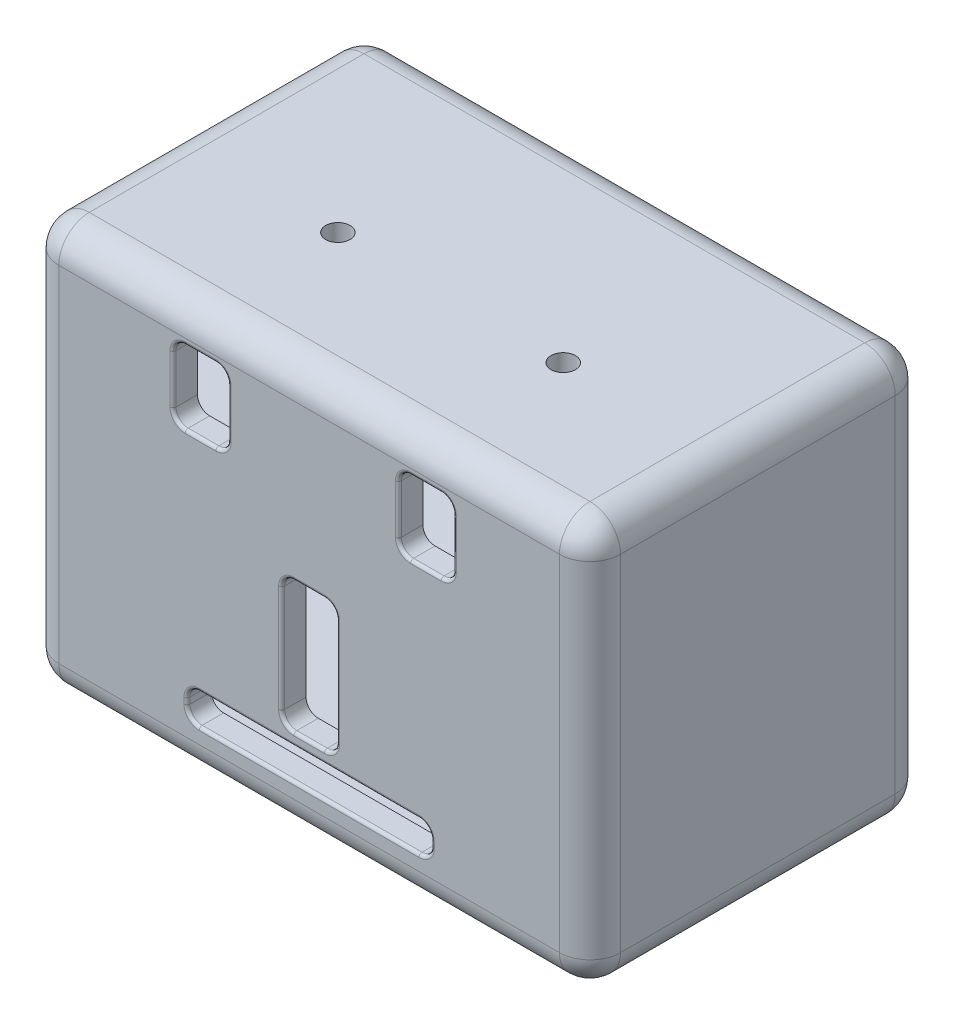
ISO-10303-21;
HEADER;
FILE_DESCRIPTION(('STEP AP214'),'2;1');
FILE_NAME('part.step','',(''),(''),'','','');
FILE_SCHEMA(('AUTOMOTIVE_DESIGN { 1 0 10303 214 1 1 1 1 }'));
ENDSEC;
DATA;
#1=APPLICATION_CONTEXT('core data for automotive mechanical design processes');
#2=APPLICATION_PROTOCOL_DEFINITION('international standard','automotive_design',2000,#1);
#3=PRODUCT_CONTEXT('',#1,'mechanical');
#4=PRODUCT('Part','Part','',(#3));
#5=PRODUCT_RELATED_PRODUCT_CATEGORY('part','',(#4));
#6=PRODUCT_DEFINITION_FORMATION('','',#4);
#7=PRODUCT_DEFINITION_CONTEXT('part definition',#1,'design');
#8=PRODUCT_DEFINITION('design','',#6,#7);
#9=PRODUCT_DEFINITION_SHAPE('','',#8);
#10=(LENGTH_UNIT() NAMED_UNIT(*) SI_UNIT(.MILLI.,.METRE.));
#11=(NAMED_UNIT(*) PLANE_ANGLE_UNIT() SI_UNIT($,.RADIAN.));
#12=(NAMED_UNIT(*) SI_UNIT($,.STERADIAN.) SOLID_ANGLE_UNIT());
#13=UNCERTAINTY_MEASURE_WITH_UNIT(LENGTH_MEASURE(1.E-05),#10,'distance_accuracy_value','');
#14=(GEOMETRIC_REPRESENTATION_CONTEXT(3) GLOBAL_UNCERTAINTY_ASSIGNED_CONTEXT((#13)) GLOBAL_UNIT_ASSIGNED_CONTEXT((#10,
#11,#12)) REPRESENTATION_CONTEXT('',''));
#15=CARTESIAN_POINT('',(0.,0.,0.));
#16=DIRECTION('',(0.,0.,1.));
#17=DIRECTION('',(1.,0.,0.));
#18=AXIS2_PLACEMENT_3D('',#15,#16,#17);
#19=CARTESIAN_POINT('',(-42.,-145.686752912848,27.5));
#20=DIRECTION('',(1.,0.,0.));
#21=DIRECTION('',(0.,0.,-1.));
#22=AXIS2_PLACEMENT_3D('',#19,#20,#21);
#23=PLANE('',#22);
#24=DIRECTION('',(0.,0.,-1.));
#25=VECTOR('',#24,1.);
#26=CARTESIAN_POINT('',(-42.,-34.5,27.5));
#27=LINE('',#26,#25);
#28=CARTESIAN_POINT('',(-42.,-34.5,23.5));
#29=VERTEX_POINT('',#28);
#30=CARTESIAN_POINT('',(-42.,-34.5,-4.81817631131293));
#31=VERTEX_POINT('',#30);
#32=EDGE_CURVE('E692',#29,#31,#27,.T.);
#33=ORIENTED_EDGE('',*,*,#32,.T.);
#34=DIRECTION('',(0.,-1.,0.));
#35=VECTOR('',#34,1.);
#36=CARTESIAN_POINT('',(-42.,-26.5,-4.81817631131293));
#37=LINE('',#36,#35);
#38=CARTESIAN_POINT('',(-42.,-26.5,-4.81817631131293));
#39=VERTEX_POINT('',#38);
#40=EDGE_CURVE('E554',#39,#31,#37,.T.);
#41=ORIENTED_EDGE('',*,*,#40,.F.);
#42=DIRECTION('',(0.,0.,1.));
#43=VECTOR('',#42,1.);
#44=CARTESIAN_POINT('',(-42.,-26.5,-10.8181763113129));
#45=LINE('',#44,#43);
#46=CARTESIAN_POINT('',(-42.,-26.5,-10.8181763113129));
#47=VERTEX_POINT('',#46);
#48=EDGE_CURVE('E543',#47,#39,#45,.T.);
#49=ORIENTED_EDGE('',*,*,#48,.F.);
#50=DIRECTION('',(0.,-1.,0.));
#51=VECTOR('',#50,1.);
#52=CARTESIAN_POINT('',(-42.,-26.5,-10.8181763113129));
#53=LINE('',#52,#51);
#54=CARTESIAN_POINT('',(-42.,-34.5,-10.8181763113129));
#55=VERTEX_POINT('',#54);
#56=EDGE_CURVE('E562',#47,#55,#53,.T.);
#57=ORIENTED_EDGE('',*,*,#56,.T.);
#58=CARTESIAN_POINT('',(-42.,-34.5,-23.5));
#59=VERTEX_POINT('',#58);
#60=EDGE_CURVE('E679',#55,#59,#27,.T.);
#61=ORIENTED_EDGE('',*,*,#60,.T.);
#62=DIRECTION('',(0.,1.,0.));
#63=VECTOR('',#62,1.);
#64=CARTESIAN_POINT('',(-42.,-145.686752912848,-23.5));
#65=LINE('',#64,#63);
#66=CARTESIAN_POINT('',(-42.,0.,-23.5));
#67=VERTEX_POINT('',#66);
#68=EDGE_CURVE('E712',#59,#67,#65,.T.);
#69=ORIENTED_EDGE('',*,*,#68,.T.);
#70=DIRECTION('',(0.,0.,-1.));
#71=VECTOR('',#70,1.);
#72=CARTESIAN_POINT('',(-42.,0.,27.5));
#73=LINE('',#72,#71);
#74=CARTESIAN_POINT('',(-42.,0.,23.5));
#75=VERTEX_POINT('',#74);
#76=EDGE_CURVE('E705',#75,#67,#73,.T.);
#77=ORIENTED_EDGE('',*,*,#76,.F.);
#78=DIRECTION('',(0.,1.,0.));
#79=VECTOR('',#78,1.);
#80=CARTESIAN_POINT('',(-42.,-145.686752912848,23.5));
#81=LINE('',#80,#79);
#82=EDGE_CURVE('E715',#29,#75,#81,.T.);
#83=ORIENTED_EDGE('',*,*,#82,.F.);
#84=EDGE_LOOP('',(#33,#41,#49,#57,#61,#69,#77,#83));
#85=FACE_BOUND('',#84,.T.);
#86=ADVANCED_FACE('F36',(#85),#23,.T.);
#87=CARTESIAN_POINT('',(0.,-34.5,0.));
#88=DIRECTION('',(0.,-1.,0.));
#89=DIRECTION('',(0.,0.,-1.));
#90=AXIS2_PLACEMENT_3D('',#87,#88,#89);
#91=PLANE('',#90);
#92=CARTESIAN_POINT('',(0.,-34.5,2.5));
#93=DIRECTION('',(0.,-1.,0.));
#94=DIRECTION('',(0.,0.,-1.));
#95=AXIS2_PLACEMENT_3D('',#92,#93,#94);
#96=CIRCLE('',#95,12.);
#97=CARTESIAN_POINT('',(0.,-34.5,-9.5));
#98=VERTEX_POINT('',#97);
#99=EDGE_CURVE('E874',#98,#98,#96,.F.);
#100=ORIENTED_EDGE('',*,*,#99,.F.);
#101=EDGE_LOOP('',(#100));
#102=FACE_BOUND('',#101,.T.);
#103=CARTESIAN_POINT('',(-31.2165063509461,-34.5,7.18182368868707));
#104=DIRECTION('',(0.,-1.,0.));
#105=DIRECTION('',(0.,0.,-1.));
#106=AXIS2_PLACEMENT_3D('',#103,#104,#105);
#107=CIRCLE('',#106,1.5);
#108=CARTESIAN_POINT('',(-31.2165063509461,-34.5,5.68182368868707));
#109=VERTEX_POINT('',#108);
#110=EDGE_CURVE('E1055',#109,#109,#107,.F.);
#111=ORIENTED_EDGE('',*,*,#110,.F.);
#112=EDGE_LOOP('',(#111));
#113=FACE_BOUND('',#112,.T.);
#114=DIRECTION('',(1.,0.,0.));
#115=VECTOR('',#114,1.);
#116=CARTESIAN_POINT('',(-42.,-34.5,-4.81817631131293));
#117=LINE('',#116,#115);
#118=CARTESIAN_POINT('',(-36.,-34.5,-4.81817631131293));
#119=VERTEX_POINT('',#118);
#120=EDGE_CURVE('E551',#31,#119,#117,.T.);
#121=ORIENTED_EDGE('',*,*,#120,.F.);
#122=ORIENTED_EDGE('',*,*,#32,.F.);
#123=DIRECTION('',(-1.,0.,0.));
#124=VECTOR('',#123,1.);
#125=CARTESIAN_POINT('',(46.,-34.5,23.5));
#126=LINE('',#125,#124);
#127=CARTESIAN_POINT('',(42.,-34.5,23.5));
#128=VERTEX_POINT('',#127);
#129=EDGE_CURVE('E695',#128,#29,#126,.T.);
#130=ORIENTED_EDGE('',*,*,#129,.F.);
#131=DIRECTION('',(0.,0.,1.));
#132=VECTOR('',#131,1.);
#133=CARTESIAN_POINT('',(42.,-34.5,-27.5));
#134=LINE('',#133,#132);
#135=CARTESIAN_POINT('',(42.,-34.5,-23.5));
#136=VERTEX_POINT('',#135);
#137=EDGE_CURVE('E698',#136,#128,#134,.T.);
#138=ORIENTED_EDGE('',*,*,#137,.F.);
#139=DIRECTION('',(1.,0.,0.));
#140=VECTOR('',#139,1.);
#141=CARTESIAN_POINT('',(-46.,-34.5,-23.5));
#142=LINE('',#141,#140);
#143=EDGE_CURVE('E721',#59,#136,#142,.T.);
#144=ORIENTED_EDGE('',*,*,#143,.F.);
#145=ORIENTED_EDGE('',*,*,#60,.F.);
#146=DIRECTION('',(-1.,0.,0.));
#147=VECTOR('',#146,1.);
#148=CARTESIAN_POINT('',(-42.,-34.5,-10.8181763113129));
#149=LINE('',#148,#147);
#150=CARTESIAN_POINT('',(-36.,-34.5,-10.8181763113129));
#151=VERTEX_POINT('',#150);
#152=EDGE_CURVE('E570',#151,#55,#149,.T.);
#153=ORIENTED_EDGE('',*,*,#152,.F.);
#154=DIRECTION('',(0.,0.,-1.));
#155=VECTOR('',#154,1.);
#156=CARTESIAN_POINT('',(-36.,-34.5,-10.8181763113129));
#157=LINE('',#156,#155);
#158=EDGE_CURVE('E567',#119,#151,#157,.T.);
#159=ORIENTED_EDGE('',*,*,#158,.F.);
#160=EDGE_LOOP('',(#121,#122,#130,#138,#144,#145,#153,#159));
#161=FACE_BOUND('',#160,.T.);
#162=ADVANCED_FACE('F1341',(#102,#113,#161),#91,.F.);
#163=CARTESIAN_POINT('',(0.,4.,0.));
#164=DIRECTION('',(0.,-1.,0.));
#165=DIRECTION('',(0.,0.,-1.));
#166=AXIS2_PLACEMENT_3D('',#163,#164,#165);
#167=PLANE('',#166);
#168=CARTESIAN_POINT('',(-17.7867965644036,4.,5.));
#169=DIRECTION('',(0.,-1.,0.));
#170=DIRECTION('',(0.,0.,-1.));
#171=AXIS2_PLACEMENT_3D('',#168,#169,#170);
#172=CIRCLE('',#171,2.);
#173=CARTESIAN_POINT('',(-17.7867965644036,4.,3.));
#174=VERTEX_POINT('',#173);
#175=EDGE_CURVE('E646',#174,#174,#172,.T.);
#176=ORIENTED_EDGE('',*,*,#175,.T.);
#177=EDGE_LOOP('',(#176));
#178=FACE_BOUND('',#177,.T.);
#179=CARTESIAN_POINT('',(19.1262045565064,4.,5.));
#180=DIRECTION('',(0.,-1.,0.));
#181=DIRECTION('',(0.,0.,-1.));
#182=AXIS2_PLACEMENT_3D('',#179,#180,#181);
#183=CIRCLE('',#182,2.);
#184=CARTESIAN_POINT('',(19.1262045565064,4.,3.));
#185=VERTEX_POINT('',#184);
#186=EDGE_CURVE('E650',#185,#185,#183,.T.);
#187=ORIENTED_EDGE('',*,*,#186,.T.);
#188=EDGE_LOOP('',(#187));
#189=FACE_BOUND('',#188,.T.);
#190=CARTESIAN_POINT('',(-37.5,4.,-18.25));
#191=DIRECTION('',(0.,-1.,0.));
#192=DIRECTION('',(0.,0.,-1.));
#193=AXIS2_PLACEMENT_3D('',#190,#191,#192);
#194=CIRCLE('',#193,1.5);
#195=CARTESIAN_POINT('',(-37.5,4.,-19.75));
#196=VERTEX_POINT('',#195);
#197=EDGE_CURVE('E811',#196,#196,#194,.F.);
#198=ORIENTED_EDGE('',*,*,#197,.F.);
#199=EDGE_LOOP('',(#198));
#200=FACE_BOUND('',#199,.T.);
#201=CARTESIAN_POINT('',(0.752409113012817,4.,-18.25));
#202=DIRECTION('',(0.,-1.,0.));
#203=DIRECTION('',(0.,0.,-1.));
#204=AXIS2_PLACEMENT_3D('',#201,#202,#203);
#205=CIRCLE('',#204,1.5);
#206=CARTESIAN_POINT('',(0.752409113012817,4.,-19.75));
#207=VERTEX_POINT('',#206);
#208=EDGE_CURVE('E808',#207,#207,#205,.F.);
#209=ORIENTED_EDGE('',*,*,#208,.F.);
#210=EDGE_LOOP('',(#209));
#211=FACE_BOUND('',#210,.T.);
#212=DIRECTION('',(0.,0.,1.));
#213=VECTOR('',#212,1.);
#214=CARTESIAN_POINT('',(13.1262045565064,4.,-23.5));
#215=LINE('',#214,#213);
#216=CARTESIAN_POINT('',(13.1262045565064,4.,-23.5));
#217=VERTEX_POINT('',#216);
#218=CARTESIAN_POINT('',(13.1262045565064,4.,-17.5));
#219=VERTEX_POINT('',#218);
#220=EDGE_CURVE('E577',#217,#219,#215,.T.);
#221=ORIENTED_EDGE('',*,*,#220,.F.);
#222=DIRECTION('',(-1.,0.,0.));
#223=VECTOR('',#222,1.);
#224=CARTESIAN_POINT('',(46.,4.,-23.5));
#225=LINE('',#224,#223);
#226=CARTESIAN_POINT('',(-17.7867965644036,4.,-23.5));
#227=VERTEX_POINT('',#226);
#228=EDGE_CURVE('E782',#217,#227,#225,.T.);
#229=ORIENTED_EDGE('',*,*,#228,.T.);
#230=DIRECTION('',(0.,0.,-1.));
#231=VECTOR('',#230,1.);
#232=CARTESIAN_POINT('',(-17.7867965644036,4.,-23.5));
#233=LINE('',#232,#231);
#234=CARTESIAN_POINT('',(-17.7867965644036,4.,-17.5));
#235=VERTEX_POINT('',#234);
#236=EDGE_CURVE('E613',#235,#227,#233,.T.);
#237=ORIENTED_EDGE('',*,*,#236,.F.);
#238=DIRECTION('',(1.,0.,0.));
#239=VECTOR('',#238,1.);
#240=CARTESIAN_POINT('',(-23.7867965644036,4.,-17.5));
#241=LINE('',#240,#239);
#242=CARTESIAN_POINT('',(-23.7867965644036,4.,-17.5));
#243=VERTEX_POINT('',#242);
#244=EDGE_CURVE('E624',#243,#235,#241,.T.);
#245=ORIENTED_EDGE('',*,*,#244,.F.);
#246=DIRECTION('',(0.,0.,1.));
#247=VECTOR('',#246,1.);
#248=CARTESIAN_POINT('',(-23.7867965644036,4.,-23.5));
#249=LINE('',#248,#247);
#250=CARTESIAN_POINT('',(-23.7867965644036,4.,-23.5));
#251=VERTEX_POINT('',#250);
#252=EDGE_CURVE('E608',#251,#243,#249,.T.);
#253=ORIENTED_EDGE('',*,*,#252,.F.);
#254=CARTESIAN_POINT('',(-42.,4.,-23.5));
#255=VERTEX_POINT('',#254);
#256=EDGE_CURVE('E777',#251,#255,#225,.T.);
#257=ORIENTED_EDGE('',*,*,#256,.T.);
#258=DIRECTION('',(0.,0.,1.));
#259=VECTOR('',#258,1.);
#260=CARTESIAN_POINT('',(-42.,4.,-27.5));
#261=LINE('',#260,#259);
#262=CARTESIAN_POINT('',(-42.,4.,23.5));
#263=VERTEX_POINT('',#262);
#264=EDGE_CURVE('E781',#255,#263,#261,.T.);
#265=ORIENTED_EDGE('',*,*,#264,.T.);
#266=DIRECTION('',(1.,0.,0.));
#267=VECTOR('',#266,1.);
#268=CARTESIAN_POINT('',(-46.,4.,23.5));
#269=LINE('',#268,#267);
#270=CARTESIAN_POINT('',(42.,4.,23.5));
#271=VERTEX_POINT('',#270);
#272=EDGE_CURVE('E765',#263,#271,#269,.T.);
#273=ORIENTED_EDGE('',*,*,#272,.T.);
#274=DIRECTION('',(0.,0.,-1.));
#275=VECTOR('',#274,1.);
#276=CARTESIAN_POINT('',(42.,4.,27.5));
#277=LINE('',#276,#275);
#278=CARTESIAN_POINT('',(42.,4.,-23.5));
#279=VERTEX_POINT('',#278);
#280=EDGE_CURVE('E758',#271,#279,#277,.T.);
#281=ORIENTED_EDGE('',*,*,#280,.T.);
#282=CARTESIAN_POINT('',(19.1262045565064,4.,-23.5));
#283=VERTEX_POINT('',#282);
#284=EDGE_CURVE('E778',#279,#283,#225,.T.);
#285=ORIENTED_EDGE('',*,*,#284,.T.);
#286=DIRECTION('',(0.,0.,-1.));
#287=VECTOR('',#286,1.);
#288=CARTESIAN_POINT('',(19.1262045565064,4.,-23.5));
#289=LINE('',#288,#287);
#290=CARTESIAN_POINT('',(19.1262045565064,4.,-17.5));
#291=VERTEX_POINT('',#290);
#292=EDGE_CURVE('E582',#291,#283,#289,.T.);
#293=ORIENTED_EDGE('',*,*,#292,.F.);
#294=DIRECTION('',(1.,0.,0.));
#295=VECTOR('',#294,1.);
#296=CARTESIAN_POINT('',(13.1262045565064,4.,-17.5));
#297=LINE('',#296,#295);
#298=EDGE_CURVE('E593',#219,#291,#297,.T.);
#299=ORIENTED_EDGE('',*,*,#298,.F.);
#300=EDGE_LOOP('',(#221,#229,#237,#245,#253,#257,#265,#273,#281,#285,#293,#299));
#301=FACE_BOUND('',#300,.T.);
#302=ADVANCED_FACE('F1347',(#178,#189,#200,#211,#301),#167,.F.);
#303=CARTESIAN_POINT('',(46.,24.,-23.5));
#304=DIRECTION('',(0.,0.,1.));
#305=DIRECTION('',(1.,0.,0.));
#306=AXIS2_PLACEMENT_3D('',#303,#304,#305);
#307=PLANE('',#306);
#308=ORIENTED_EDGE('',*,*,#228,.F.);
#309=DIRECTION('',(0.,-1.,0.));
#310=VECTOR('',#309,1.);
#311=CARTESIAN_POINT('',(13.1262045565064,8.,-23.5));
#312=LINE('',#311,#310);
#313=CARTESIAN_POINT('',(13.1262045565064,8.,-23.5));
#314=VERTEX_POINT('',#313);
#315=EDGE_CURVE('E590',#314,#217,#312,.T.);
#316=ORIENTED_EDGE('',*,*,#315,.F.);
#317=DIRECTION('',(-1.,0.,0.));
#318=VECTOR('',#317,1.);
#319=CARTESIAN_POINT('',(13.1262045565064,8.,-23.5));
#320=LINE('',#319,#318);
#321=CARTESIAN_POINT('',(19.1262045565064,8.,-23.5));
#322=VERTEX_POINT('',#321);
#323=EDGE_CURVE('E587',#322,#314,#320,.T.);
#324=ORIENTED_EDGE('',*,*,#323,.F.);
#325=DIRECTION('',(0.,-1.,0.));
#326=VECTOR('',#325,1.);
#327=CARTESIAN_POINT('',(19.1262045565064,8.,-23.5));
#328=LINE('',#327,#326);
#329=EDGE_CURVE('E600',#322,#283,#328,.T.);
#330=ORIENTED_EDGE('',*,*,#329,.T.);
#331=ORIENTED_EDGE('',*,*,#284,.F.);
#332=DIRECTION('',(0.,-1.,0.));
#333=VECTOR('',#332,1.);
#334=CARTESIAN_POINT('',(42.,24.,-23.5));
#335=LINE('',#334,#333);
#336=CARTESIAN_POINT('',(42.,24.,-23.5));
#337=VERTEX_POINT('',#336);
#338=EDGE_CURVE('E793',#337,#279,#335,.T.);
#339=ORIENTED_EDGE('',*,*,#338,.F.);
#340=DIRECTION('',(-1.,0.,0.));
#341=VECTOR('',#340,1.);
#342=CARTESIAN_POINT('',(46.,24.,-23.5));
#343=LINE('',#342,#341);
#344=CARTESIAN_POINT('',(-42.,24.,-23.5));
#345=VERTEX_POINT('',#344);
#346=EDGE_CURVE('E764',#337,#345,#343,.T.);
#347=ORIENTED_EDGE('',*,*,#346,.T.);
#348=DIRECTION('',(0.,-1.,0.));
#349=VECTOR('',#348,1.);
#350=CARTESIAN_POINT('',(-42.,24.,-23.5));
#351=LINE('',#350,#349);
#352=EDGE_CURVE('E790',#345,#255,#351,.T.);
#353=ORIENTED_EDGE('',*,*,#352,.T.);
#354=ORIENTED_EDGE('',*,*,#256,.F.);
#355=DIRECTION('',(0.,-1.,0.));
#356=VECTOR('',#355,1.);
#357=CARTESIAN_POINT('',(-23.7867965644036,8.,-23.5));
#358=LINE('',#357,#356);
#359=CARTESIAN_POINT('',(-23.7867965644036,8.,-23.5));
#360=VERTEX_POINT('',#359);
#361=EDGE_CURVE('E621',#360,#251,#358,.T.);
#362=ORIENTED_EDGE('',*,*,#361,.F.);
#363=DIRECTION('',(-1.,0.,0.));
#364=VECTOR('',#363,1.);
#365=CARTESIAN_POINT('',(-23.7867965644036,8.,-23.5));
#366=LINE('',#365,#364);
#367=CARTESIAN_POINT('',(-17.7867965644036,8.,-23.5));
#368=VERTEX_POINT('',#367);
#369=EDGE_CURVE('E618',#368,#360,#366,.T.);
#370=ORIENTED_EDGE('',*,*,#369,.F.);
#371=DIRECTION('',(0.,-1.,0.));
#372=VECTOR('',#371,1.);
#373=CARTESIAN_POINT('',(-17.7867965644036,8.,-23.5));
#374=LINE('',#373,#372);
#375=EDGE_CURVE('E631',#368,#227,#374,.T.);
#376=ORIENTED_EDGE('',*,*,#375,.T.);
#377=EDGE_LOOP('',(#308,#316,#324,#330,#331,#339,#347,#353,#354,#362,#370,#376));
#378=FACE_BOUND('',#377,.T.);
#379=ADVANCED_FACE('F1415',(#378),#307,.T.);
#380=CARTESIAN_POINT('',(0.752409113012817,8.,-18.25));
#381=DIRECTION('',(0.,-1.,0.));
#382=DIRECTION('',(0.,0.,-1.));
#383=AXIS2_PLACEMENT_3D('',#380,#381,#382);
#384=CYLINDRICAL_SURFACE('',#383,1.5);
#385=CARTESIAN_POINT('',(0.752409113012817,8.,-18.25));
#386=DIRECTION('',(0.,1.,0.));
#387=DIRECTION('',(0.,0.,1.));
#388=AXIS2_PLACEMENT_3D('',#385,#386,#387);
#389=CIRCLE('',#388,1.5);
#390=CARTESIAN_POINT('',(0.752409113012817,8.,-16.75));
#391=VERTEX_POINT('',#390);
#392=EDGE_CURVE('E805',#391,#391,#389,.T.);
#393=ORIENTED_EDGE('',*,*,#392,.F.);
#394=EDGE_LOOP('',(#393));
#395=FACE_BOUND('',#394,.T.);
#396=ORIENTED_EDGE('',*,*,#208,.T.);
#397=EDGE_LOOP('',(#396));
#398=FACE_BOUND('',#397,.T.);
#399=ADVANCED_FACE('F1418',(#395,#398),#384,.T.);
#400=CARTESIAN_POINT('',(-37.5,8.,-18.25));
#401=DIRECTION('',(0.,-1.,0.));
#402=DIRECTION('',(0.,0.,-1.));
#403=AXIS2_PLACEMENT_3D('',#400,#401,#402);
#404=CYLINDRICAL_SURFACE('',#403,1.5);
#405=CARTESIAN_POINT('',(-37.5,8.,-18.25));
#406=DIRECTION('',(0.,1.,0.));
#407=DIRECTION('',(0.,0.,1.));
#408=AXIS2_PLACEMENT_3D('',#405,#406,#407);
#409=CIRCLE('',#408,1.5);
#410=CARTESIAN_POINT('',(-37.5,8.,-16.75));
#411=VERTEX_POINT('',#410);
#412=EDGE_CURVE('E802',#411,#411,#409,.T.);
#413=ORIENTED_EDGE('',*,*,#412,.F.);
#414=EDGE_LOOP('',(#413));
#415=FACE_BOUND('',#414,.T.);
#416=ORIENTED_EDGE('',*,*,#197,.T.);
#417=EDGE_LOOP('',(#416));
#418=FACE_BOUND('',#417,.T.);
#419=ADVANCED_FACE('F1445',(#415,#418),#404,.T.);
#420=CARTESIAN_POINT('',(-37.5,10.,-18.25));
#421=DIRECTION('',(0.,1.,0.));
#422=DIRECTION('',(0.,0.,1.));
#423=AXIS2_PLACEMENT_3D('',#420,#421,#422);
#424=PLANE('',#423);
#425=CARTESIAN_POINT('',(-37.5,10.,-18.25));
#426=DIRECTION('',(0.,1.,0.));
#427=DIRECTION('',(0.,0.,1.));
#428=AXIS2_PLACEMENT_3D('',#425,#426,#427);
#429=CIRCLE('',#428,0.500000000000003);
#430=CARTESIAN_POINT('',(-37.5,10.,-17.75));
#431=VERTEX_POINT('',#430);
#432=EDGE_CURVE('E817',#431,#431,#429,.T.);
#433=ORIENTED_EDGE('',*,*,#432,.T.);
#434=EDGE_LOOP('',(#433));
#435=FACE_BOUND('',#434,.T.);
#436=ADVANCED_FACE('F1442',(#435),#424,.T.);
#437=CARTESIAN_POINT('',(-37.5,8.,-18.25));
#438=DIRECTION('',(0.,1.,0.));
#439=DIRECTION('',(0.,0.,1.));
#440=AXIS2_PLACEMENT_3D('',#437,#438,#439);
#441=PLANE('',#440);
#442=ORIENTED_EDGE('',*,*,#412,.T.);
#443=EDGE_LOOP('',(#442));
#444=FACE_BOUND('',#443,.T.);
#445=CARTESIAN_POINT('',(-37.5,8.,-18.25));
#446=DIRECTION('',(0.,1.,0.));
#447=DIRECTION('',(0.,0.,1.));
#448=AXIS2_PLACEMENT_3D('',#445,#446,#447);
#449=CIRCLE('',#448,2.5);
#450=CARTESIAN_POINT('',(-37.5,8.,-15.75));
#451=VERTEX_POINT('',#450);
#452=EDGE_CURVE('E799',#451,#451,#449,.T.);
#453=ORIENTED_EDGE('',*,*,#452,.F.);
#454=EDGE_LOOP('',(#453));
#455=FACE_BOUND('',#454,.T.);
#456=ADVANCED_FACE('F1436',(#444,#455),#441,.F.);
#457=CARTESIAN_POINT('',(0.752409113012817,10.,-18.25));
#458=DIRECTION('',(0.,1.,0.));
#459=DIRECTION('',(0.,0.,1.));
#460=AXIS2_PLACEMENT_3D('',#457,#458,#459);
#461=PLANE('',#460);
#462=CARTESIAN_POINT('',(0.752409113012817,10.,-18.25));
#463=DIRECTION('',(0.,1.,0.));
#464=DIRECTION('',(0.,0.,1.));
#465=AXIS2_PLACEMENT_3D('',#462,#463,#464);
#466=CIRCLE('',#465,0.500000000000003);
#467=CARTESIAN_POINT('',(0.752409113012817,10.,-17.75));
#468=VERTEX_POINT('',#467);
#469=EDGE_CURVE('E814',#468,#468,#466,.T.);
#470=ORIENTED_EDGE('',*,*,#469,.T.);
#471=EDGE_LOOP('',(#470));
#472=FACE_BOUND('',#471,.T.);
#473=ADVANCED_FACE('F1432',(#472),#461,.T.);
#474=CARTESIAN_POINT('',(0.752409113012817,8.,-18.25));
#475=DIRECTION('',(0.,1.,0.));
#476=DIRECTION('',(0.,0.,1.));
#477=AXIS2_PLACEMENT_3D('',#474,#475,#476);
#478=PLANE('',#477);
#479=ORIENTED_EDGE('',*,*,#392,.T.);
#480=EDGE_LOOP('',(#479));
#481=FACE_BOUND('',#480,.T.);
#482=CARTESIAN_POINT('',(0.752409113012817,8.,-18.25));
#483=DIRECTION('',(0.,1.,0.));
#484=DIRECTION('',(0.,0.,1.));
#485=AXIS2_PLACEMENT_3D('',#482,#483,#484);
#486=CIRCLE('',#485,2.5);
#487=CARTESIAN_POINT('',(0.752409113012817,8.,-15.75));
#488=VERTEX_POINT('',#487);
#489=EDGE_CURVE('E796',#488,#488,#486,.T.);
#490=ORIENTED_EDGE('',*,*,#489,.F.);
#491=EDGE_LOOP('',(#490));
#492=FACE_BOUND('',#491,.T.);
#493=ADVANCED_FACE('F1435',(#481,#492),#478,.F.);
#494=CARTESIAN_POINT('',(0.752409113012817,8.,-18.25));
#495=DIRECTION('',(0.,1.,0.));
#496=DIRECTION('',(0.,0.,1.));
#497=AXIS2_PLACEMENT_3D('',#494,#495,#496);
#498=DEGENERATE_TOROIDAL_SURFACE('',#497,0.500000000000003,2.,.T.);
#499=ORIENTED_EDGE('',*,*,#489,.T.);
#500=EDGE_LOOP('',(#499));
#501=FACE_BOUND('',#500,.T.);
#502=ORIENTED_EDGE('',*,*,#469,.F.);
#503=EDGE_LOOP('',(#502));
#504=FACE_BOUND('',#503,.T.);
#505=ADVANCED_FACE('F1440',(#501,#504),#498,.T.);
#506=CARTESIAN_POINT('',(-37.5,8.,-18.25));
#507=DIRECTION('',(0.,1.,0.));
#508=DIRECTION('',(0.,0.,1.));
#509=AXIS2_PLACEMENT_3D('',#506,#507,#508);
#510=DEGENERATE_TOROIDAL_SURFACE('',#509,0.500000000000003,2.,.T.);
#511=ORIENTED_EDGE('',*,*,#452,.T.);
#512=EDGE_LOOP('',(#511));
#513=FACE_BOUND('',#512,.T.);
#514=ORIENTED_EDGE('',*,*,#432,.F.);
#515=EDGE_LOOP('',(#514));
#516=FACE_BOUND('',#515,.T.);
#517=ADVANCED_FACE('F1422',(#513,#516),#510,.T.);
#518=CARTESIAN_POINT('',(42.,24.,27.5));
#519=DIRECTION('',(-1.,0.,0.));
#520=DIRECTION('',(0.,0.,1.));
#521=AXIS2_PLACEMENT_3D('',#518,#519,#520);
#522=PLANE('',#521);
#523=ORIENTED_EDGE('',*,*,#280,.F.);
#524=DIRECTION('',(0.,-1.,0.));
#525=VECTOR('',#524,1.);
#526=CARTESIAN_POINT('',(42.,24.,23.5));
#527=LINE('',#526,#525);
#528=CARTESIAN_POINT('',(42.,24.,23.5));
#529=VERTEX_POINT('',#528);
#530=EDGE_CURVE('E774',#529,#271,#527,.T.);
#531=ORIENTED_EDGE('',*,*,#530,.F.);
#532=DIRECTION('',(0.,0.,-1.));
#533=VECTOR('',#532,1.);
#534=CARTESIAN_POINT('',(42.,24.,27.5));
#535=LINE('',#534,#533);
#536=EDGE_CURVE('E761',#529,#337,#535,.T.);
#537=ORIENTED_EDGE('',*,*,#536,.T.);
#538=ORIENTED_EDGE('',*,*,#338,.T.);
#539=EDGE_LOOP('',(#523,#531,#537,#538));
#540=FACE_BOUND('',#539,.T.);
#541=ADVANCED_FACE('F1413',(#540),#522,.T.);
#542=CARTESIAN_POINT('',(-42.,24.,-27.5));
#543=DIRECTION('',(1.,0.,0.));
#544=DIRECTION('',(0.,0.,-1.));
#545=AXIS2_PLACEMENT_3D('',#542,#543,#544);
#546=PLANE('',#545);
#547=ORIENTED_EDGE('',*,*,#264,.F.);
#548=ORIENTED_EDGE('',*,*,#352,.F.);
#549=DIRECTION('',(0.,0.,1.));
#550=VECTOR('',#549,1.);
#551=CARTESIAN_POINT('',(-42.,24.,-27.5));
#552=LINE('',#551,#550);
#553=CARTESIAN_POINT('',(-42.,24.,23.5));
#554=VERTEX_POINT('',#553);
#555=EDGE_CURVE('E768',#345,#554,#552,.T.);
#556=ORIENTED_EDGE('',*,*,#555,.T.);
#557=DIRECTION('',(0.,-1.,0.));
#558=VECTOR('',#557,1.);
#559=CARTESIAN_POINT('',(-42.,24.,23.5));
#560=LINE('',#559,#558);
#561=EDGE_CURVE('E788',#554,#263,#560,.T.);
#562=ORIENTED_EDGE('',*,*,#561,.T.);
#563=EDGE_LOOP('',(#547,#548,#556,#562));
#564=FACE_BOUND('',#563,.T.);
#565=ADVANCED_FACE('F1409',(#564),#546,.T.);
#566=CARTESIAN_POINT('',(-46.,24.,23.5));
#567=DIRECTION('',(0.,0.,-1.));
#568=DIRECTION('',(-1.,0.,0.));
#569=AXIS2_PLACEMENT_3D('',#566,#567,#568);
#570=PLANE('',#569);
#571=DIRECTION('',(-1.,0.,0.));
#572=VECTOR('',#571,1.);
#573=CARTESIAN_POINT('',(14.6262045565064,22.,23.5));
#574=LINE('',#573,#572);
#575=CARTESIAN_POINT('',(21.6262045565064,22.,23.5));
#576=VERTEX_POINT('',#575);
#577=CARTESIAN_POINT('',(16.6262045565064,22.,23.5));
#578=VERTEX_POINT('',#577);
#579=EDGE_CURVE('E735',#576,#578,#574,.T.);
#580=ORIENTED_EDGE('',*,*,#579,.T.);
#581=CARTESIAN_POINT('',(16.6262045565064,20.,23.5));
#582=DIRECTION('',(0.,0.,-1.));
#583=DIRECTION('',(-1.,0.,0.));
#584=AXIS2_PLACEMENT_3D('',#581,#582,#583);
#585=CIRCLE('',#584,2.);
#586=CARTESIAN_POINT('',(14.6262045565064,20.,23.5));
#587=VERTEX_POINT('',#586);
#588=EDGE_CURVE('E1027',#578,#587,#585,.F.);
#589=ORIENTED_EDGE('',*,*,#588,.T.);
#590=DIRECTION('',(0.,-1.,0.));
#591=VECTOR('',#590,1.);
#592=CARTESIAN_POINT('',(14.6262045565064,22.,23.5));
#593=LINE('',#592,#591);
#594=CARTESIAN_POINT('',(14.6262045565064,12.,23.5));
#595=VERTEX_POINT('',#594);
#596=EDGE_CURVE('E725',#587,#595,#593,.T.);
#597=ORIENTED_EDGE('',*,*,#596,.T.);
#598=CARTESIAN_POINT('',(16.6262045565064,12.,23.5));
#599=DIRECTION('',(0.,0.,-1.));
#600=DIRECTION('',(-1.,0.,0.));
#601=AXIS2_PLACEMENT_3D('',#598,#599,#600);
#602=CIRCLE('',#601,2.);
#603=CARTESIAN_POINT('',(16.6262045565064,10.,23.5));
#604=VERTEX_POINT('',#603);
#605=EDGE_CURVE('E1029',#595,#604,#602,.F.);
#606=ORIENTED_EDGE('',*,*,#605,.T.);
#607=DIRECTION('',(1.,0.,0.));
#608=VECTOR('',#607,1.);
#609=CARTESIAN_POINT('',(14.6262045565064,10.,23.5));
#610=LINE('',#609,#608);
#611=CARTESIAN_POINT('',(21.6262045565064,10.,23.5));
#612=VERTEX_POINT('',#611);
#613=EDGE_CURVE('E728',#604,#612,#610,.T.);
#614=ORIENTED_EDGE('',*,*,#613,.T.);
#615=CARTESIAN_POINT('',(21.6262045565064,12.,23.5));
#616=DIRECTION('',(0.,0.,-1.));
#617=DIRECTION('',(-1.,0.,0.));
#618=AXIS2_PLACEMENT_3D('',#615,#616,#617);
#619=CIRCLE('',#618,2.);
#620=CARTESIAN_POINT('',(23.6262045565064,12.,23.5));
#621=VERTEX_POINT('',#620);
#622=EDGE_CURVE('E1023',#612,#621,#619,.F.);
#623=ORIENTED_EDGE('',*,*,#622,.T.);
#624=DIRECTION('',(0.,1.,0.));
#625=VECTOR('',#624,1.);
#626=CARTESIAN_POINT('',(23.6262045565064,22.,23.5));
#627=LINE('',#626,#625);
#628=CARTESIAN_POINT('',(23.6262045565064,20.,23.5));
#629=VERTEX_POINT('',#628);
#630=EDGE_CURVE('E732',#621,#629,#627,.T.);
#631=ORIENTED_EDGE('',*,*,#630,.T.);
#632=CARTESIAN_POINT('',(21.6262045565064,20.,23.5));
#633=DIRECTION('',(0.,0.,-1.));
#634=DIRECTION('',(-1.,0.,0.));
#635=AXIS2_PLACEMENT_3D('',#632,#633,#634);
#636=CIRCLE('',#635,2.);
#637=EDGE_CURVE('E1025',#629,#576,#636,.F.);
#638=ORIENTED_EDGE('',*,*,#637,.T.);
#639=EDGE_LOOP('',(#580,#589,#597,#606,#614,#623,#631,#638));
#640=FACE_BOUND('',#639,.T.);
#641=DIRECTION('',(-1.,0.,0.));
#642=VECTOR('',#641,1.);
#643=CARTESIAN_POINT('',(-22.2867965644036,22.,23.5));
#644=LINE('',#643,#642);
#645=CARTESIAN_POINT('',(-15.2867965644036,22.,23.5));
#646=VERTEX_POINT('',#645);
#647=CARTESIAN_POINT('',(-20.2867965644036,22.,23.5));
#648=VERTEX_POINT('',#647);
#649=EDGE_CURVE('E729',#646,#648,#644,.T.);
#650=ORIENTED_EDGE('',*,*,#649,.T.);
#651=CARTESIAN_POINT('',(-20.2867965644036,20.,23.5));
#652=DIRECTION('',(0.,0.,-1.));
#653=DIRECTION('',(-1.,0.,0.));
#654=AXIS2_PLACEMENT_3D('',#651,#652,#653);
#655=CIRCLE('',#654,2.);
#656=CARTESIAN_POINT('',(-22.2867965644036,20.,23.5));
#657=VERTEX_POINT('',#656);
#658=EDGE_CURVE('E1035',#648,#657,#655,.F.);
#659=ORIENTED_EDGE('',*,*,#658,.T.);
#660=DIRECTION('',(0.,-1.,0.));
#661=VECTOR('',#660,1.);
#662=CARTESIAN_POINT('',(-22.2867965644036,22.,23.5));
#663=LINE('',#662,#661);
#664=CARTESIAN_POINT('',(-22.2867965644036,12.,23.5));
#665=VERTEX_POINT('',#664);
#666=EDGE_CURVE('E724',#657,#665,#663,.T.);
#667=ORIENTED_EDGE('',*,*,#666,.T.);
#668=CARTESIAN_POINT('',(-20.2867965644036,12.,23.5));
#669=DIRECTION('',(0.,0.,-1.));
#670=DIRECTION('',(-1.,0.,0.));
#671=AXIS2_PLACEMENT_3D('',#668,#669,#670);
#672=CIRCLE('',#671,2.);
#673=CARTESIAN_POINT('',(-20.2867965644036,10.,23.5));
#674=VERTEX_POINT('',#673);
#675=EDGE_CURVE('E1037',#665,#674,#672,.F.);
#676=ORIENTED_EDGE('',*,*,#675,.T.);
#677=DIRECTION('',(1.,0.,0.));
#678=VECTOR('',#677,1.);
#679=CARTESIAN_POINT('',(-22.2867965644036,10.,23.5));
#680=LINE('',#679,#678);
#681=CARTESIAN_POINT('',(-15.2867965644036,10.,23.5));
#682=VERTEX_POINT('',#681);
#683=EDGE_CURVE('E741',#674,#682,#680,.T.);
#684=ORIENTED_EDGE('',*,*,#683,.T.);
#685=CARTESIAN_POINT('',(-15.2867965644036,12.,23.5));
#686=DIRECTION('',(0.,0.,-1.));
#687=DIRECTION('',(-1.,0.,0.));
#688=AXIS2_PLACEMENT_3D('',#685,#686,#687);
#689=CIRCLE('',#688,2.);
#690=CARTESIAN_POINT('',(-13.2867965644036,12.,23.5));
#691=VERTEX_POINT('',#690);
#692=EDGE_CURVE('E1033',#682,#691,#689,.F.);
#693=ORIENTED_EDGE('',*,*,#692,.T.);
#694=DIRECTION('',(0.,1.,0.));
#695=VECTOR('',#694,1.);
#696=CARTESIAN_POINT('',(-13.2867965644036,22.,23.5));
#697=LINE('',#696,#695);
#698=CARTESIAN_POINT('',(-13.2867965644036,20.,23.5));
#699=VERTEX_POINT('',#698);
#700=EDGE_CURVE('E744',#691,#699,#697,.T.);
#701=ORIENTED_EDGE('',*,*,#700,.T.);
#702=CARTESIAN_POINT('',(-15.2867965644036,20.,23.5));
#703=DIRECTION('',(0.,0.,-1.));
#704=DIRECTION('',(-1.,0.,0.));
#705=AXIS2_PLACEMENT_3D('',#702,#703,#704);
#706=CIRCLE('',#705,2.);
#707=EDGE_CURVE('E1031',#699,#646,#706,.F.);
#708=ORIENTED_EDGE('',*,*,#707,.T.);
#709=EDGE_LOOP('',(#650,#659,#667,#676,#684,#693,#701,#708));
#710=FACE_BOUND('',#709,.T.);
#711=ORIENTED_EDGE('',*,*,#272,.F.);
#712=ORIENTED_EDGE('',*,*,#561,.F.);
#713=DIRECTION('',(1.,0.,0.));
#714=VECTOR('',#713,1.);
#715=CARTESIAN_POINT('',(-46.,24.,23.5));
#716=LINE('',#715,#714);
#717=EDGE_CURVE('E771',#554,#529,#716,.T.);
#718=ORIENTED_EDGE('',*,*,#717,.T.);
#719=ORIENTED_EDGE('',*,*,#530,.T.);
#720=EDGE_LOOP('',(#711,#712,#718,#719));
#721=FACE_BOUND('',#720,.T.);
#722=ADVANCED_FACE('F1311',(#640,#710,#721),#570,.T.);
#723=CARTESIAN_POINT('',(0.,28.,0.));
#724=DIRECTION('',(0.,1.,0.));
#725=DIRECTION('',(0.,0.,1.));
#726=AXIS2_PLACEMENT_3D('',#723,#724,#725);
#727=PLANE('',#726);
#728=DIRECTION('',(0.,0.,-1.));
#729=VECTOR('',#728,1.);
#730=CARTESIAN_POINT('',(-41.,28.,27.5));
#731=LINE('',#730,#729);
#732=CARTESIAN_POINT('',(-41.,28.,-22.5));
#733=VERTEX_POINT('',#732);
#734=CARTESIAN_POINT('',(-41.,28.,22.5));
#735=VERTEX_POINT('',#734);
#736=EDGE_CURVE('E833',#733,#735,#731,.F.);
#737=ORIENTED_EDGE('',*,*,#736,.T.);
#738=DIRECTION('',(1.,0.,0.));
#739=VECTOR('',#738,1.);
#740=CARTESIAN_POINT('',(46.,28.,22.5));
#741=LINE('',#740,#739);
#742=CARTESIAN_POINT('',(41.,28.,22.5));
#743=VERTEX_POINT('',#742);
#744=EDGE_CURVE('E836',#735,#743,#741,.T.);
#745=ORIENTED_EDGE('',*,*,#744,.T.);
#746=DIRECTION('',(0.,0.,1.));
#747=VECTOR('',#746,1.);
#748=CARTESIAN_POINT('',(41.,28.,-27.5));
#749=LINE('',#748,#747);
#750=CARTESIAN_POINT('',(41.,28.,-22.5));
#751=VERTEX_POINT('',#750);
#752=EDGE_CURVE('E831',#743,#751,#749,.F.);
#753=ORIENTED_EDGE('',*,*,#752,.T.);
#754=DIRECTION('',(-1.,0.,0.));
#755=VECTOR('',#754,1.);
#756=CARTESIAN_POINT('',(-46.,28.,-22.5));
#757=LINE('',#756,#755);
#758=EDGE_CURVE('E829',#751,#733,#757,.T.);
#759=ORIENTED_EDGE('',*,*,#758,.T.);
#760=EDGE_LOOP('',(#737,#745,#753,#759));
#761=FACE_BOUND('',#760,.T.);
#762=CARTESIAN_POINT('',(19.1262045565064,28.,5.));
#763=DIRECTION('',(0.,1.,0.));
#764=DIRECTION('',(0.,0.,1.));
#765=AXIS2_PLACEMENT_3D('',#762,#763,#764);
#766=CIRCLE('',#765,2.);
#767=CARTESIAN_POINT('',(19.1262045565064,28.,7.));
#768=VERTEX_POINT('',#767);
#769=EDGE_CURVE('E755',#768,#768,#766,.T.);
#770=ORIENTED_EDGE('',*,*,#769,.F.);
#771=EDGE_LOOP('',(#770));
#772=FACE_BOUND('',#771,.T.);
#773=CARTESIAN_POINT('',(-17.7867965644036,28.,5.));
#774=DIRECTION('',(0.,1.,0.));
#775=DIRECTION('',(0.,0.,1.));
#776=AXIS2_PLACEMENT_3D('',#773,#774,#775);
#777=CIRCLE('',#776,2.);
#778=CARTESIAN_POINT('',(-17.7867965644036,28.,7.));
#779=VERTEX_POINT('',#778);
#780=EDGE_CURVE('E749',#779,#779,#777,.T.);
#781=ORIENTED_EDGE('',*,*,#780,.F.);
#782=EDGE_LOOP('',(#781));
#783=FACE_BOUND('',#782,.T.);
#784=ADVANCED_FACE('F1400',(#761,#772,#783),#727,.T.);
#785=CARTESIAN_POINT('',(0.,24.,0.));
#786=DIRECTION('',(0.,1.,0.));
#787=DIRECTION('',(0.,0.,1.));
#788=AXIS2_PLACEMENT_3D('',#785,#786,#787);
#789=PLANE('',#788);
#790=ORIENTED_EDGE('',*,*,#346,.F.);
#791=ORIENTED_EDGE('',*,*,#536,.F.);
#792=ORIENTED_EDGE('',*,*,#717,.F.);
#793=ORIENTED_EDGE('',*,*,#555,.F.);
#794=EDGE_LOOP('',(#790,#791,#792,#793));
#795=FACE_BOUND('',#794,.T.);
#796=CARTESIAN_POINT('',(19.1262045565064,24.,5.));
#797=DIRECTION('',(0.,1.,0.));
#798=DIRECTION('',(0.,0.,1.));
#799=AXIS2_PLACEMENT_3D('',#796,#797,#798);
#800=CIRCLE('',#799,2.);
#801=CARTESIAN_POINT('',(19.1262045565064,24.,7.));
#802=VERTEX_POINT('',#801);
#803=EDGE_CURVE('E752',#802,#802,#800,.T.);
#804=ORIENTED_EDGE('',*,*,#803,.T.);
#805=EDGE_LOOP('',(#804));
#806=FACE_BOUND('',#805,.T.);
#807=CARTESIAN_POINT('',(-17.7867965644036,24.,5.));
#808=DIRECTION('',(0.,1.,0.));
#809=DIRECTION('',(0.,0.,1.));
#810=AXIS2_PLACEMENT_3D('',#807,#808,#809);
#811=CIRCLE('',#810,2.);
#812=CARTESIAN_POINT('',(-17.7867965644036,24.,7.));
#813=VERTEX_POINT('',#812);
#814=EDGE_CURVE('E738',#813,#813,#811,.T.);
#815=ORIENTED_EDGE('',*,*,#814,.T.);
#816=EDGE_LOOP('',(#815));
#817=FACE_BOUND('',#816,.T.);
#818=ADVANCED_FACE('F1398',(#795,#806,#817),#789,.F.);
#819=CARTESIAN_POINT('',(19.1262045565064,28.,5.));
#820=DIRECTION('',(0.,-1.,0.));
#821=DIRECTION('',(0.,0.,-1.));
#822=AXIS2_PLACEMENT_3D('',#819,#820,#821);
#823=CYLINDRICAL_SURFACE('',#822,2.);
#824=ORIENTED_EDGE('',*,*,#769,.T.);
#825=EDGE_LOOP('',(#824));
#826=FACE_BOUND('',#825,.T.);
#827=ORIENTED_EDGE('',*,*,#803,.F.);
#828=EDGE_LOOP('',(#827));
#829=FACE_BOUND('',#828,.T.);
#830=ADVANCED_FACE('F1394',(#826,#829),#823,.F.);
#831=CARTESIAN_POINT('',(-17.7867965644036,28.,5.));
#832=DIRECTION('',(0.,-1.,0.));
#833=DIRECTION('',(0.,0.,-1.));
#834=AXIS2_PLACEMENT_3D('',#831,#832,#833);
#835=CYLINDRICAL_SURFACE('',#834,2.);
#836=ORIENTED_EDGE('',*,*,#780,.T.);
#837=EDGE_LOOP('',(#836));
#838=FACE_BOUND('',#837,.T.);
#839=ORIENTED_EDGE('',*,*,#814,.F.);
#840=EDGE_LOOP('',(#839));
#841=FACE_BOUND('',#840,.T.);
#842=ADVANCED_FACE('F1391',(#838,#841),#835,.F.);
#843=CARTESIAN_POINT('',(-50.,4.,27.5));
#844=DIRECTION('',(0.,0.,-1.));
#845=DIRECTION('',(-1.,0.,0.));
#846=AXIS2_PLACEMENT_3D('',#843,#844,#845);
#847=PLANE('',#846);
#848=DIRECTION('',(-1.,0.,0.));
#849=VECTOR('',#848,1.);
#850=CARTESIAN_POINT('',(-50.,-25.5,27.5));
#851=LINE('',#850,#849);
#852=CARTESIAN_POINT('',(-18.,-25.5,27.5));
#853=VERTEX_POINT('',#852);
#854=CARTESIAN_POINT('',(18.,-25.5,27.5));
#855=VERTEX_POINT('',#854);
#856=EDGE_CURVE('E1112',#853,#855,#851,.F.);
#857=ORIENTED_EDGE('',*,*,#856,.T.);
#858=CARTESIAN_POINT('',(18.,-28.,27.5));
#859=DIRECTION('',(0.,0.,-1.));
#860=DIRECTION('',(-1.,0.,0.));
#861=AXIS2_PLACEMENT_3D('',#858,#859,#860);
#862=CIRCLE('',#861,2.5);
#863=CARTESIAN_POINT('',(20.5,-28.,27.5));
#864=VERTEX_POINT('',#863);
#865=EDGE_CURVE('E1126',#855,#864,#862,.T.);
#866=ORIENTED_EDGE('',*,*,#865,.T.);
#867=DIRECTION('',(0.,1.,0.));
#868=VECTOR('',#867,1.);
#869=CARTESIAN_POINT('',(20.4999999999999,4.0000000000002,27.5));
#870=LINE('',#869,#868);
#871=CARTESIAN_POINT('',(20.5,-29.,27.5));
#872=VERTEX_POINT('',#871);
#873=EDGE_CURVE('E1124',#864,#872,#870,.F.);
#874=ORIENTED_EDGE('',*,*,#873,.T.);
#875=CARTESIAN_POINT('',(18.,-29.,27.5));
#876=DIRECTION('',(0.,0.,-1.));
#877=DIRECTION('',(-1.,0.,0.));
#878=AXIS2_PLACEMENT_3D('',#875,#876,#877);
#879=CIRCLE('',#878,2.5);
#880=CARTESIAN_POINT('',(18.,-31.5,27.5));
#881=VERTEX_POINT('',#880);
#882=EDGE_CURVE('E1122',#872,#881,#879,.T.);
#883=ORIENTED_EDGE('',*,*,#882,.T.);
#884=DIRECTION('',(1.,0.,0.));
#885=VECTOR('',#884,1.);
#886=CARTESIAN_POINT('',(-50.,-31.5,27.5));
#887=LINE('',#886,#885);
#888=CARTESIAN_POINT('',(-18.,-31.5,27.5));
#889=VERTEX_POINT('',#888);
#890=EDGE_CURVE('E1120',#881,#889,#887,.F.);
#891=ORIENTED_EDGE('',*,*,#890,.T.);
#892=CARTESIAN_POINT('',(-18.,-29.,27.5));
#893=DIRECTION('',(0.,0.,-1.));
#894=DIRECTION('',(-1.,0.,0.));
#895=AXIS2_PLACEMENT_3D('',#892,#893,#894);
#896=CIRCLE('',#895,2.5);
#897=CARTESIAN_POINT('',(-20.5,-29.,27.5));
#898=VERTEX_POINT('',#897);
#899=EDGE_CURVE('E1118',#889,#898,#896,.T.);
#900=ORIENTED_EDGE('',*,*,#899,.T.);
#901=DIRECTION('',(0.,-1.,0.));
#902=VECTOR('',#901,1.);
#903=CARTESIAN_POINT('',(-20.5,4.,27.5));
#904=LINE('',#903,#902);
#905=CARTESIAN_POINT('',(-20.5,-28.,27.5));
#906=VERTEX_POINT('',#905);
#907=EDGE_CURVE('E1116',#898,#906,#904,.F.);
#908=ORIENTED_EDGE('',*,*,#907,.T.);
#909=CARTESIAN_POINT('',(-18.,-28.,27.5));
#910=DIRECTION('',(0.,0.,-1.));
#911=DIRECTION('',(-1.,0.,0.));
#912=AXIS2_PLACEMENT_3D('',#909,#910,#911);
#913=CIRCLE('',#912,2.5);
#914=EDGE_CURVE('E1114',#906,#853,#913,.T.);
#915=ORIENTED_EDGE('',*,*,#914,.T.);
#916=EDGE_LOOP('',(#857,#866,#874,#883,#891,#900,#908,#915));
#917=FACE_BOUND('',#916,.T.);
#918=DIRECTION('',(0.,-1.,0.));
#919=VECTOR('',#918,1.);
#920=CARTESIAN_POINT('',(-5.,4.00000000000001,27.5));
#921=LINE('',#920,#919);
#922=CARTESIAN_POINT('',(-5.,-22.,27.5));
#923=VERTEX_POINT('',#922);
#924=CARTESIAN_POINT('',(-5.,-4.5,27.5));
#925=VERTEX_POINT('',#924);
#926=EDGE_CURVE('E1095',#923,#925,#921,.F.);
#927=ORIENTED_EDGE('',*,*,#926,.T.);
#928=CARTESIAN_POINT('',(-2.5,-4.5,27.5));
#929=DIRECTION('',(0.,0.,-1.));
#930=DIRECTION('',(-1.,0.,0.));
#931=AXIS2_PLACEMENT_3D('',#928,#929,#930);
#932=CIRCLE('',#931,2.5);
#933=CARTESIAN_POINT('',(-2.5,-2.,27.5));
#934=VERTEX_POINT('',#933);
#935=EDGE_CURVE('E1109',#925,#934,#932,.T.);
#936=ORIENTED_EDGE('',*,*,#935,.T.);
#937=DIRECTION('',(-1.,0.,0.));
#938=VECTOR('',#937,1.);
#939=CARTESIAN_POINT('',(-50.,-2.,27.5));
#940=LINE('',#939,#938);
#941=CARTESIAN_POINT('',(2.5,-2.,27.5));
#942=VERTEX_POINT('',#941);
#943=EDGE_CURVE('E1107',#934,#942,#940,.F.);
#944=ORIENTED_EDGE('',*,*,#943,.T.);
#945=CARTESIAN_POINT('',(2.5,-4.5,27.5));
#946=DIRECTION('',(0.,0.,-1.));
#947=DIRECTION('',(-1.,0.,0.));
#948=AXIS2_PLACEMENT_3D('',#945,#946,#947);
#949=CIRCLE('',#948,2.5);
#950=CARTESIAN_POINT('',(5.,-4.5,27.5));
#951=VERTEX_POINT('',#950);
#952=EDGE_CURVE('E1105',#942,#951,#949,.T.);
#953=ORIENTED_EDGE('',*,*,#952,.T.);
#954=DIRECTION('',(0.,1.,0.));
#955=VECTOR('',#954,1.);
#956=CARTESIAN_POINT('',(5.,3.99999999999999,27.5));
#957=LINE('',#956,#955);
#958=CARTESIAN_POINT('',(5.,-22.,27.5));
#959=VERTEX_POINT('',#958);
#960=EDGE_CURVE('E1103',#951,#959,#957,.F.);
#961=ORIENTED_EDGE('',*,*,#960,.T.);
#962=CARTESIAN_POINT('',(2.5,-22.,27.5));
#963=DIRECTION('',(0.,0.,-1.));
#964=DIRECTION('',(-1.,0.,0.));
#965=AXIS2_PLACEMENT_3D('',#962,#963,#964);
#966=CIRCLE('',#965,2.5);
#967=CARTESIAN_POINT('',(2.5,-24.5,27.5));
#968=VERTEX_POINT('',#967);
#969=EDGE_CURVE('E1101',#959,#968,#966,.T.);
#970=ORIENTED_EDGE('',*,*,#969,.T.);
#971=DIRECTION('',(1.,0.,0.));
#972=VECTOR('',#971,1.);
#973=CARTESIAN_POINT('',(-50.,-24.5,27.5));
#974=LINE('',#973,#972);
#975=CARTESIAN_POINT('',(-2.5,-24.5,27.5));
#976=VERTEX_POINT('',#975);
#977=EDGE_CURVE('E1099',#968,#976,#974,.F.);
#978=ORIENTED_EDGE('',*,*,#977,.T.);
#979=CARTESIAN_POINT('',(-2.5,-22.,27.5));
#980=DIRECTION('',(0.,0.,-1.));
#981=DIRECTION('',(-1.,0.,0.));
#982=AXIS2_PLACEMENT_3D('',#979,#980,#981);
#983=CIRCLE('',#982,2.5);
#984=EDGE_CURVE('E1097',#976,#923,#983,.T.);
#985=ORIENTED_EDGE('',*,*,#984,.T.);
#986=EDGE_LOOP('',(#927,#936,#944,#953,#961,#970,#978,#985));
#987=FACE_BOUND('',#986,.T.);
#988=DIRECTION('',(1.,0.,0.));
#989=VECTOR('',#988,1.);
#990=CARTESIAN_POINT('',(-50.,9.5,27.5));
#991=LINE('',#990,#989);
#992=CARTESIAN_POINT('',(21.6262045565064,9.5,27.5));
#993=VERTEX_POINT('',#992);
#994=CARTESIAN_POINT('',(16.6262045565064,9.5,27.5));
#995=VERTEX_POINT('',#994);
#996=EDGE_CURVE('E1078',#993,#995,#991,.F.);
#997=ORIENTED_EDGE('',*,*,#996,.T.);
#998=CARTESIAN_POINT('',(16.6262045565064,12.,27.5));
#999=DIRECTION('',(0.,0.,-1.));
#1000=DIRECTION('',(-1.,0.,0.));
#1001=AXIS2_PLACEMENT_3D('',#998,#999,#1000);
#1002=CIRCLE('',#1001,2.5);
#1003=CARTESIAN_POINT('',(14.1262045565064,12.,27.5));
#1004=VERTEX_POINT('',#1003);
#1005=EDGE_CURVE('E1092',#995,#1004,#1002,.T.);
#1006=ORIENTED_EDGE('',*,*,#1005,.T.);
#1007=DIRECTION('',(0.,-1.,0.));
#1008=VECTOR('',#1007,1.);
#1009=CARTESIAN_POINT('',(14.1262045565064,4.,27.5));
#1010=LINE('',#1009,#1008);
#1011=CARTESIAN_POINT('',(14.1262045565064,20.,27.5));
#1012=VERTEX_POINT('',#1011);
#1013=EDGE_CURVE('E1090',#1004,#1012,#1010,.F.);
#1014=ORIENTED_EDGE('',*,*,#1013,.T.);
#1015=CARTESIAN_POINT('',(16.6262045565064,20.,27.5));
#1016=DIRECTION('',(0.,0.,-1.));
#1017=DIRECTION('',(-1.,0.,0.));
#1018=AXIS2_PLACEMENT_3D('',#1015,#1016,#1017);
#1019=CIRCLE('',#1018,2.5);
#1020=CARTESIAN_POINT('',(16.6262045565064,22.5,27.5));
#1021=VERTEX_POINT('',#1020);
#1022=EDGE_CURVE('E1088',#1012,#1021,#1019,.T.);
#1023=ORIENTED_EDGE('',*,*,#1022,.T.);
#1024=DIRECTION('',(-1.,0.,0.));
#1025=VECTOR('',#1024,1.);
#1026=CARTESIAN_POINT('',(-50.,22.5,27.5));
#1027=LINE('',#1026,#1025);
#1028=CARTESIAN_POINT('',(21.6262045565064,22.5,27.5));
#1029=VERTEX_POINT('',#1028);
#1030=EDGE_CURVE('E1086',#1021,#1029,#1027,.F.);
#1031=ORIENTED_EDGE('',*,*,#1030,.T.);
#1032=CARTESIAN_POINT('',(21.6262045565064,20.,27.5));
#1033=DIRECTION('',(0.,0.,-1.));
#1034=DIRECTION('',(-1.,0.,0.));
#1035=AXIS2_PLACEMENT_3D('',#1032,#1033,#1034);
#1036=CIRCLE('',#1035,2.5);
#1037=CARTESIAN_POINT('',(24.1262045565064,20.,27.5));
#1038=VERTEX_POINT('',#1037);
#1039=EDGE_CURVE('E1084',#1029,#1038,#1036,.T.);
#1040=ORIENTED_EDGE('',*,*,#1039,.T.);
#1041=DIRECTION('',(0.,1.,0.));
#1042=VECTOR('',#1041,1.);
#1043=CARTESIAN_POINT('',(24.1262045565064,4.,27.5));
#1044=LINE('',#1043,#1042);
#1045=CARTESIAN_POINT('',(24.1262045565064,12.,27.5));
#1046=VERTEX_POINT('',#1045);
#1047=EDGE_CURVE('E1082',#1038,#1046,#1044,.F.);
#1048=ORIENTED_EDGE('',*,*,#1047,.T.);
#1049=CARTESIAN_POINT('',(21.6262045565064,12.,27.5));
#1050=DIRECTION('',(0.,0.,-1.));
#1051=DIRECTION('',(-1.,0.,0.));
#1052=AXIS2_PLACEMENT_3D('',#1049,#1050,#1051);
#1053=CIRCLE('',#1052,2.5);
#1054=EDGE_CURVE('E1080',#1046,#993,#1053,.T.);
#1055=ORIENTED_EDGE('',*,*,#1054,.T.);
#1056=EDGE_LOOP('',(#997,#1006,#1014,#1023,#1031,#1040,#1048,#1055));
#1057=FACE_BOUND('',#1056,.T.);
#1058=CARTESIAN_POINT('',(-15.2867965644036,12.,27.5));
#1059=DIRECTION('',(0.,0.,-1.));
#1060=DIRECTION('',(-1.,0.,0.));
#1061=AXIS2_PLACEMENT_3D('',#1058,#1059,#1060);
#1062=CIRCLE('',#1061,2.5);
#1063=CARTESIAN_POINT('',(-12.7867965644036,12.,27.5));
#1064=VERTEX_POINT('',#1063);
#1065=CARTESIAN_POINT('',(-15.2867965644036,9.5,27.5));
#1066=VERTEX_POINT('',#1065);
#1067=EDGE_CURVE('E1073',#1064,#1066,#1062,.T.);
#1068=ORIENTED_EDGE('',*,*,#1067,.T.);
#1069=DIRECTION('',(1.,0.,0.));
#1070=VECTOR('',#1069,1.);
#1071=CARTESIAN_POINT('',(-50.,9.5,27.5));
#1072=LINE('',#1071,#1070);
#1073=CARTESIAN_POINT('',(-20.2867965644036,9.5,27.5));
#1074=VERTEX_POINT('',#1073);
#1075=EDGE_CURVE('E1075',#1066,#1074,#1072,.F.);
#1076=ORIENTED_EDGE('',*,*,#1075,.T.);
#1077=CARTESIAN_POINT('',(-20.2867965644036,12.,27.5));
#1078=DIRECTION('',(0.,0.,-1.));
#1079=DIRECTION('',(-1.,0.,0.));
#1080=AXIS2_PLACEMENT_3D('',#1077,#1078,#1079);
#1081=CIRCLE('',#1080,2.5);
#1082=CARTESIAN_POINT('',(-22.7867965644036,12.,27.5));
#1083=VERTEX_POINT('',#1082);
#1084=EDGE_CURVE('E1061',#1074,#1083,#1081,.T.);
#1085=ORIENTED_EDGE('',*,*,#1084,.T.);
#1086=DIRECTION('',(0.,-1.,0.));
#1087=VECTOR('',#1086,1.);
#1088=CARTESIAN_POINT('',(-22.7867965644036,4.00000000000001,27.5));
#1089=LINE('',#1088,#1087);
#1090=CARTESIAN_POINT('',(-22.7867965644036,20.,27.5));
#1091=VERTEX_POINT('',#1090);
#1092=EDGE_CURVE('E1063',#1083,#1091,#1089,.F.);
#1093=ORIENTED_EDGE('',*,*,#1092,.T.);
#1094=CARTESIAN_POINT('',(-20.2867965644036,20.,27.5));
#1095=DIRECTION('',(0.,0.,-1.));
#1096=DIRECTION('',(-1.,0.,0.));
#1097=AXIS2_PLACEMENT_3D('',#1094,#1095,#1096);
#1098=CIRCLE('',#1097,2.5);
#1099=CARTESIAN_POINT('',(-20.2867965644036,22.5,27.5));
#1100=VERTEX_POINT('',#1099);
#1101=EDGE_CURVE('E1065',#1091,#1100,#1098,.T.);
#1102=ORIENTED_EDGE('',*,*,#1101,.T.);
#1103=DIRECTION('',(-1.,0.,0.));
#1104=VECTOR('',#1103,1.);
#1105=CARTESIAN_POINT('',(-50.,22.5,27.5));
#1106=LINE('',#1105,#1104);
#1107=CARTESIAN_POINT('',(-15.2867965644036,22.5,27.5));
#1108=VERTEX_POINT('',#1107);
#1109=EDGE_CURVE('E1067',#1100,#1108,#1106,.F.);
#1110=ORIENTED_EDGE('',*,*,#1109,.T.);
#1111=CARTESIAN_POINT('',(-15.2867965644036,20.,27.5));
#1112=DIRECTION('',(0.,0.,-1.));
#1113=DIRECTION('',(-1.,0.,0.));
#1114=AXIS2_PLACEMENT_3D('',#1111,#1112,#1113);
#1115=CIRCLE('',#1114,2.5);
#1116=CARTESIAN_POINT('',(-12.7867965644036,20.,27.5));
#1117=VERTEX_POINT('',#1116);
#1118=EDGE_CURVE('E1069',#1108,#1117,#1115,.T.);
#1119=ORIENTED_EDGE('',*,*,#1118,.T.);
#1120=DIRECTION('',(0.,1.,0.));
#1121=VECTOR('',#1120,1.);
#1122=CARTESIAN_POINT('',(-12.7867965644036,3.99999999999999,27.5));
#1123=LINE('',#1122,#1121);
#1124=EDGE_CURVE('E1071',#1117,#1064,#1123,.F.);
#1125=ORIENTED_EDGE('',*,*,#1124,.T.);
#1126=EDGE_LOOP('',(#1068,#1076,#1085,#1093,#1102,#1110,#1119,#1125));
#1127=FACE_BOUND('',#1126,.T.);
#1128=DIRECTION('',(0.,1.,0.));
#1129=VECTOR('',#1128,1.);
#1130=CARTESIAN_POINT('',(-41.,4.,27.5));
#1131=LINE('',#1130,#1129);
#1132=CARTESIAN_POINT('',(-41.,23.,27.5));
#1133=VERTEX_POINT('',#1132);
#1134=CARTESIAN_POINT('',(-41.,-33.5,27.5));
#1135=VERTEX_POINT('',#1134);
#1136=EDGE_CURVE('E842',#1133,#1135,#1131,.F.);
#1137=ORIENTED_EDGE('',*,*,#1136,.T.);
#1138=DIRECTION('',(-1.,0.,0.));
#1139=VECTOR('',#1138,1.);
#1140=CARTESIAN_POINT('',(46.,-33.5,27.5));
#1141=LINE('',#1140,#1139);
#1142=CARTESIAN_POINT('',(41.,-33.5,27.5));
#1143=VERTEX_POINT('',#1142);
#1144=EDGE_CURVE('E845',#1135,#1143,#1141,.F.);
#1145=ORIENTED_EDGE('',*,*,#1144,.T.);
#1146=DIRECTION('',(0.,1.,0.));
#1147=VECTOR('',#1146,1.);
#1148=CARTESIAN_POINT('',(41.,4.,27.5));
#1149=LINE('',#1148,#1147);
#1150=CARTESIAN_POINT('',(41.,23.,27.5));
#1151=VERTEX_POINT('',#1150);
#1152=EDGE_CURVE('E840',#1143,#1151,#1149,.T.);
#1153=ORIENTED_EDGE('',*,*,#1152,.T.);
#1154=DIRECTION('',(1.,0.,0.));
#1155=VECTOR('',#1154,1.);
#1156=CARTESIAN_POINT('',(-46.,23.,27.5));
#1157=LINE('',#1156,#1155);
#1158=EDGE_CURVE('E838',#1151,#1133,#1157,.F.);
#1159=ORIENTED_EDGE('',*,*,#1158,.T.);
#1160=EDGE_LOOP('',(#1137,#1145,#1153,#1159));
#1161=FACE_BOUND('',#1160,.T.);
#1162=ADVANCED_FACE('F1288',(#917,#987,#1057,#1127,#1161),#847,.F.);
#1163=CARTESIAN_POINT('',(-46.,0.,-27.5));
#1164=DIRECTION('',(1.,0.,0.));
#1165=DIRECTION('',(0.,0.,-1.));
#1166=AXIS2_PLACEMENT_3D('',#1163,#1164,#1165);
#1167=PLANE('',#1166);
#1168=DIRECTION('',(0.,1.,0.));
#1169=VECTOR('',#1168,1.);
#1170=CARTESIAN_POINT('',(-46.,0.,22.5));
#1171=LINE('',#1170,#1169);
#1172=CARTESIAN_POINT('',(-46.,-33.5,22.5));
#1173=VERTEX_POINT('',#1172);
#1174=CARTESIAN_POINT('',(-46.,23.,22.5));
#1175=VERTEX_POINT('',#1174);
#1176=EDGE_CURVE('E824',#1173,#1175,#1171,.T.);
#1177=ORIENTED_EDGE('',*,*,#1176,.T.);
#1178=DIRECTION('',(0.,0.,-1.));
#1179=VECTOR('',#1178,1.);
#1180=CARTESIAN_POINT('',(-46.,23.,-27.5));
#1181=LINE('',#1180,#1179);
#1182=CARTESIAN_POINT('',(-46.,23.,-22.5));
#1183=VERTEX_POINT('',#1182);
#1184=EDGE_CURVE('E826',#1175,#1183,#1181,.T.);
#1185=ORIENTED_EDGE('',*,*,#1184,.T.);
#1186=DIRECTION('',(0.,1.,0.));
#1187=VECTOR('',#1186,1.);
#1188=CARTESIAN_POINT('',(-46.,0.,-22.5));
#1189=LINE('',#1188,#1187);
#1190=CARTESIAN_POINT('',(-46.,-33.5,-22.5));
#1191=VERTEX_POINT('',#1190);
#1192=EDGE_CURVE('E822',#1183,#1191,#1189,.F.);
#1193=ORIENTED_EDGE('',*,*,#1192,.T.);
#1194=DIRECTION('',(0.,0.,-1.));
#1195=VECTOR('',#1194,1.);
#1196=CARTESIAN_POINT('',(-46.,-33.5,27.5));
#1197=LINE('',#1196,#1195);
#1198=EDGE_CURVE('E820',#1191,#1173,#1197,.F.);
#1199=ORIENTED_EDGE('',*,*,#1198,.T.);
#1200=EDGE_LOOP('',(#1177,#1185,#1193,#1199));
#1201=FACE_BOUND('',#1200,.T.);
#1202=ADVANCED_FACE('F1424',(#1201),#1167,.F.);
#1203=CARTESIAN_POINT('',(-50.,4.,-27.5));
#1204=DIRECTION('',(0.,0.,1.));
#1205=DIRECTION('',(1.,0.,0.));
#1206=AXIS2_PLACEMENT_3D('',#1203,#1204,#1205);
#1207=PLANE('',#1206);
#1208=DIRECTION('',(0.,1.,0.));
#1209=VECTOR('',#1208,1.);
#1210=CARTESIAN_POINT('',(41.,4.,-27.5));
#1211=LINE('',#1210,#1209);
#1212=CARTESIAN_POINT('',(41.,23.,-27.5));
#1213=VERTEX_POINT('',#1212);
#1214=CARTESIAN_POINT('',(41.,-33.5,-27.5));
#1215=VERTEX_POINT('',#1214);
#1216=EDGE_CURVE('E849',#1213,#1215,#1211,.F.);
#1217=ORIENTED_EDGE('',*,*,#1216,.T.);
#1218=DIRECTION('',(1.,0.,0.));
#1219=VECTOR('',#1218,1.);
#1220=CARTESIAN_POINT('',(-46.,-33.5,-27.5));
#1221=LINE('',#1220,#1219);
#1222=CARTESIAN_POINT('',(-41.,-33.5,-27.5));
#1223=VERTEX_POINT('',#1222);
#1224=EDGE_CURVE('E854',#1215,#1223,#1221,.F.);
#1225=ORIENTED_EDGE('',*,*,#1224,.T.);
#1226=DIRECTION('',(0.,1.,0.));
#1227=VECTOR('',#1226,1.);
#1228=CARTESIAN_POINT('',(-41.,4.,-27.5));
#1229=LINE('',#1228,#1227);
#1230=CARTESIAN_POINT('',(-41.,23.,-27.5));
#1231=VERTEX_POINT('',#1230);
#1232=EDGE_CURVE('E851',#1223,#1231,#1229,.T.);
#1233=ORIENTED_EDGE('',*,*,#1232,.T.);
#1234=DIRECTION('',(-1.,0.,0.));
#1235=VECTOR('',#1234,1.);
#1236=CARTESIAN_POINT('',(46.,23.,-27.5));
#1237=LINE('',#1236,#1235);
#1238=EDGE_CURVE('E847',#1231,#1213,#1237,.F.);
#1239=ORIENTED_EDGE('',*,*,#1238,.T.);
#1240=EDGE_LOOP('',(#1217,#1225,#1233,#1239));
#1241=FACE_BOUND('',#1240,.T.);
#1242=ADVANCED_FACE('F1427',(#1241),#1207,.F.);
#1243=CARTESIAN_POINT('',(46.,0.,-27.5));
#1244=DIRECTION('',(-1.,0.,0.));
#1245=DIRECTION('',(0.,0.,1.));
#1246=AXIS2_PLACEMENT_3D('',#1243,#1244,#1245);
#1247=PLANE('',#1246);
#1248=DIRECTION('',(0.,1.,0.));
#1249=VECTOR('',#1248,1.);
#1250=CARTESIAN_POINT('',(46.,0.,-22.5));
#1251=LINE('',#1250,#1249);
#1252=CARTESIAN_POINT('',(46.,-33.5,-22.5));
#1253=VERTEX_POINT('',#1252);
#1254=CARTESIAN_POINT('',(46.,23.,-22.5));
#1255=VERTEX_POINT('',#1254);
#1256=EDGE_CURVE('E860',#1253,#1255,#1251,.T.);
#1257=ORIENTED_EDGE('',*,*,#1256,.T.);
#1258=DIRECTION('',(0.,0.,1.));
#1259=VECTOR('',#1258,1.);
#1260=CARTESIAN_POINT('',(46.,23.,27.5));
#1261=LINE('',#1260,#1259);
#1262=CARTESIAN_POINT('',(46.,23.,22.5));
#1263=VERTEX_POINT('',#1262);
#1264=EDGE_CURVE('E862',#1255,#1263,#1261,.T.);
#1265=ORIENTED_EDGE('',*,*,#1264,.T.);
#1266=DIRECTION('',(0.,1.,0.));
#1267=VECTOR('',#1266,1.);
#1268=CARTESIAN_POINT('',(46.,0.,22.5));
#1269=LINE('',#1268,#1267);
#1270=CARTESIAN_POINT('',(46.,-33.5,22.5));
#1271=VERTEX_POINT('',#1270);
#1272=EDGE_CURVE('E858',#1263,#1271,#1269,.F.);
#1273=ORIENTED_EDGE('',*,*,#1272,.T.);
#1274=DIRECTION('',(0.,0.,1.));
#1275=VECTOR('',#1274,1.);
#1276=CARTESIAN_POINT('',(46.,-33.5,-27.5));
#1277=LINE('',#1276,#1275);
#1278=EDGE_CURVE('E856',#1271,#1253,#1277,.F.);
#1279=ORIENTED_EDGE('',*,*,#1278,.T.);
#1280=EDGE_LOOP('',(#1257,#1265,#1273,#1279));
#1281=FACE_BOUND('',#1280,.T.);
#1282=ADVANCED_FACE('F1390',(#1281),#1247,.F.);
#1283=CARTESIAN_POINT('',(-22.2867965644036,22.,23.5));
#1284=DIRECTION('',(-1.,0.,0.));
#1285=DIRECTION('',(0.,-1.,0.));
#1286=AXIS2_PLACEMENT_3D('',#1283,#1284,#1285);
#1287=PLANE('',#1286);
#1288=DIRECTION('',(0.,0.,1.));
#1289=VECTOR('',#1288,1.);
#1290=CARTESIAN_POINT('',(-22.2867965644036,20.,27.5));
#1291=LINE('',#1290,#1289);
#1292=CARTESIAN_POINT('',(-22.2867965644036,20.,27.));
#1293=VERTEX_POINT('',#1292);
#1294=EDGE_CURVE('E981',#657,#1293,#1291,.T.);
#1295=ORIENTED_EDGE('',*,*,#1294,.T.);
#1296=DIRECTION('',(0.,-1.,0.));
#1297=VECTOR('',#1296,1.);
#1298=CARTESIAN_POINT('',(-22.2867965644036,22.,27.));
#1299=LINE('',#1298,#1297);
#1300=CARTESIAN_POINT('',(-22.2867965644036,12.,27.));
#1301=VERTEX_POINT('',#1300);
#1302=EDGE_CURVE('E53',#1293,#1301,#1299,.T.);
#1303=ORIENTED_EDGE('',*,*,#1302,.T.);
#1304=DIRECTION('',(0.,0.,1.));
#1305=VECTOR('',#1304,1.);
#1306=CARTESIAN_POINT('',(-22.2867965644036,12.,23.5));
#1307=LINE('',#1306,#1305);
#1308=EDGE_CURVE('E979',#1301,#665,#1307,.F.);
#1309=ORIENTED_EDGE('',*,*,#1308,.T.);
#1310=ORIENTED_EDGE('',*,*,#666,.F.);
#1311=EDGE_LOOP('',(#1295,#1303,#1309,#1310));
#1312=FACE_BOUND('',#1311,.T.);
#1313=ADVANCED_FACE('F1382',(#1312),#1287,.F.);
#1314=CARTESIAN_POINT('',(-22.2867965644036,22.,23.5));
#1315=DIRECTION('',(0.,1.,0.));
#1316=DIRECTION('',(0.,0.,1.));
#1317=AXIS2_PLACEMENT_3D('',#1314,#1315,#1316);
#1318=PLANE('',#1317);
#1319=DIRECTION('',(0.,0.,1.));
#1320=VECTOR('',#1319,1.);
#1321=CARTESIAN_POINT('',(-15.2867965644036,22.,27.5));
#1322=LINE('',#1321,#1320);
#1323=CARTESIAN_POINT('',(-15.2867965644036,22.,27.));
#1324=VERTEX_POINT('',#1323);
#1325=EDGE_CURVE('E966',#646,#1324,#1322,.T.);
#1326=ORIENTED_EDGE('',*,*,#1325,.T.);
#1327=DIRECTION('',(-1.,0.,0.));
#1328=VECTOR('',#1327,1.);
#1329=CARTESIAN_POINT('',(-22.2867965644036,22.,27.));
#1330=LINE('',#1329,#1328);
#1331=CARTESIAN_POINT('',(-20.2867965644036,22.,27.));
#1332=VERTEX_POINT('',#1331);
#1333=EDGE_CURVE('E1183',#1324,#1332,#1330,.T.);
#1334=ORIENTED_EDGE('',*,*,#1333,.T.);
#1335=DIRECTION('',(0.,0.,1.));
#1336=VECTOR('',#1335,1.);
#1337=CARTESIAN_POINT('',(-20.2867965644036,22.,23.5));
#1338=LINE('',#1337,#1336);
#1339=EDGE_CURVE('E964',#1332,#648,#1338,.F.);
#1340=ORIENTED_EDGE('',*,*,#1339,.T.);
#1341=ORIENTED_EDGE('',*,*,#649,.F.);
#1342=EDGE_LOOP('',(#1326,#1334,#1340,#1341));
#1343=FACE_BOUND('',#1342,.T.);
#1344=ADVANCED_FACE('F1379',(#1343),#1318,.F.);
#1345=CARTESIAN_POINT('',(-13.2867965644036,22.,23.5));
#1346=DIRECTION('',(1.,0.,0.));
#1347=DIRECTION('',(0.,1.,0.));
#1348=AXIS2_PLACEMENT_3D('',#1345,#1346,#1347);
#1349=PLANE('',#1348);
#1350=DIRECTION('',(0.,0.,1.));
#1351=VECTOR('',#1350,1.);
#1352=CARTESIAN_POINT('',(-13.2867965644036,12.,27.5));
#1353=LINE('',#1352,#1351);
#1354=CARTESIAN_POINT('',(-13.2867965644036,12.,27.));
#1355=VERTEX_POINT('',#1354);
#1356=EDGE_CURVE('E969',#691,#1355,#1353,.T.);
#1357=ORIENTED_EDGE('',*,*,#1356,.T.);
#1358=DIRECTION('',(0.,1.,0.));
#1359=VECTOR('',#1358,1.);
#1360=CARTESIAN_POINT('',(-13.2867965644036,22.,27.));
#1361=LINE('',#1360,#1359);
#1362=CARTESIAN_POINT('',(-13.2867965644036,20.,27.));
#1363=VERTEX_POINT('',#1362);
#1364=EDGE_CURVE('E1179',#1355,#1363,#1361,.T.);
#1365=ORIENTED_EDGE('',*,*,#1364,.T.);
#1366=DIRECTION('',(0.,0.,1.));
#1367=VECTOR('',#1366,1.);
#1368=CARTESIAN_POINT('',(-13.2867965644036,20.,23.5));
#1369=LINE('',#1368,#1367);
#1370=EDGE_CURVE('E972',#1363,#699,#1369,.F.);
#1371=ORIENTED_EDGE('',*,*,#1370,.T.);
#1372=ORIENTED_EDGE('',*,*,#700,.F.);
#1373=EDGE_LOOP('',(#1357,#1365,#1371,#1372));
#1374=FACE_BOUND('',#1373,.T.);
#1375=ADVANCED_FACE('F1320',(#1374),#1349,.F.);
#1376=CARTESIAN_POINT('',(-22.2867965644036,10.,23.5));
#1377=DIRECTION('',(0.,-1.,0.));
#1378=DIRECTION('',(0.,0.,-1.));
#1379=AXIS2_PLACEMENT_3D('',#1376,#1377,#1378);
#1380=PLANE('',#1379);
#1381=DIRECTION('',(0.,0.,1.));
#1382=VECTOR('',#1381,1.);
#1383=CARTESIAN_POINT('',(-20.2867965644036,10.,27.5));
#1384=LINE('',#1383,#1382);
#1385=CARTESIAN_POINT('',(-20.2867965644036,10.,27.));
#1386=VERTEX_POINT('',#1385);
#1387=EDGE_CURVE('E974',#674,#1386,#1384,.T.);
#1388=ORIENTED_EDGE('',*,*,#1387,.T.);
#1389=DIRECTION('',(1.,0.,0.));
#1390=VECTOR('',#1389,1.);
#1391=CARTESIAN_POINT('',(-22.2867965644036,10.,27.));
#1392=LINE('',#1391,#1390);
#1393=CARTESIAN_POINT('',(-15.2867965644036,10.,27.));
#1394=VERTEX_POINT('',#1393);
#1395=EDGE_CURVE('E1174',#1386,#1394,#1392,.T.);
#1396=ORIENTED_EDGE('',*,*,#1395,.T.);
#1397=DIRECTION('',(0.,0.,1.));
#1398=VECTOR('',#1397,1.);
#1399=CARTESIAN_POINT('',(-15.2867965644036,10.,23.5));
#1400=LINE('',#1399,#1398);
#1401=EDGE_CURVE('E977',#1394,#682,#1400,.F.);
#1402=ORIENTED_EDGE('',*,*,#1401,.T.);
#1403=ORIENTED_EDGE('',*,*,#683,.F.);
#1404=EDGE_LOOP('',(#1388,#1396,#1402,#1403));
#1405=FACE_BOUND('',#1404,.T.);
#1406=ADVANCED_FACE('F1307',(#1405),#1380,.F.);
#1407=CARTESIAN_POINT('',(14.6262045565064,22.,23.5));
#1408=DIRECTION('',(-1.,0.,0.));
#1409=DIRECTION('',(0.,0.,1.));
#1410=AXIS2_PLACEMENT_3D('',#1407,#1408,#1409);
#1411=PLANE('',#1410);
#1412=DIRECTION('',(0.,0.,1.));
#1413=VECTOR('',#1412,1.);
#1414=CARTESIAN_POINT('',(14.6262045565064,20.,27.5));
#1415=LINE('',#1414,#1413);
#1416=CARTESIAN_POINT('',(14.6262045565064,20.,27.));
#1417=VERTEX_POINT('',#1416);
#1418=EDGE_CURVE('E961',#587,#1417,#1415,.T.);
#1419=ORIENTED_EDGE('',*,*,#1418,.T.);
#1420=DIRECTION('',(0.,-1.,0.));
#1421=VECTOR('',#1420,1.);
#1422=CARTESIAN_POINT('',(14.6262045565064,22.,27.));
#1423=LINE('',#1422,#1421);
#1424=CARTESIAN_POINT('',(14.6262045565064,12.,27.));
#1425=VERTEX_POINT('',#1424);
#1426=EDGE_CURVE('E1162',#1417,#1425,#1423,.T.);
#1427=ORIENTED_EDGE('',*,*,#1426,.T.);
#1428=DIRECTION('',(0.,0.,1.));
#1429=VECTOR('',#1428,1.);
#1430=CARTESIAN_POINT('',(14.6262045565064,12.,23.5));
#1431=LINE('',#1430,#1429);
#1432=EDGE_CURVE('E959',#1425,#595,#1431,.F.);
#1433=ORIENTED_EDGE('',*,*,#1432,.T.);
#1434=ORIENTED_EDGE('',*,*,#596,.F.);
#1435=EDGE_LOOP('',(#1419,#1427,#1433,#1434));
#1436=FACE_BOUND('',#1435,.T.);
#1437=ADVANCED_FACE('F1367',(#1436),#1411,.F.);
#1438=CARTESIAN_POINT('',(14.6262045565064,22.,23.5));
#1439=DIRECTION('',(0.,1.,0.));
#1440=DIRECTION('',(0.,0.,1.));
#1441=AXIS2_PLACEMENT_3D('',#1438,#1439,#1440);
#1442=PLANE('',#1441);
#1443=DIRECTION('',(0.,0.,1.));
#1444=VECTOR('',#1443,1.);
#1445=CARTESIAN_POINT('',(21.6262045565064,22.,27.5));
#1446=LINE('',#1445,#1444);
#1447=CARTESIAN_POINT('',(21.6262045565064,22.,27.));
#1448=VERTEX_POINT('',#1447);
#1449=EDGE_CURVE('E956',#576,#1448,#1446,.T.);
#1450=ORIENTED_EDGE('',*,*,#1449,.T.);
#1451=DIRECTION('',(-1.,0.,0.));
#1452=VECTOR('',#1451,1.);
#1453=CARTESIAN_POINT('',(14.6262045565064,22.,27.));
#1454=LINE('',#1453,#1452);
#1455=CARTESIAN_POINT('',(16.6262045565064,22.,27.));
#1456=VERTEX_POINT('',#1455);
#1457=EDGE_CURVE('E1166',#1448,#1456,#1454,.T.);
#1458=ORIENTED_EDGE('',*,*,#1457,.T.);
#1459=DIRECTION('',(0.,0.,1.));
#1460=VECTOR('',#1459,1.);
#1461=CARTESIAN_POINT('',(16.6262045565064,22.,23.5));
#1462=LINE('',#1461,#1460);
#1463=EDGE_CURVE('E954',#1456,#578,#1462,.F.);
#1464=ORIENTED_EDGE('',*,*,#1463,.T.);
#1465=ORIENTED_EDGE('',*,*,#579,.F.);
#1466=EDGE_LOOP('',(#1450,#1458,#1464,#1465));
#1467=FACE_BOUND('',#1466,.T.);
#1468=ADVANCED_FACE('F1363',(#1467),#1442,.F.);
#1469=CARTESIAN_POINT('',(23.6262045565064,22.,23.5));
#1470=DIRECTION('',(1.,0.,0.));
#1471=DIRECTION('',(0.,0.,-1.));
#1472=AXIS2_PLACEMENT_3D('',#1469,#1470,#1471);
#1473=PLANE('',#1472);
#1474=DIRECTION('',(0.,0.,1.));
#1475=VECTOR('',#1474,1.);
#1476=CARTESIAN_POINT('',(23.6262045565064,12.,27.5));
#1477=LINE('',#1476,#1475);
#1478=CARTESIAN_POINT('',(23.6262045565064,12.,27.));
#1479=VERTEX_POINT('',#1478);
#1480=EDGE_CURVE('E946',#621,#1479,#1477,.T.);
#1481=ORIENTED_EDGE('',*,*,#1480,.T.);
#1482=DIRECTION('',(0.,1.,0.));
#1483=VECTOR('',#1482,1.);
#1484=CARTESIAN_POINT('',(23.6262045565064,22.,27.));
#1485=LINE('',#1484,#1483);
#1486=CARTESIAN_POINT('',(23.6262045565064,20.,27.));
#1487=VERTEX_POINT('',#1486);
#1488=EDGE_CURVE('E1170',#1479,#1487,#1485,.T.);
#1489=ORIENTED_EDGE('',*,*,#1488,.T.);
#1490=DIRECTION('',(0.,0.,1.));
#1491=VECTOR('',#1490,1.);
#1492=CARTESIAN_POINT('',(23.6262045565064,20.,23.5));
#1493=LINE('',#1492,#1491);
#1494=EDGE_CURVE('E944',#1487,#629,#1493,.F.);
#1495=ORIENTED_EDGE('',*,*,#1494,.T.);
#1496=ORIENTED_EDGE('',*,*,#630,.F.);
#1497=EDGE_LOOP('',(#1481,#1489,#1495,#1496));
#1498=FACE_BOUND('',#1497,.T.);
#1499=ADVANCED_FACE('F1366',(#1498),#1473,.F.);
#1500=CARTESIAN_POINT('',(14.6262045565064,10.,23.5));
#1501=DIRECTION('',(0.,-1.,0.));
#1502=DIRECTION('',(0.,0.,-1.));
#1503=AXIS2_PLACEMENT_3D('',#1500,#1501,#1502);
#1504=PLANE('',#1503);
#1505=DIRECTION('',(0.,0.,1.));
#1506=VECTOR('',#1505,1.);
#1507=CARTESIAN_POINT('',(16.6262045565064,10.,27.5));
#1508=LINE('',#1507,#1506);
#1509=CARTESIAN_POINT('',(16.6262045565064,10.,27.));
#1510=VERTEX_POINT('',#1509);
#1511=EDGE_CURVE('E949',#604,#1510,#1508,.T.);
#1512=ORIENTED_EDGE('',*,*,#1511,.T.);
#1513=DIRECTION('',(1.,0.,0.));
#1514=VECTOR('',#1513,1.);
#1515=CARTESIAN_POINT('',(14.6262045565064,10.,27.));
#1516=LINE('',#1515,#1514);
#1517=CARTESIAN_POINT('',(21.6262045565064,10.,27.));
#1518=VERTEX_POINT('',#1517);
#1519=EDGE_CURVE('E45',#1510,#1518,#1516,.T.);
#1520=ORIENTED_EDGE('',*,*,#1519,.T.);
#1521=DIRECTION('',(0.,0.,1.));
#1522=VECTOR('',#1521,1.);
#1523=CARTESIAN_POINT('',(21.6262045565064,10.,23.5));
#1524=LINE('',#1523,#1522);
#1525=EDGE_CURVE('E952',#1518,#612,#1524,.F.);
#1526=ORIENTED_EDGE('',*,*,#1525,.T.);
#1527=ORIENTED_EDGE('',*,*,#613,.F.);
#1528=EDGE_LOOP('',(#1512,#1520,#1526,#1527));
#1529=FACE_BOUND('',#1528,.T.);
#1530=ADVANCED_FACE('F1371',(#1529),#1504,.F.);
#1531=CARTESIAN_POINT('',(-46.,-145.686752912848,-23.5));
#1532=DIRECTION('',(0.,0.,1.));
#1533=DIRECTION('',(1.,0.,0.));
#1534=AXIS2_PLACEMENT_3D('',#1531,#1532,#1533);
#1535=PLANE('',#1534);
#1536=ORIENTED_EDGE('',*,*,#68,.F.);
#1537=ORIENTED_EDGE('',*,*,#143,.T.);
#1538=DIRECTION('',(0.,1.,0.));
#1539=VECTOR('',#1538,1.);
#1540=CARTESIAN_POINT('',(42.,-145.686752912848,-23.5));
#1541=LINE('',#1540,#1539);
#1542=CARTESIAN_POINT('',(42.,0.,-23.5));
#1543=VERTEX_POINT('',#1542);
#1544=EDGE_CURVE('E709',#136,#1543,#1541,.T.);
#1545=ORIENTED_EDGE('',*,*,#1544,.T.);
#1546=DIRECTION('',(1.,0.,0.));
#1547=VECTOR('',#1546,1.);
#1548=CARTESIAN_POINT('',(-46.,0.,-23.5));
#1549=LINE('',#1548,#1547);
#1550=EDGE_CURVE('E707',#67,#1543,#1549,.T.);
#1551=ORIENTED_EDGE('',*,*,#1550,.F.);
#1552=EDGE_LOOP('',(#1536,#1537,#1545,#1551));
#1553=FACE_BOUND('',#1552,.T.);
#1554=ADVANCED_FACE('F1352',(#1553),#1535,.T.);
#1555=CARTESIAN_POINT('',(46.,-145.686752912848,23.5));
#1556=DIRECTION('',(0.,0.,-1.));
#1557=DIRECTION('',(-1.,0.,0.));
#1558=AXIS2_PLACEMENT_3D('',#1555,#1556,#1557);
#1559=PLANE('',#1558);
#1560=DIRECTION('',(-1.,0.,0.));
#1561=VECTOR('',#1560,1.);
#1562=CARTESIAN_POINT('',(-20.,-26.,23.5));
#1563=LINE('',#1562,#1561);
#1564=CARTESIAN_POINT('',(18.,-26.,23.5));
#1565=VERTEX_POINT('',#1564);
#1566=CARTESIAN_POINT('',(-18.,-26.,23.5));
#1567=VERTEX_POINT('',#1566);
#1568=EDGE_CURVE('E676',#1565,#1567,#1563,.T.);
#1569=ORIENTED_EDGE('',*,*,#1568,.T.);
#1570=CARTESIAN_POINT('',(-18.,-28.,23.5));
#1571=DIRECTION('',(0.,0.,-1.));
#1572=DIRECTION('',(-1.,0.,0.));
#1573=AXIS2_PLACEMENT_3D('',#1570,#1571,#1572);
#1574=CIRCLE('',#1573,2.);
#1575=CARTESIAN_POINT('',(-20.,-28.,23.5));
#1576=VERTEX_POINT('',#1575);
#1577=EDGE_CURVE('E1053',#1567,#1576,#1574,.F.);
#1578=ORIENTED_EDGE('',*,*,#1577,.T.);
#1579=DIRECTION('',(0.,-1.,0.));
#1580=VECTOR('',#1579,1.);
#1581=CARTESIAN_POINT('',(-20.,-26.,23.5));
#1582=LINE('',#1581,#1580);
#1583=CARTESIAN_POINT('',(-20.,-29.,23.5));
#1584=VERTEX_POINT('',#1583);
#1585=EDGE_CURVE('E666',#1576,#1584,#1582,.T.);
#1586=ORIENTED_EDGE('',*,*,#1585,.T.);
#1587=CARTESIAN_POINT('',(-18.,-29.,23.5));
#1588=DIRECTION('',(0.,0.,-1.));
#1589=DIRECTION('',(-1.,0.,0.));
#1590=AXIS2_PLACEMENT_3D('',#1587,#1588,#1589);
#1591=CIRCLE('',#1590,2.);
#1592=CARTESIAN_POINT('',(-18.,-31.,23.5));
#1593=VERTEX_POINT('',#1592);
#1594=EDGE_CURVE('E1051',#1584,#1593,#1591,.F.);
#1595=ORIENTED_EDGE('',*,*,#1594,.T.);
#1596=DIRECTION('',(1.,0.,0.));
#1597=VECTOR('',#1596,1.);
#1598=CARTESIAN_POINT('',(-20.,-31.,23.5));
#1599=LINE('',#1598,#1597);
#1600=CARTESIAN_POINT('',(18.,-31.,23.5));
#1601=VERTEX_POINT('',#1600);
#1602=EDGE_CURVE('E669',#1593,#1601,#1599,.T.);
#1603=ORIENTED_EDGE('',*,*,#1602,.T.);
#1604=CARTESIAN_POINT('',(18.,-29.,23.5));
#1605=DIRECTION('',(0.,0.,-1.));
#1606=DIRECTION('',(-1.,0.,0.));
#1607=AXIS2_PLACEMENT_3D('',#1604,#1605,#1606);
#1608=CIRCLE('',#1607,2.);
#1609=CARTESIAN_POINT('',(20.,-29.,23.5));
#1610=VERTEX_POINT('',#1609);
#1611=EDGE_CURVE('E1049',#1601,#1610,#1608,.F.);
#1612=ORIENTED_EDGE('',*,*,#1611,.T.);
#1613=DIRECTION('',(0.,1.,0.));
#1614=VECTOR('',#1613,1.);
#1615=CARTESIAN_POINT('',(20.,-26.,23.5));
#1616=LINE('',#1615,#1614);
#1617=CARTESIAN_POINT('',(20.,-28.,23.5));
#1618=VERTEX_POINT('',#1617);
#1619=EDGE_CURVE('E673',#1610,#1618,#1616,.T.);
#1620=ORIENTED_EDGE('',*,*,#1619,.T.);
#1621=CARTESIAN_POINT('',(18.,-28.,23.5));
#1622=DIRECTION('',(0.,0.,-1.));
#1623=DIRECTION('',(-1.,0.,0.));
#1624=AXIS2_PLACEMENT_3D('',#1621,#1622,#1623);
#1625=CIRCLE('',#1624,2.);
#1626=EDGE_CURVE('E1047',#1618,#1565,#1625,.F.);
#1627=ORIENTED_EDGE('',*,*,#1626,.T.);
#1628=EDGE_LOOP('',(#1569,#1578,#1586,#1595,#1603,#1612,#1620,#1627));
#1629=FACE_BOUND('',#1628,.T.);
#1630=DIRECTION('',(-1.,0.,0.));
#1631=VECTOR('',#1630,1.);
#1632=CARTESIAN_POINT('',(4.5,-2.5,23.5));
#1633=LINE('',#1632,#1631);
#1634=CARTESIAN_POINT('',(2.5,-2.5,23.5));
#1635=VERTEX_POINT('',#1634);
#1636=CARTESIAN_POINT('',(-2.5,-2.5,23.5));
#1637=VERTEX_POINT('',#1636);
#1638=EDGE_CURVE('E670',#1635,#1637,#1633,.T.);
#1639=ORIENTED_EDGE('',*,*,#1638,.T.);
#1640=CARTESIAN_POINT('',(-2.5,-4.5,23.5));
#1641=DIRECTION('',(0.,0.,-1.));
#1642=DIRECTION('',(-1.,0.,0.));
#1643=AXIS2_PLACEMENT_3D('',#1640,#1641,#1642);
#1644=CIRCLE('',#1643,2.);
#1645=CARTESIAN_POINT('',(-4.5,-4.5,23.5));
#1646=VERTEX_POINT('',#1645);
#1647=EDGE_CURVE('E1041',#1637,#1646,#1644,.F.);
#1648=ORIENTED_EDGE('',*,*,#1647,.T.);
#1649=DIRECTION('',(0.,-1.,0.));
#1650=VECTOR('',#1649,1.);
#1651=CARTESIAN_POINT('',(-4.5,-2.5,23.5));
#1652=LINE('',#1651,#1650);
#1653=CARTESIAN_POINT('',(-4.5,-22.,23.5));
#1654=VERTEX_POINT('',#1653);
#1655=EDGE_CURVE('E680',#1646,#1654,#1652,.T.);
#1656=ORIENTED_EDGE('',*,*,#1655,.T.);
#1657=CARTESIAN_POINT('',(-2.5,-22.,23.5));
#1658=DIRECTION('',(0.,0.,-1.));
#1659=DIRECTION('',(-1.,0.,0.));
#1660=AXIS2_PLACEMENT_3D('',#1657,#1658,#1659);
#1661=CIRCLE('',#1660,2.);
#1662=CARTESIAN_POINT('',(-2.5,-24.,23.5));
#1663=VERTEX_POINT('',#1662);
#1664=EDGE_CURVE('E1039',#1654,#1663,#1661,.F.);
#1665=ORIENTED_EDGE('',*,*,#1664,.T.);
#1666=DIRECTION('',(1.,0.,0.));
#1667=VECTOR('',#1666,1.);
#1668=CARTESIAN_POINT('',(-4.5,-24.,23.5));
#1669=LINE('',#1668,#1667);
#1670=CARTESIAN_POINT('',(2.5,-24.,23.5));
#1671=VERTEX_POINT('',#1670);
#1672=EDGE_CURVE('E683',#1663,#1671,#1669,.T.);
#1673=ORIENTED_EDGE('',*,*,#1672,.T.);
#1674=CARTESIAN_POINT('',(2.5,-22.,23.5));
#1675=DIRECTION('',(0.,0.,-1.));
#1676=DIRECTION('',(-1.,0.,0.));
#1677=AXIS2_PLACEMENT_3D('',#1674,#1675,#1676);
#1678=CIRCLE('',#1677,2.);
#1679=CARTESIAN_POINT('',(4.5,-22.,23.5));
#1680=VERTEX_POINT('',#1679);
#1681=EDGE_CURVE('E1045',#1671,#1680,#1678,.F.);
#1682=ORIENTED_EDGE('',*,*,#1681,.T.);
#1683=DIRECTION('',(0.,1.,0.));
#1684=VECTOR('',#1683,1.);
#1685=CARTESIAN_POINT('',(4.5,-24.,23.5));
#1686=LINE('',#1685,#1684);
#1687=CARTESIAN_POINT('',(4.5,-4.5,23.5));
#1688=VERTEX_POINT('',#1687);
#1689=EDGE_CURVE('E687',#1680,#1688,#1686,.T.);
#1690=ORIENTED_EDGE('',*,*,#1689,.T.);
#1691=CARTESIAN_POINT('',(2.5,-4.5,23.5));
#1692=DIRECTION('',(0.,0.,-1.));
#1693=DIRECTION('',(-1.,0.,0.));
#1694=AXIS2_PLACEMENT_3D('',#1691,#1692,#1693);
#1695=CIRCLE('',#1694,2.);
#1696=EDGE_CURVE('E1043',#1688,#1635,#1695,.F.);
#1697=ORIENTED_EDGE('',*,*,#1696,.T.);
#1698=EDGE_LOOP('',(#1639,#1648,#1656,#1665,#1673,#1682,#1690,#1697));
#1699=FACE_BOUND('',#1698,.T.);
#1700=DIRECTION('',(0.,1.,0.));
#1701=VECTOR('',#1700,1.);
#1702=CARTESIAN_POINT('',(42.,-145.686752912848,23.5));
#1703=LINE('',#1702,#1701);
#1704=CARTESIAN_POINT('',(42.,0.,23.5));
#1705=VERTEX_POINT('',#1704);
#1706=EDGE_CURVE('E718',#128,#1705,#1703,.T.);
#1707=ORIENTED_EDGE('',*,*,#1706,.F.);
#1708=ORIENTED_EDGE('',*,*,#129,.T.);
#1709=ORIENTED_EDGE('',*,*,#82,.T.);
#1710=DIRECTION('',(-1.,0.,0.));
#1711=VECTOR('',#1710,1.);
#1712=CARTESIAN_POINT('',(46.,0.,23.5));
#1713=LINE('',#1712,#1711);
#1714=EDGE_CURVE('E703',#1705,#75,#1713,.T.);
#1715=ORIENTED_EDGE('',*,*,#1714,.F.);
#1716=EDGE_LOOP('',(#1707,#1708,#1709,#1715));
#1717=FACE_BOUND('',#1716,.T.);
#1718=ADVANCED_FACE('F1354',(#1629,#1699,#1717),#1559,.T.);
#1719=CARTESIAN_POINT('',(42.,-145.686752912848,-27.5));
#1720=DIRECTION('',(-1.,0.,0.));
#1721=DIRECTION('',(0.,0.,1.));
#1722=AXIS2_PLACEMENT_3D('',#1719,#1720,#1721);
#1723=PLANE('',#1722);
#1724=ORIENTED_EDGE('',*,*,#1544,.F.);
#1725=ORIENTED_EDGE('',*,*,#137,.T.);
#1726=ORIENTED_EDGE('',*,*,#1706,.T.);
#1727=DIRECTION('',(0.,0.,1.));
#1728=VECTOR('',#1727,1.);
#1729=CARTESIAN_POINT('',(42.,0.,-27.5));
#1730=LINE('',#1729,#1728);
#1731=EDGE_CURVE('E701',#1543,#1705,#1730,.T.);
#1732=ORIENTED_EDGE('',*,*,#1731,.F.);
#1733=EDGE_LOOP('',(#1724,#1725,#1726,#1732));
#1734=FACE_BOUND('',#1733,.T.);
#1735=ADVANCED_FACE('F1357',(#1734),#1723,.T.);
#1736=CARTESIAN_POINT('',(0.,0.,0.));
#1737=DIRECTION('',(0.,-1.,0.));
#1738=DIRECTION('',(0.,0.,-1.));
#1739=AXIS2_PLACEMENT_3D('',#1736,#1737,#1738);
#1740=PLANE('',#1739);
#1741=CARTESIAN_POINT('',(0.,0.,2.5));
#1742=DIRECTION('',(0.,-1.,0.));
#1743=DIRECTION('',(0.,0.,-1.));
#1744=AXIS2_PLACEMENT_3D('',#1741,#1742,#1743);
#1745=CIRCLE('',#1744,2.);
#1746=CARTESIAN_POINT('',(0.,0.,0.500000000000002));
#1747=VERTEX_POINT('',#1746);
#1748=EDGE_CURVE('E662',#1747,#1747,#1745,.F.);
#1749=ORIENTED_EDGE('',*,*,#1748,.T.);
#1750=EDGE_LOOP('',(#1749));
#1751=FACE_BOUND('',#1750,.T.);
#1752=ORIENTED_EDGE('',*,*,#1550,.T.);
#1753=ORIENTED_EDGE('',*,*,#1731,.T.);
#1754=ORIENTED_EDGE('',*,*,#1714,.T.);
#1755=ORIENTED_EDGE('',*,*,#76,.T.);
#1756=EDGE_LOOP('',(#1752,#1753,#1754,#1755));
#1757=FACE_BOUND('',#1756,.T.);
#1758=ADVANCED_FACE('F1361',(#1751,#1757),#1740,.T.);
#1759=CARTESIAN_POINT('',(-4.5,-2.5,23.5));
#1760=DIRECTION('',(-1.,0.,0.));
#1761=DIRECTION('',(0.,-1.,0.));
#1762=AXIS2_PLACEMENT_3D('',#1759,#1760,#1761);
#1763=PLANE('',#1762);
#1764=DIRECTION('',(0.,0.,1.));
#1765=VECTOR('',#1764,1.);
#1766=CARTESIAN_POINT('',(-4.5,-4.5,27.5));
#1767=LINE('',#1766,#1765);
#1768=CARTESIAN_POINT('',(-4.5,-4.5,27.));
#1769=VERTEX_POINT('',#1768);
#1770=EDGE_CURVE('E988',#1646,#1769,#1767,.T.);
#1771=ORIENTED_EDGE('',*,*,#1770,.T.);
#1772=DIRECTION('',(0.,-1.,0.));
#1773=VECTOR('',#1772,1.);
#1774=CARTESIAN_POINT('',(-4.5,-2.5,27.));
#1775=LINE('',#1774,#1773);
#1776=CARTESIAN_POINT('',(-4.5,-22.,27.));
#1777=VERTEX_POINT('',#1776);
#1778=EDGE_CURVE('E1189',#1769,#1777,#1775,.T.);
#1779=ORIENTED_EDGE('',*,*,#1778,.T.);
#1780=DIRECTION('',(0.,0.,1.));
#1781=VECTOR('',#1780,1.);
#1782=CARTESIAN_POINT('',(-4.5,-22.,23.5));
#1783=LINE('',#1782,#1781);
#1784=EDGE_CURVE('E991',#1777,#1654,#1783,.F.);
#1785=ORIENTED_EDGE('',*,*,#1784,.T.);
#1786=ORIENTED_EDGE('',*,*,#1655,.F.);
#1787=EDGE_LOOP('',(#1771,#1779,#1785,#1786));
#1788=FACE_BOUND('',#1787,.T.);
#1789=ADVANCED_FACE('F1461',(#1788),#1763,.F.);
#1790=CARTESIAN_POINT('',(4.5,-2.5,23.5));
#1791=DIRECTION('',(0.,1.,0.));
#1792=DIRECTION('',(0.,0.,1.));
#1793=AXIS2_PLACEMENT_3D('',#1790,#1791,#1792);
#1794=PLANE('',#1793);
#1795=DIRECTION('',(0.,0.,1.));
#1796=VECTOR('',#1795,1.);
#1797=CARTESIAN_POINT('',(2.5,-2.5,27.5));
#1798=LINE('',#1797,#1796);
#1799=CARTESIAN_POINT('',(2.5,-2.5,27.));
#1800=VERTEX_POINT('',#1799);
#1801=EDGE_CURVE('E993',#1635,#1800,#1798,.T.);
#1802=ORIENTED_EDGE('',*,*,#1801,.T.);
#1803=DIRECTION('',(-1.,0.,0.));
#1804=VECTOR('',#1803,1.);
#1805=CARTESIAN_POINT('',(4.5,-2.5,27.));
#1806=LINE('',#1805,#1804);
#1807=CARTESIAN_POINT('',(-2.5,-2.5,27.));
#1808=VERTEX_POINT('',#1807);
#1809=EDGE_CURVE('E1147',#1800,#1808,#1806,.T.);
#1810=ORIENTED_EDGE('',*,*,#1809,.T.);
#1811=DIRECTION('',(0.,0.,1.));
#1812=VECTOR('',#1811,1.);
#1813=CARTESIAN_POINT('',(-2.5,-2.5,23.5));
#1814=LINE('',#1813,#1812);
#1815=EDGE_CURVE('E996',#1808,#1637,#1814,.F.);
#1816=ORIENTED_EDGE('',*,*,#1815,.T.);
#1817=ORIENTED_EDGE('',*,*,#1638,.F.);
#1818=EDGE_LOOP('',(#1802,#1810,#1816,#1817));
#1819=FACE_BOUND('',#1818,.T.);
#1820=ADVANCED_FACE('F2436',(#1819),#1794,.F.);
#1821=CARTESIAN_POINT('',(4.5,-24.,23.5));
#1822=DIRECTION('',(1.,0.,0.));
#1823=DIRECTION('',(0.,1.,0.));
#1824=AXIS2_PLACEMENT_3D('',#1821,#1822,#1823);
#1825=PLANE('',#1824);
#1826=DIRECTION('',(0.,0.,1.));
#1827=VECTOR('',#1826,1.);
#1828=CARTESIAN_POINT('',(4.5,-22.,27.5));
#1829=LINE('',#1828,#1827);
#1830=CARTESIAN_POINT('',(4.5,-22.,27.));
#1831=VERTEX_POINT('',#1830);
#1832=EDGE_CURVE('E998',#1680,#1831,#1829,.T.);
#1833=ORIENTED_EDGE('',*,*,#1832,.T.);
#1834=DIRECTION('',(0.,1.,0.));
#1835=VECTOR('',#1834,1.);
#1836=CARTESIAN_POINT('',(4.5,-24.,27.));
#1837=LINE('',#1836,#1835);
#1838=CARTESIAN_POINT('',(4.5,-4.5,27.));
#1839=VERTEX_POINT('',#1838);
#1840=EDGE_CURVE('E1151',#1831,#1839,#1837,.T.);
#1841=ORIENTED_EDGE('',*,*,#1840,.T.);
#1842=DIRECTION('',(0.,0.,1.));
#1843=VECTOR('',#1842,1.);
#1844=CARTESIAN_POINT('',(4.5,-4.5,23.5));
#1845=LINE('',#1844,#1843);
#1846=EDGE_CURVE('E1001',#1839,#1688,#1845,.F.);
#1847=ORIENTED_EDGE('',*,*,#1846,.T.);
#1848=ORIENTED_EDGE('',*,*,#1689,.F.);
#1849=EDGE_LOOP('',(#1833,#1841,#1847,#1848));
#1850=FACE_BOUND('',#1849,.T.);
#1851=ADVANCED_FACE('F2427',(#1850),#1825,.F.);
#1852=CARTESIAN_POINT('',(-4.5,-24.,23.5));
#1853=DIRECTION('',(0.,-1.,0.));
#1854=DIRECTION('',(0.,0.,-1.));
#1855=AXIS2_PLACEMENT_3D('',#1852,#1853,#1854);
#1856=PLANE('',#1855);
#1857=DIRECTION('',(0.,0.,1.));
#1858=VECTOR('',#1857,1.);
#1859=CARTESIAN_POINT('',(-2.5,-24.,27.5));
#1860=LINE('',#1859,#1858);
#1861=CARTESIAN_POINT('',(-2.5,-24.,27.));
#1862=VERTEX_POINT('',#1861);
#1863=EDGE_CURVE('E985',#1663,#1862,#1860,.T.);
#1864=ORIENTED_EDGE('',*,*,#1863,.T.);
#1865=DIRECTION('',(1.,0.,0.));
#1866=VECTOR('',#1865,1.);
#1867=CARTESIAN_POINT('',(-4.5,-24.,27.));
#1868=LINE('',#1867,#1866);
#1869=CARTESIAN_POINT('',(2.5,-24.,27.));
#1870=VERTEX_POINT('',#1869);
#1871=EDGE_CURVE('E1155',#1862,#1870,#1868,.T.);
#1872=ORIENTED_EDGE('',*,*,#1871,.T.);
#1873=DIRECTION('',(0.,0.,1.));
#1874=VECTOR('',#1873,1.);
#1875=CARTESIAN_POINT('',(2.5,-24.,23.5));
#1876=LINE('',#1875,#1874);
#1877=EDGE_CURVE('E983',#1870,#1671,#1876,.F.);
#1878=ORIENTED_EDGE('',*,*,#1877,.T.);
#1879=ORIENTED_EDGE('',*,*,#1672,.F.);
#1880=EDGE_LOOP('',(#1864,#1872,#1878,#1879));
#1881=FACE_BOUND('',#1880,.T.);
#1882=ADVANCED_FACE('F2418',(#1881),#1856,.F.);
#1883=CARTESIAN_POINT('',(-20.,-26.,23.5));
#1884=DIRECTION('',(-1.,0.,0.));
#1885=DIRECTION('',(0.,0.,1.));
#1886=AXIS2_PLACEMENT_3D('',#1883,#1884,#1885);
#1887=PLANE('',#1886);
#1888=DIRECTION('',(0.,0.,1.));
#1889=VECTOR('',#1888,1.);
#1890=CARTESIAN_POINT('',(-20.,-28.,27.5));
#1891=LINE('',#1890,#1889);
#1892=CARTESIAN_POINT('',(-20.,-28.,27.));
#1893=VERTEX_POINT('',#1892);
#1894=EDGE_CURVE('E1018',#1576,#1893,#1891,.T.);
#1895=ORIENTED_EDGE('',*,*,#1894,.T.);
#1896=DIRECTION('',(0.,-1.,0.));
#1897=VECTOR('',#1896,1.);
#1898=CARTESIAN_POINT('',(-20.,-26.,27.));
#1899=LINE('',#1898,#1897);
#1900=CARTESIAN_POINT('',(-20.,-29.,27.));
#1901=VERTEX_POINT('',#1900);
#1902=EDGE_CURVE('E1140',#1893,#1901,#1899,.T.);
#1903=ORIENTED_EDGE('',*,*,#1902,.T.);
#1904=DIRECTION('',(0.,0.,1.));
#1905=VECTOR('',#1904,1.);
#1906=CARTESIAN_POINT('',(-20.,-29.,23.5));
#1907=LINE('',#1906,#1905);
#1908=EDGE_CURVE('E1021',#1901,#1584,#1907,.F.);
#1909=ORIENTED_EDGE('',*,*,#1908,.T.);
#1910=ORIENTED_EDGE('',*,*,#1585,.F.);
#1911=EDGE_LOOP('',(#1895,#1903,#1909,#1910));
#1912=FACE_BOUND('',#1911,.T.);
#1913=ADVANCED_FACE('F2409',(#1912),#1887,.F.);
#1914=CARTESIAN_POINT('',(-20.,-26.,23.5));
#1915=DIRECTION('',(0.,1.,0.));
#1916=DIRECTION('',(-1.,0.,0.));
#1917=AXIS2_PLACEMENT_3D('',#1914,#1915,#1916);
#1918=PLANE('',#1917);
#1919=DIRECTION('',(0.,0.,1.));
#1920=VECTOR('',#1919,1.);
#1921=CARTESIAN_POINT('',(18.,-26.,27.5));
#1922=LINE('',#1921,#1920);
#1923=CARTESIAN_POINT('',(18.,-26.,27.));
#1924=VERTEX_POINT('',#1923);
#1925=EDGE_CURVE('E1005',#1565,#1924,#1922,.T.);
#1926=ORIENTED_EDGE('',*,*,#1925,.T.);
#1927=DIRECTION('',(-1.,0.,0.));
#1928=VECTOR('',#1927,1.);
#1929=CARTESIAN_POINT('',(-20.,-26.,27.));
#1930=LINE('',#1929,#1928);
#1931=CARTESIAN_POINT('',(-18.,-26.,27.));
#1932=VERTEX_POINT('',#1931);
#1933=EDGE_CURVE('E1187',#1924,#1932,#1930,.T.);
#1934=ORIENTED_EDGE('',*,*,#1933,.T.);
#1935=DIRECTION('',(0.,0.,1.));
#1936=VECTOR('',#1935,1.);
#1937=CARTESIAN_POINT('',(-18.,-26.,23.5));
#1938=LINE('',#1937,#1936);
#1939=EDGE_CURVE('E1003',#1932,#1567,#1938,.F.);
#1940=ORIENTED_EDGE('',*,*,#1939,.T.);
#1941=ORIENTED_EDGE('',*,*,#1568,.F.);
#1942=EDGE_LOOP('',(#1926,#1934,#1940,#1941));
#1943=FACE_BOUND('',#1942,.T.);
#1944=ADVANCED_FACE('F2400',(#1943),#1918,.F.);
#1945=CARTESIAN_POINT('',(20.,-26.,23.5));
#1946=DIRECTION('',(1.,0.,0.));
#1947=DIRECTION('',(0.,1.,0.));
#1948=AXIS2_PLACEMENT_3D('',#1945,#1946,#1947);
#1949=PLANE('',#1948);
#1950=DIRECTION('',(0.,0.,1.));
#1951=VECTOR('',#1950,1.);
#1952=CARTESIAN_POINT('',(20.,-29.,27.5));
#1953=LINE('',#1952,#1951);
#1954=CARTESIAN_POINT('',(20.,-29.,27.));
#1955=VERTEX_POINT('',#1954);
#1956=EDGE_CURVE('E1008',#1610,#1955,#1953,.T.);
#1957=ORIENTED_EDGE('',*,*,#1956,.T.);
#1958=DIRECTION('',(0.,1.,0.));
#1959=VECTOR('',#1958,1.);
#1960=CARTESIAN_POINT('',(20.,-26.,27.));
#1961=LINE('',#1960,#1959);
#1962=CARTESIAN_POINT('',(20.,-28.,27.));
#1963=VERTEX_POINT('',#1962);
#1964=EDGE_CURVE('E1132',#1955,#1963,#1961,.T.);
#1965=ORIENTED_EDGE('',*,*,#1964,.T.);
#1966=DIRECTION('',(0.,0.,1.));
#1967=VECTOR('',#1966,1.);
#1968=CARTESIAN_POINT('',(20.,-28.,23.5));
#1969=LINE('',#1968,#1967);
#1970=EDGE_CURVE('E1011',#1963,#1618,#1969,.F.);
#1971=ORIENTED_EDGE('',*,*,#1970,.T.);
#1972=ORIENTED_EDGE('',*,*,#1619,.F.);
#1973=EDGE_LOOP('',(#1957,#1965,#1971,#1972));
#1974=FACE_BOUND('',#1973,.T.);
#1975=ADVANCED_FACE('F2391',(#1974),#1949,.F.);
#1976=CARTESIAN_POINT('',(-20.,-31.,23.5));
#1977=DIRECTION('',(0.,-1.,0.));
#1978=DIRECTION('',(0.,0.,-1.));
#1979=AXIS2_PLACEMENT_3D('',#1976,#1977,#1978);
#1980=PLANE('',#1979);
#1981=DIRECTION('',(0.,0.,1.));
#1982=VECTOR('',#1981,1.);
#1983=CARTESIAN_POINT('',(-18.,-31.,27.5));
#1984=LINE('',#1983,#1982);
#1985=CARTESIAN_POINT('',(-18.,-31.,27.));
#1986=VERTEX_POINT('',#1985);
#1987=EDGE_CURVE('E1013',#1593,#1986,#1984,.T.);
#1988=ORIENTED_EDGE('',*,*,#1987,.T.);
#1989=DIRECTION('',(1.,0.,0.));
#1990=VECTOR('',#1989,1.);
#1991=CARTESIAN_POINT('',(-20.,-31.,27.));
#1992=LINE('',#1991,#1990);
#1993=CARTESIAN_POINT('',(18.,-31.,27.));
#1994=VERTEX_POINT('',#1993);
#1995=EDGE_CURVE('E1136',#1986,#1994,#1992,.T.);
#1996=ORIENTED_EDGE('',*,*,#1995,.T.);
#1997=DIRECTION('',(0.,0.,1.));
#1998=VECTOR('',#1997,1.);
#1999=CARTESIAN_POINT('',(18.,-31.,23.5));
#2000=LINE('',#1999,#1998);
#2001=EDGE_CURVE('E1016',#1994,#1601,#2000,.F.);
#2002=ORIENTED_EDGE('',*,*,#2001,.T.);
#2003=ORIENTED_EDGE('',*,*,#1602,.F.);
#2004=EDGE_LOOP('',(#1988,#1996,#2002,#2003));
#2005=FACE_BOUND('',#2004,.T.);
#2006=ADVANCED_FACE('F2382',(#2005),#1980,.F.);
#2007=CARTESIAN_POINT('',(0.,-38.5,0.));
#2008=DIRECTION('',(0.,-1.,0.));
#2009=DIRECTION('',(0.,0.,-1.));
#2010=AXIS2_PLACEMENT_3D('',#2007,#2008,#2009);
#2011=PLANE('',#2010);
#2012=DIRECTION('',(1.,0.,0.));
#2013=VECTOR('',#2012,1.);
#2014=CARTESIAN_POINT('',(46.,-38.5,-22.5));
#2015=LINE('',#2014,#2013);
#2016=CARTESIAN_POINT('',(-41.,-38.5,-22.5));
#2017=VERTEX_POINT('',#2016);
#2018=CARTESIAN_POINT('',(41.,-38.5,-22.5));
#2019=VERTEX_POINT('',#2018);
#2020=EDGE_CURVE('E869',#2017,#2019,#2015,.T.);
#2021=ORIENTED_EDGE('',*,*,#2020,.T.);
#2022=DIRECTION('',(0.,0.,1.));
#2023=VECTOR('',#2022,1.);
#2024=CARTESIAN_POINT('',(41.,-38.5,27.5));
#2025=LINE('',#2024,#2023);
#2026=CARTESIAN_POINT('',(41.,-38.5,22.5));
#2027=VERTEX_POINT('',#2026);
#2028=EDGE_CURVE('E871',#2019,#2027,#2025,.T.);
#2029=ORIENTED_EDGE('',*,*,#2028,.T.);
#2030=DIRECTION('',(-1.,0.,0.));
#2031=VECTOR('',#2030,1.);
#2032=CARTESIAN_POINT('',(-46.,-38.5,22.5));
#2033=LINE('',#2032,#2031);
#2034=CARTESIAN_POINT('',(-41.,-38.5,22.5));
#2035=VERTEX_POINT('',#2034);
#2036=EDGE_CURVE('E865',#2027,#2035,#2033,.T.);
#2037=ORIENTED_EDGE('',*,*,#2036,.T.);
#2038=DIRECTION('',(0.,0.,-1.));
#2039=VECTOR('',#2038,1.);
#2040=CARTESIAN_POINT('',(-41.,-38.5,-27.5));
#2041=LINE('',#2040,#2039);
#2042=EDGE_CURVE('E867',#2035,#2017,#2041,.T.);
#2043=ORIENTED_EDGE('',*,*,#2042,.T.);
#2044=EDGE_LOOP('',(#2021,#2029,#2037,#2043));
#2045=FACE_BOUND('',#2044,.T.);
#2046=ADVANCED_FACE('F1555',(#2045),#2011,.T.);
#2047=CARTESIAN_POINT('',(41.,-33.5,0.));
#2048=DIRECTION('',(0.,0.,-1.));
#2049=DIRECTION('',(-1.,0.,0.));
#2050=AXIS2_PLACEMENT_3D('',#2047,#2048,#2049);
#2051=CYLINDRICAL_SURFACE('',#2050,5.);
#2052=CARTESIAN_POINT('',(41.,-33.5,22.5));
#2053=DIRECTION('',(0.,0.,1.));
#2054=DIRECTION('',(1.,0.,0.));
#2055=AXIS2_PLACEMENT_3D('',#2052,#2053,#2054);
#2056=CIRCLE('',#2055,5.);
#2057=EDGE_CURVE('E684',#2027,#1271,#2056,.T.);
#2058=ORIENTED_EDGE('',*,*,#2057,.F.);
#2059=ORIENTED_EDGE('',*,*,#2028,.F.);
#2060=CARTESIAN_POINT('',(41.,-33.5,-22.5));
#2061=DIRECTION('',(0.,0.,-1.));
#2062=DIRECTION('',(-1.,0.,0.));
#2063=AXIS2_PLACEMENT_3D('',#2060,#2061,#2062);
#2064=CIRCLE('',#2063,5.);
#2065=EDGE_CURVE('E935',#1253,#2019,#2064,.T.);
#2066=ORIENTED_EDGE('',*,*,#2065,.F.);
#2067=ORIENTED_EDGE('',*,*,#1278,.F.);
#2068=EDGE_LOOP('',(#2058,#2059,#2066,#2067));
#2069=FACE_BOUND('',#2068,.T.);
#2070=ADVANCED_FACE('F1551',(#2069),#2051,.T.);
#2071=CARTESIAN_POINT('',(41.,-33.5,22.5));
#2072=DIRECTION('',(1.,0.,0.));
#2073=DIRECTION('',(0.,0.,-1.));
#2074=AXIS2_PLACEMENT_3D('',#2071,#2072,#2073);
#2075=SPHERICAL_SURFACE('',#2074,5.);
#2076=CARTESIAN_POINT('',(41.,-33.5,22.5));
#2077=DIRECTION('',(1.,0.,0.));
#2078=DIRECTION('',(0.,0.,-1.));
#2079=AXIS2_PLACEMENT_3D('',#2076,#2077,#2078);
#2080=CIRCLE('',#2079,5.);
#2081=EDGE_CURVE('E929',#2027,#1143,#2080,.F.);
#2082=ORIENTED_EDGE('',*,*,#2081,.F.);
#2083=ORIENTED_EDGE('',*,*,#2057,.T.);
#2084=CARTESIAN_POINT('',(41.,-33.5,22.5));
#2085=DIRECTION('',(0.,-1.,0.));
#2086=DIRECTION('',(0.,0.,-1.));
#2087=AXIS2_PLACEMENT_3D('',#2084,#2085,#2086);
#2088=CIRCLE('',#2087,5.);
#2089=EDGE_CURVE('E932',#1143,#1271,#2088,.F.);
#2090=ORIENTED_EDGE('',*,*,#2089,.F.);
#2091=EDGE_LOOP('',(#2082,#2083,#2090));
#2092=FACE_BOUND('',#2091,.T.);
#2093=ADVANCED_FACE('F1547',(#2092),#2075,.T.);
#2094=CARTESIAN_POINT('',(41.,-33.5,-22.5));
#2095=DIRECTION('',(0.,-1.,0.));
#2096=DIRECTION('',(0.,0.,-1.));
#2097=AXIS2_PLACEMENT_3D('',#2094,#2095,#2096);
#2098=SPHERICAL_SURFACE('',#2097,5.);
#2099=CARTESIAN_POINT('',(41.,-33.5,-22.5));
#2100=DIRECTION('',(0.,-1.,0.));
#2101=DIRECTION('',(0.,0.,-1.));
#2102=AXIS2_PLACEMENT_3D('',#2099,#2100,#2101);
#2103=CIRCLE('',#2102,5.);
#2104=EDGE_CURVE('E923',#1253,#1215,#2103,.F.);
#2105=ORIENTED_EDGE('',*,*,#2104,.F.);
#2106=ORIENTED_EDGE('',*,*,#2065,.T.);
#2107=CARTESIAN_POINT('',(41.,-33.5,-22.5));
#2108=DIRECTION('',(1.,0.,0.));
#2109=DIRECTION('',(0.,0.,-1.));
#2110=AXIS2_PLACEMENT_3D('',#2107,#2108,#2109);
#2111=CIRCLE('',#2110,5.);
#2112=EDGE_CURVE('E926',#1215,#2019,#2111,.F.);
#2113=ORIENTED_EDGE('',*,*,#2112,.F.);
#2114=EDGE_LOOP('',(#2105,#2106,#2113));
#2115=FACE_BOUND('',#2114,.T.);
#2116=ADVANCED_FACE('F1543',(#2115),#2098,.T.);
#2117=CARTESIAN_POINT('',(41.,4.,22.5));
#2118=DIRECTION('',(0.,1.,0.));
#2119=DIRECTION('',(0.,0.,1.));
#2120=AXIS2_PLACEMENT_3D('',#2117,#2118,#2119);
#2121=CYLINDRICAL_SURFACE('',#2120,5.);
#2122=ORIENTED_EDGE('',*,*,#2089,.T.);
#2123=ORIENTED_EDGE('',*,*,#1272,.F.);
#2124=CARTESIAN_POINT('',(41.,23.,22.5));
#2125=DIRECTION('',(0.,1.,0.));
#2126=DIRECTION('',(0.,0.,1.));
#2127=AXIS2_PLACEMENT_3D('',#2124,#2125,#2126);
#2128=CIRCLE('',#2127,5.);
#2129=EDGE_CURVE('E918',#1151,#1263,#2128,.T.);
#2130=ORIENTED_EDGE('',*,*,#2129,.F.);
#2131=ORIENTED_EDGE('',*,*,#1152,.F.);
#2132=EDGE_LOOP('',(#2122,#2123,#2130,#2131));
#2133=FACE_BOUND('',#2132,.T.);
#2134=ADVANCED_FACE('F1539',(#2133),#2121,.T.);
#2135=CARTESIAN_POINT('',(0.,-33.5,22.5));
#2136=DIRECTION('',(1.,0.,0.));
#2137=DIRECTION('',(0.,0.,-1.));
#2138=AXIS2_PLACEMENT_3D('',#2135,#2136,#2137);
#2139=CYLINDRICAL_SURFACE('',#2138,5.);
#2140=ORIENTED_EDGE('',*,*,#2081,.T.);
#2141=ORIENTED_EDGE('',*,*,#1144,.F.);
#2142=CARTESIAN_POINT('',(-41.,-33.5,22.5));
#2143=DIRECTION('',(-1.,0.,0.));
#2144=DIRECTION('',(0.,0.,1.));
#2145=AXIS2_PLACEMENT_3D('',#2142,#2143,#2144);
#2146=CIRCLE('',#2145,5.);
#2147=EDGE_CURVE('E915',#2035,#1135,#2146,.T.);
#2148=ORIENTED_EDGE('',*,*,#2147,.F.);
#2149=ORIENTED_EDGE('',*,*,#2036,.F.);
#2150=EDGE_LOOP('',(#2140,#2141,#2148,#2149));
#2151=FACE_BOUND('',#2150,.T.);
#2152=ADVANCED_FACE('F1535',(#2151),#2139,.T.);
#2153=CARTESIAN_POINT('',(-41.,-33.5,0.));
#2154=DIRECTION('',(0.,0.,1.));
#2155=DIRECTION('',(1.,0.,0.));
#2156=AXIS2_PLACEMENT_3D('',#2153,#2154,#2155);
#2157=CYLINDRICAL_SURFACE('',#2156,5.);
#2158=CARTESIAN_POINT('',(-41.,-33.5,-22.5));
#2159=DIRECTION('',(0.,0.,-1.));
#2160=DIRECTION('',(-1.,0.,0.));
#2161=AXIS2_PLACEMENT_3D('',#2158,#2159,#2160);
#2162=CIRCLE('',#2161,5.);
#2163=EDGE_CURVE('E909',#2017,#1191,#2162,.T.);
#2164=ORIENTED_EDGE('',*,*,#2163,.F.);
#2165=ORIENTED_EDGE('',*,*,#2042,.F.);
#2166=CARTESIAN_POINT('',(-41.,-33.5,22.5));
#2167=DIRECTION('',(0.,0.,1.));
#2168=DIRECTION('',(0.,-1.,0.));
#2169=AXIS2_PLACEMENT_3D('',#2166,#2167,#2168);
#2170=CIRCLE('',#2169,5.);
#2171=EDGE_CURVE('E912',#1173,#2035,#2170,.T.);
#2172=ORIENTED_EDGE('',*,*,#2171,.F.);
#2173=ORIENTED_EDGE('',*,*,#1198,.F.);
#2174=EDGE_LOOP('',(#2164,#2165,#2172,#2173));
#2175=FACE_BOUND('',#2174,.T.);
#2176=ADVANCED_FACE('F1531',(#2175),#2157,.T.);
#2177=CARTESIAN_POINT('',(0.,-33.5,-22.5));
#2178=DIRECTION('',(-1.,0.,0.));
#2179=DIRECTION('',(0.,0.,1.));
#2180=AXIS2_PLACEMENT_3D('',#2177,#2178,#2179);
#2181=CYLINDRICAL_SURFACE('',#2180,5.);
#2182=ORIENTED_EDGE('',*,*,#2112,.T.);
#2183=ORIENTED_EDGE('',*,*,#2020,.F.);
#2184=CARTESIAN_POINT('',(-41.,-33.5,-22.5));
#2185=DIRECTION('',(-1.,0.,0.));
#2186=DIRECTION('',(0.,0.,1.));
#2187=AXIS2_PLACEMENT_3D('',#2184,#2185,#2186);
#2188=CIRCLE('',#2187,5.);
#2189=EDGE_CURVE('E906',#1223,#2017,#2188,.T.);
#2190=ORIENTED_EDGE('',*,*,#2189,.F.);
#2191=ORIENTED_EDGE('',*,*,#1224,.F.);
#2192=EDGE_LOOP('',(#2182,#2183,#2190,#2191));
#2193=FACE_BOUND('',#2192,.T.);
#2194=ADVANCED_FACE('F1527',(#2193),#2181,.T.);
#2195=CARTESIAN_POINT('',(41.,0.,-22.5));
#2196=DIRECTION('',(0.,1.,0.));
#2197=DIRECTION('',(0.,0.,1.));
#2198=AXIS2_PLACEMENT_3D('',#2195,#2196,#2197);
#2199=CYLINDRICAL_SURFACE('',#2198,5.);
#2200=ORIENTED_EDGE('',*,*,#2104,.T.);
#2201=ORIENTED_EDGE('',*,*,#1216,.F.);
#2202=CARTESIAN_POINT('',(41.,23.,-22.5));
#2203=DIRECTION('',(0.,1.,0.));
#2204=DIRECTION('',(0.,0.,1.));
#2205=AXIS2_PLACEMENT_3D('',#2202,#2203,#2204);
#2206=CIRCLE('',#2205,5.);
#2207=EDGE_CURVE('E903',#1255,#1213,#2206,.T.);
#2208=ORIENTED_EDGE('',*,*,#2207,.F.);
#2209=ORIENTED_EDGE('',*,*,#1256,.F.);
#2210=EDGE_LOOP('',(#2200,#2201,#2208,#2209));
#2211=FACE_BOUND('',#2210,.T.);
#2212=ADVANCED_FACE('F1523',(#2211),#2199,.T.);
#2213=CARTESIAN_POINT('',(41.,23.,-27.5));
#2214=DIRECTION('',(0.,0.,-1.));
#2215=DIRECTION('',(-1.,0.,0.));
#2216=AXIS2_PLACEMENT_3D('',#2213,#2214,#2215);
#2217=CYLINDRICAL_SURFACE('',#2216,5.);
#2218=CARTESIAN_POINT('',(41.,23.,22.5));
#2219=DIRECTION('',(0.,0.,1.));
#2220=DIRECTION('',(1.,0.,0.));
#2221=AXIS2_PLACEMENT_3D('',#2218,#2219,#2220);
#2222=CIRCLE('',#2221,5.);
#2223=EDGE_CURVE('E920',#1263,#743,#2222,.T.);
#2224=ORIENTED_EDGE('',*,*,#2223,.F.);
#2225=ORIENTED_EDGE('',*,*,#1264,.F.);
#2226=CARTESIAN_POINT('',(41.,23.,-22.5));
#2227=DIRECTION('',(0.,0.,-1.));
#2228=DIRECTION('',(-1.,0.,0.));
#2229=AXIS2_PLACEMENT_3D('',#2226,#2227,#2228);
#2230=CIRCLE('',#2229,5.);
#2231=EDGE_CURVE('E900',#751,#1255,#2230,.T.);
#2232=ORIENTED_EDGE('',*,*,#2231,.F.);
#2233=ORIENTED_EDGE('',*,*,#752,.F.);
#2234=EDGE_LOOP('',(#2224,#2225,#2232,#2233));
#2235=FACE_BOUND('',#2234,.T.);
#2236=ADVANCED_FACE('F1519',(#2235),#2217,.T.);
#2237=CARTESIAN_POINT('',(41.,23.,22.5));
#2238=DIRECTION('',(1.,0.,0.));
#2239=DIRECTION('',(0.,0.,-1.));
#2240=AXIS2_PLACEMENT_3D('',#2237,#2238,#2239);
#2241=SPHERICAL_SURFACE('',#2240,5.);
#2242=ORIENTED_EDGE('',*,*,#2129,.T.);
#2243=ORIENTED_EDGE('',*,*,#2223,.T.);
#2244=CARTESIAN_POINT('',(41.,23.,22.5));
#2245=DIRECTION('',(1.,0.,0.));
#2246=DIRECTION('',(0.,0.,-1.));
#2247=AXIS2_PLACEMENT_3D('',#2244,#2245,#2246);
#2248=CIRCLE('',#2247,5.);
#2249=EDGE_CURVE('E897',#1151,#743,#2248,.F.);
#2250=ORIENTED_EDGE('',*,*,#2249,.F.);
#2251=EDGE_LOOP('',(#2242,#2243,#2250));
#2252=FACE_BOUND('',#2251,.T.);
#2253=ADVANCED_FACE('F1515',(#2252),#2241,.T.);
#2254=CARTESIAN_POINT('',(-41.,-33.5,22.5));
#2255=DIRECTION('',(0.,-1.,0.));
#2256=DIRECTION('',(0.,0.,-1.));
#2257=AXIS2_PLACEMENT_3D('',#2254,#2255,#2256);
#2258=SPHERICAL_SURFACE('',#2257,5.);
#2259=ORIENTED_EDGE('',*,*,#2171,.T.);
#2260=ORIENTED_EDGE('',*,*,#2147,.T.);
#2261=CARTESIAN_POINT('',(-41.,-33.5,22.5));
#2262=DIRECTION('',(0.,-1.,0.));
#2263=DIRECTION('',(0.,0.,-1.));
#2264=AXIS2_PLACEMENT_3D('',#2261,#2262,#2263);
#2265=CIRCLE('',#2264,5.);
#2266=EDGE_CURVE('E895',#1173,#1135,#2265,.F.);
#2267=ORIENTED_EDGE('',*,*,#2266,.F.);
#2268=EDGE_LOOP('',(#2259,#2260,#2267));
#2269=FACE_BOUND('',#2268,.T.);
#2270=ADVANCED_FACE('F1511',(#2269),#2258,.T.);
#2271=CARTESIAN_POINT('',(-41.,-33.5,-22.5));
#2272=DIRECTION('',(0.,-1.,0.));
#2273=DIRECTION('',(0.,0.,-1.));
#2274=AXIS2_PLACEMENT_3D('',#2271,#2272,#2273);
#2275=SPHERICAL_SURFACE('',#2274,5.);
#2276=ORIENTED_EDGE('',*,*,#2189,.T.);
#2277=ORIENTED_EDGE('',*,*,#2163,.T.);
#2278=CARTESIAN_POINT('',(-41.,-33.5,-22.5));
#2279=DIRECTION('',(0.,-1.,0.));
#2280=DIRECTION('',(0.,0.,-1.));
#2281=AXIS2_PLACEMENT_3D('',#2278,#2279,#2280);
#2282=CIRCLE('',#2281,5.);
#2283=EDGE_CURVE('E892',#1223,#1191,#2282,.F.);
#2284=ORIENTED_EDGE('',*,*,#2283,.F.);
#2285=EDGE_LOOP('',(#2276,#2277,#2284));
#2286=FACE_BOUND('',#2285,.T.);
#2287=ADVANCED_FACE('F1507',(#2286),#2275,.T.);
#2288=CARTESIAN_POINT('',(41.,23.,-22.5));
#2289=DIRECTION('',(1.,0.,0.));
#2290=DIRECTION('',(0.,0.,-1.));
#2291=AXIS2_PLACEMENT_3D('',#2288,#2289,#2290);
#2292=SPHERICAL_SURFACE('',#2291,5.);
#2293=ORIENTED_EDGE('',*,*,#2231,.T.);
#2294=ORIENTED_EDGE('',*,*,#2207,.T.);
#2295=CARTESIAN_POINT('',(41.,23.,-22.5));
#2296=DIRECTION('',(1.,0.,0.));
#2297=DIRECTION('',(0.,0.,-1.));
#2298=AXIS2_PLACEMENT_3D('',#2295,#2296,#2297);
#2299=CIRCLE('',#2298,5.);
#2300=EDGE_CURVE('E889',#751,#1213,#2299,.F.);
#2301=ORIENTED_EDGE('',*,*,#2300,.F.);
#2302=EDGE_LOOP('',(#2293,#2294,#2301));
#2303=FACE_BOUND('',#2302,.T.);
#2304=ADVANCED_FACE('F1503',(#2303),#2292,.T.);
#2305=CARTESIAN_POINT('',(0.,23.,22.5));
#2306=DIRECTION('',(-1.,0.,0.));
#2307=DIRECTION('',(0.,0.,1.));
#2308=AXIS2_PLACEMENT_3D('',#2305,#2306,#2307);
#2309=CYLINDRICAL_SURFACE('',#2308,5.);
#2310=ORIENTED_EDGE('',*,*,#2249,.T.);
#2311=ORIENTED_EDGE('',*,*,#744,.F.);
#2312=CARTESIAN_POINT('',(-41.,23.,22.5));
#2313=DIRECTION('',(-1.,0.,0.));
#2314=DIRECTION('',(0.,0.,1.));
#2315=AXIS2_PLACEMENT_3D('',#2312,#2313,#2314);
#2316=CIRCLE('',#2315,5.);
#2317=EDGE_CURVE('E886',#1133,#735,#2316,.T.);
#2318=ORIENTED_EDGE('',*,*,#2317,.F.);
#2319=ORIENTED_EDGE('',*,*,#1158,.F.);
#2320=EDGE_LOOP('',(#2310,#2311,#2318,#2319));
#2321=FACE_BOUND('',#2320,.T.);
#2322=ADVANCED_FACE('F1499',(#2321),#2309,.T.);
#2323=CARTESIAN_POINT('',(-41.,0.,22.5));
#2324=DIRECTION('',(0.,1.,0.));
#2325=DIRECTION('',(0.,0.,1.));
#2326=AXIS2_PLACEMENT_3D('',#2323,#2324,#2325);
#2327=CYLINDRICAL_SURFACE('',#2326,5.);
#2328=ORIENTED_EDGE('',*,*,#2266,.T.);
#2329=ORIENTED_EDGE('',*,*,#1136,.F.);
#2330=CARTESIAN_POINT('',(-41.,23.,22.5));
#2331=DIRECTION('',(0.,1.,0.));
#2332=DIRECTION('',(0.,0.,1.));
#2333=AXIS2_PLACEMENT_3D('',#2330,#2331,#2332);
#2334=CIRCLE('',#2333,5.);
#2335=EDGE_CURVE('E883',#1175,#1133,#2334,.T.);
#2336=ORIENTED_EDGE('',*,*,#2335,.F.);
#2337=ORIENTED_EDGE('',*,*,#1176,.F.);
#2338=EDGE_LOOP('',(#2328,#2329,#2336,#2337));
#2339=FACE_BOUND('',#2338,.T.);
#2340=ADVANCED_FACE('F1495',(#2339),#2327,.T.);
#2341=CARTESIAN_POINT('',(-41.,4.,-22.5));
#2342=DIRECTION('',(0.,1.,0.));
#2343=DIRECTION('',(0.,0.,1.));
#2344=AXIS2_PLACEMENT_3D('',#2341,#2342,#2343);
#2345=CYLINDRICAL_SURFACE('',#2344,5.);
#2346=ORIENTED_EDGE('',*,*,#2283,.T.);
#2347=ORIENTED_EDGE('',*,*,#1192,.F.);
#2348=CARTESIAN_POINT('',(-41.,23.,-22.5));
#2349=DIRECTION('',(0.,1.,0.));
#2350=DIRECTION('',(0.,0.,1.));
#2351=AXIS2_PLACEMENT_3D('',#2348,#2349,#2350);
#2352=CIRCLE('',#2351,5.);
#2353=EDGE_CURVE('E880',#1231,#1183,#2352,.T.);
#2354=ORIENTED_EDGE('',*,*,#2353,.F.);
#2355=ORIENTED_EDGE('',*,*,#1232,.F.);
#2356=EDGE_LOOP('',(#2346,#2347,#2354,#2355));
#2357=FACE_BOUND('',#2356,.T.);
#2358=ADVANCED_FACE('F1491',(#2357),#2345,.T.);
#2359=CARTESIAN_POINT('',(0.,23.,-22.5));
#2360=DIRECTION('',(1.,0.,0.));
#2361=DIRECTION('',(0.,0.,-1.));
#2362=AXIS2_PLACEMENT_3D('',#2359,#2360,#2361);
#2363=CYLINDRICAL_SURFACE('',#2362,5.);
#2364=ORIENTED_EDGE('',*,*,#2300,.T.);
#2365=ORIENTED_EDGE('',*,*,#1238,.F.);
#2366=CARTESIAN_POINT('',(-41.,23.,-22.5));
#2367=DIRECTION('',(-1.,0.,0.));
#2368=DIRECTION('',(0.,0.,1.));
#2369=AXIS2_PLACEMENT_3D('',#2366,#2367,#2368);
#2370=CIRCLE('',#2369,5.);
#2371=EDGE_CURVE('E878',#733,#1231,#2370,.T.);
#2372=ORIENTED_EDGE('',*,*,#2371,.F.);
#2373=ORIENTED_EDGE('',*,*,#758,.F.);
#2374=EDGE_LOOP('',(#2364,#2365,#2372,#2373));
#2375=FACE_BOUND('',#2374,.T.);
#2376=ADVANCED_FACE('F1487',(#2375),#2363,.T.);
#2377=CARTESIAN_POINT('',(-41.,23.,22.5));
#2378=DIRECTION('',(0.,0.,1.));
#2379=DIRECTION('',(1.,0.,0.));
#2380=AXIS2_PLACEMENT_3D('',#2377,#2378,#2379);
#2381=SPHERICAL_SURFACE('',#2380,5.);
#2382=ORIENTED_EDGE('',*,*,#2335,.T.);
#2383=ORIENTED_EDGE('',*,*,#2317,.T.);
#2384=CARTESIAN_POINT('',(-41.,23.,22.5));
#2385=DIRECTION('',(0.,0.,1.));
#2386=DIRECTION('',(1.,0.,0.));
#2387=AXIS2_PLACEMENT_3D('',#2384,#2385,#2386);
#2388=CIRCLE('',#2387,5.);
#2389=EDGE_CURVE('E876',#1175,#735,#2388,.F.);
#2390=ORIENTED_EDGE('',*,*,#2389,.F.);
#2391=EDGE_LOOP('',(#2382,#2383,#2390));
#2392=FACE_BOUND('',#2391,.T.);
#2393=ADVANCED_FACE('F1483',(#2392),#2381,.T.);
#2394=CARTESIAN_POINT('',(-41.,23.,-22.5));
#2395=DIRECTION('',(0.,0.,-1.));
#2396=DIRECTION('',(-1.,0.,0.));
#2397=AXIS2_PLACEMENT_3D('',#2394,#2395,#2396);
#2398=SPHERICAL_SURFACE('',#2397,5.);
#2399=ORIENTED_EDGE('',*,*,#2371,.T.);
#2400=ORIENTED_EDGE('',*,*,#2353,.T.);
#2401=CARTESIAN_POINT('',(-41.,23.,-22.5));
#2402=DIRECTION('',(0.,0.,-1.));
#2403=DIRECTION('',(-1.,0.,0.));
#2404=AXIS2_PLACEMENT_3D('',#2401,#2402,#2403);
#2405=CIRCLE('',#2404,5.);
#2406=EDGE_CURVE('E665',#733,#1183,#2405,.F.);
#2407=ORIENTED_EDGE('',*,*,#2406,.F.);
#2408=EDGE_LOOP('',(#2399,#2400,#2407));
#2409=FACE_BOUND('',#2408,.T.);
#2410=ADVANCED_FACE('F1479',(#2409),#2398,.T.);
#2411=CARTESIAN_POINT('',(-41.,23.,-27.5));
#2412=DIRECTION('',(0.,0.,1.));
#2413=DIRECTION('',(1.,0.,0.));
#2414=AXIS2_PLACEMENT_3D('',#2411,#2412,#2413);
#2415=CYLINDRICAL_SURFACE('',#2414,5.);
#2416=ORIENTED_EDGE('',*,*,#2389,.T.);
#2417=ORIENTED_EDGE('',*,*,#736,.F.);
#2418=ORIENTED_EDGE('',*,*,#2406,.T.);
#2419=ORIENTED_EDGE('',*,*,#1184,.F.);
#2420=EDGE_LOOP('',(#2416,#2417,#2418,#2419));
#2421=FACE_BOUND('',#2420,.T.);
#2422=ADVANCED_FACE('F1475',(#2421),#2415,.T.);
#2423=CARTESIAN_POINT('',(0.,9.65685424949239,2.5));
#2424=DIRECTION('',(0.,-1.,0.));
#2425=DIRECTION('',(0.,0.,-1.));
#2426=AXIS2_PLACEMENT_3D('',#2423,#2424,#2425);
#2427=CYLINDRICAL_SURFACE('',#2426,2.);
#2428=CARTESIAN_POINT('',(0.,-30.5,2.5));
#2429=DIRECTION('',(0.,1.,0.));
#2430=DIRECTION('',(0.,0.,1.));
#2431=AXIS2_PLACEMENT_3D('',#2428,#2429,#2430);
#2432=CIRCLE('',#2431,2.);
#2433=CARTESIAN_POINT('',(0.,-30.5,0.500000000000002));
#2434=VERTEX_POINT('',#2433);
#2435=EDGE_CURVE('E661',#2434,#2434,#2432,.T.);
#2436=CARTESIAN_POINT('',(0.,-30.5,0.500000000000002));
#2437=CARTESIAN_POINT('',(0.,-30.1822916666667,0.500000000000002));
#2438=CARTESIAN_POINT('',(0.,-29.8645833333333,0.500000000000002));
#2439=CARTESIAN_POINT('',(0.,-29.2291666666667,0.500000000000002));
#2440=CARTESIAN_POINT('',(0.,-28.9114583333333,0.500000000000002));
#2441=CARTESIAN_POINT('',(0.,-28.2760416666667,0.500000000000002));
#2442=CARTESIAN_POINT('',(0.,-27.9583333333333,0.500000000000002));
#2443=CARTESIAN_POINT('',(0.,-27.3229166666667,0.500000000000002));
#2444=CARTESIAN_POINT('',(0.,-27.0052083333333,0.500000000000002));
#2445=CARTESIAN_POINT('',(0.,-26.3697916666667,0.500000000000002));
#2446=CARTESIAN_POINT('',(0.,-26.0520833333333,0.500000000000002));
#2447=CARTESIAN_POINT('',(0.,-25.4166666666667,0.500000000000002));
#2448=CARTESIAN_POINT('',(0.,-25.0989583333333,0.500000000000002));
#2449=CARTESIAN_POINT('',(0.,-24.4635416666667,0.500000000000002));
#2450=CARTESIAN_POINT('',(0.,-24.1458333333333,0.500000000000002));
#2451=CARTESIAN_POINT('',(0.,-23.5104166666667,0.500000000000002));
#2452=CARTESIAN_POINT('',(0.,-23.1927083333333,0.500000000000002));
#2453=CARTESIAN_POINT('',(0.,-22.5572916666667,0.500000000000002));
#2454=CARTESIAN_POINT('',(0.,-22.2395833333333,0.500000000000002));
#2455=CARTESIAN_POINT('',(0.,-21.6041666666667,0.500000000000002));
#2456=CARTESIAN_POINT('',(0.,-21.2864583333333,0.500000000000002));
#2457=CARTESIAN_POINT('',(0.,-20.6510416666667,0.500000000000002));
#2458=CARTESIAN_POINT('',(0.,-20.3333333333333,0.500000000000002));
#2459=CARTESIAN_POINT('',(0.,-19.6979166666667,0.500000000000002));
#2460=CARTESIAN_POINT('',(0.,-19.3802083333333,0.500000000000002));
#2461=CARTESIAN_POINT('',(0.,-18.7447916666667,0.500000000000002));
#2462=CARTESIAN_POINT('',(0.,-18.4270833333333,0.500000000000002));
#2463=CARTESIAN_POINT('',(0.,-17.7916666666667,0.500000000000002));
#2464=CARTESIAN_POINT('',(0.,-17.4739583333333,0.500000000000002));
#2465=CARTESIAN_POINT('',(0.,-16.8385416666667,0.500000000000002));
#2466=CARTESIAN_POINT('',(0.,-16.5208333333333,0.500000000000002));
#2467=CARTESIAN_POINT('',(0.,-15.8854166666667,0.500000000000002));
#2468=CARTESIAN_POINT('',(0.,-15.5677083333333,0.500000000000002));
#2469=CARTESIAN_POINT('',(0.,-14.9322916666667,0.500000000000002));
#2470=CARTESIAN_POINT('',(0.,-14.6145833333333,0.500000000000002));
#2471=CARTESIAN_POINT('',(0.,-13.9791666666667,0.500000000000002));
#2472=CARTESIAN_POINT('',(0.,-13.6614583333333,0.500000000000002));
#2473=CARTESIAN_POINT('',(0.,-13.0260416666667,0.500000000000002));
#2474=CARTESIAN_POINT('',(0.,-12.7083333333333,0.500000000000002));
#2475=CARTESIAN_POINT('',(0.,-12.0729166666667,0.500000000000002));
#2476=CARTESIAN_POINT('',(0.,-11.7552083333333,0.500000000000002));
#2477=CARTESIAN_POINT('',(0.,-11.1197916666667,0.500000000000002));
#2478=CARTESIAN_POINT('',(0.,-10.8020833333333,0.500000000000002));
#2479=CARTESIAN_POINT('',(0.,-10.1666666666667,0.500000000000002));
#2480=CARTESIAN_POINT('',(0.,-9.84895833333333,0.500000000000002));
#2481=CARTESIAN_POINT('',(0.,-9.21354166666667,0.500000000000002));
#2482=CARTESIAN_POINT('',(0.,-8.89583333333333,0.500000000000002));
#2483=CARTESIAN_POINT('',(0.,-8.26041666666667,0.500000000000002));
#2484=CARTESIAN_POINT('',(0.,-7.94270833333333,0.500000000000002));
#2485=CARTESIAN_POINT('',(0.,-7.30729166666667,0.500000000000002));
#2486=CARTESIAN_POINT('',(0.,-6.98958333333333,0.500000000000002));
#2487=CARTESIAN_POINT('',(0.,-6.35416666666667,0.500000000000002));
#2488=CARTESIAN_POINT('',(0.,-6.03645833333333,0.500000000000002));
#2489=CARTESIAN_POINT('',(0.,-5.40104166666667,0.500000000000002));
#2490=CARTESIAN_POINT('',(0.,-5.08333333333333,0.500000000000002));
#2491=CARTESIAN_POINT('',(0.,-4.44791666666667,0.500000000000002));
#2492=CARTESIAN_POINT('',(0.,-4.13020833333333,0.500000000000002));
#2493=CARTESIAN_POINT('',(0.,-3.49479166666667,0.500000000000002));
#2494=CARTESIAN_POINT('',(0.,-3.17708333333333,0.500000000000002));
#2495=CARTESIAN_POINT('',(0.,-2.54166666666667,0.500000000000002));
#2496=CARTESIAN_POINT('',(0.,-2.22395833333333,0.500000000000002));
#2497=CARTESIAN_POINT('',(0.,-1.58854166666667,0.500000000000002));
#2498=CARTESIAN_POINT('',(0.,-1.27083333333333,0.500000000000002));
#2499=CARTESIAN_POINT('',(0.,-0.635416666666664,0.500000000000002));
#2500=CARTESIAN_POINT('',(0.,-0.317708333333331,0.500000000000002));
#2501=CARTESIAN_POINT('',(0.,0.,0.500000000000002));
#2502=B_SPLINE_CURVE_WITH_KNOTS('',3,(#2436,#2437,#2438,#2439,#2440,#2441,#2442,#2443,#2444,
#2445,#2446,#2447,#2448,#2449,#2450,#2451,#2452,#2453,#2454,#2455,#2456,#2457,#2458,#2459,#2460,
#2461,#2462,#2463,#2464,#2465,#2466,#2467,#2468,#2469,#2470,#2471,#2472,#2473,#2474,#2475,#2476,
#2477,#2478,#2479,#2480,#2481,#2482,#2483,#2484,#2485,#2486,#2487,#2488,#2489,#2490,#2491,#2492,
#2493,#2494,#2495,#2496,#2497,#2498,#2499,#2500,#2501),.UNSPECIFIED.,.F.,.F.,(4,2,2,2,2,2,2,2,2,
2,2,2,2,2,2,2,2,2,2,2,2,2,2,2,2,2,2,2,2,2,2,2,4),(0.,0.953124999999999,1.90625,2.859375,3.8125,
4.765625,5.71875,6.671875,7.62500000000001,8.57812500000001,9.53125,10.484375,11.4375,12.390625,
13.34375,14.296875,15.25,16.203125,17.15625,18.109375,19.0625,20.015625,20.96875,21.921875,
22.875,23.828125,24.78125,25.734375,26.6875,27.640625,28.59375,29.546875,30.5),.UNSPECIFIED.);
#2503=EDGE_CURVE('BSEAM1478',#2434,#1747,#2502,.T.);
#2504=ORIENTED_EDGE('',*,*,#2435,.T.);
#2505=ORIENTED_EDGE('',*,*,#1748,.F.);
#2506=ORIENTED_EDGE('',*,*,#2503,.T.);
#2507=ORIENTED_EDGE('',*,*,#2503,.F.);
#2508=EDGE_LOOP('',(#2504,#2506,#2505,#2507));
#2509=FACE_BOUND('',#2508,.T.);
#2510=ADVANCED_FACE('F1478',(#2509),#2427,.T.);
#2511=CARTESIAN_POINT('',(0.,-30.5,2.5));
#2512=DIRECTION('',(0.,-1.,0.));
#2513=DIRECTION('',(0.,0.,-1.));
#2514=AXIS2_PLACEMENT_3D('',#2511,#2512,#2513);
#2515=CYLINDRICAL_SURFACE('',#2514,12.);
#2516=CARTESIAN_POINT('',(0.,-30.5,2.5));
#2517=DIRECTION('',(0.,1.,0.));
#2518=DIRECTION('',(0.,0.,1.));
#2519=AXIS2_PLACEMENT_3D('',#2516,#2517,#2518);
#2520=CIRCLE('',#2519,12.);
#2521=CARTESIAN_POINT('',(0.,-30.5,14.5));
#2522=VERTEX_POINT('',#2521);
#2523=EDGE_CURVE('E656',#2522,#2522,#2520,.T.);
#2524=ORIENTED_EDGE('',*,*,#2523,.F.);
#2525=EDGE_LOOP('',(#2524));
#2526=FACE_BOUND('',#2525,.T.);
#2527=ORIENTED_EDGE('',*,*,#99,.T.);
#2528=EDGE_LOOP('',(#2527));
#2529=FACE_BOUND('',#2528,.T.);
#2530=ADVANCED_FACE('F2235',(#2526,#2529),#2515,.T.);
#2531=CARTESIAN_POINT('',(0.,-30.5,2.5));
#2532=DIRECTION('',(0.,1.,0.));
#2533=DIRECTION('',(0.,0.,1.));
#2534=AXIS2_PLACEMENT_3D('',#2531,#2532,#2533);
#2535=PLANE('',#2534);
#2536=ORIENTED_EDGE('',*,*,#2435,.F.);
#2537=EDGE_LOOP('',(#2536));
#2538=FACE_BOUND('',#2537,.T.);
#2539=ORIENTED_EDGE('',*,*,#2523,.T.);
#2540=EDGE_LOOP('',(#2539));
#2541=FACE_BOUND('',#2540,.T.);
#2542=ADVANCED_FACE('F1561',(#2538,#2541),#2535,.T.);
#2543=CARTESIAN_POINT('',(21.6262045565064,12.,23.5));
#2544=DIRECTION('',(0.,0.,-1.));
#2545=DIRECTION('',(-1.,0.,0.));
#2546=AXIS2_PLACEMENT_3D('',#2543,#2544,#2545);
#2547=CYLINDRICAL_SURFACE('',#2546,2.);
#2548=ORIENTED_EDGE('',*,*,#1525,.F.);
#2549=CARTESIAN_POINT('',(21.6262045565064,12.,27.));
#2550=DIRECTION('',(0.,0.,-1.));
#2551=DIRECTION('',(-1.,0.,0.));
#2552=AXIS2_PLACEMENT_3D('',#2549,#2550,#2551);
#2553=CIRCLE('',#2552,2.);
#2554=EDGE_CURVE('E1172',#1518,#1479,#2553,.F.);
#2555=ORIENTED_EDGE('',*,*,#2554,.T.);
#2556=ORIENTED_EDGE('',*,*,#1480,.F.);
#2557=ORIENTED_EDGE('',*,*,#622,.F.);
#2558=EDGE_LOOP('',(#2548,#2555,#2556,#2557));
#2559=FACE_BOUND('',#2558,.T.);
#2560=ADVANCED_FACE('F1557',(#2559),#2547,.F.);
#2561=CARTESIAN_POINT('',(21.6262045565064,20.,23.5));
#2562=DIRECTION('',(0.,0.,-1.));
#2563=DIRECTION('',(-1.,0.,0.));
#2564=AXIS2_PLACEMENT_3D('',#2561,#2562,#2563);
#2565=CYLINDRICAL_SURFACE('',#2564,2.);
#2566=ORIENTED_EDGE('',*,*,#1494,.F.);
#2567=CARTESIAN_POINT('',(21.6262045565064,20.,27.));
#2568=DIRECTION('',(0.,0.,-1.));
#2569=DIRECTION('',(-1.,0.,0.));
#2570=AXIS2_PLACEMENT_3D('',#2567,#2568,#2569);
#2571=CIRCLE('',#2570,2.);
#2572=EDGE_CURVE('E1168',#1487,#1448,#2571,.F.);
#2573=ORIENTED_EDGE('',*,*,#2572,.T.);
#2574=ORIENTED_EDGE('',*,*,#1449,.F.);
#2575=ORIENTED_EDGE('',*,*,#637,.F.);
#2576=EDGE_LOOP('',(#2566,#2573,#2574,#2575));
#2577=FACE_BOUND('',#2576,.T.);
#2578=ADVANCED_FACE('F1560',(#2577),#2565,.F.);
#2579=CARTESIAN_POINT('',(16.6262045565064,20.,23.5));
#2580=DIRECTION('',(0.,0.,-1.));
#2581=DIRECTION('',(-1.,0.,0.));
#2582=AXIS2_PLACEMENT_3D('',#2579,#2580,#2581);
#2583=CYLINDRICAL_SURFACE('',#2582,2.);
#2584=ORIENTED_EDGE('',*,*,#1463,.F.);
#2585=CARTESIAN_POINT('',(16.6262045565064,20.,27.));
#2586=DIRECTION('',(0.,0.,-1.));
#2587=DIRECTION('',(-1.,0.,0.));
#2588=AXIS2_PLACEMENT_3D('',#2585,#2586,#2587);
#2589=CIRCLE('',#2588,2.);
#2590=EDGE_CURVE('E1164',#1456,#1417,#2589,.F.);
#2591=ORIENTED_EDGE('',*,*,#2590,.T.);
#2592=ORIENTED_EDGE('',*,*,#1418,.F.);
#2593=ORIENTED_EDGE('',*,*,#588,.F.);
#2594=EDGE_LOOP('',(#2584,#2591,#2592,#2593));
#2595=FACE_BOUND('',#2594,.T.);
#2596=ADVANCED_FACE('F1565',(#2595),#2583,.F.);
#2597=CARTESIAN_POINT('',(16.6262045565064,12.,23.5));
#2598=DIRECTION('',(0.,0.,-1.));
#2599=DIRECTION('',(-1.,0.,0.));
#2600=AXIS2_PLACEMENT_3D('',#2597,#2598,#2599);
#2601=CYLINDRICAL_SURFACE('',#2600,2.);
#2602=ORIENTED_EDGE('',*,*,#1432,.F.);
#2603=CARTESIAN_POINT('',(16.6262045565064,12.,27.));
#2604=DIRECTION('',(0.,0.,-1.));
#2605=DIRECTION('',(-1.,0.,0.));
#2606=AXIS2_PLACEMENT_3D('',#2603,#2604,#2605);
#2607=CIRCLE('',#2606,2.);
#2608=EDGE_CURVE('E1159',#1425,#1510,#2607,.F.);
#2609=ORIENTED_EDGE('',*,*,#2608,.T.);
#2610=ORIENTED_EDGE('',*,*,#1511,.F.);
#2611=ORIENTED_EDGE('',*,*,#605,.F.);
#2612=EDGE_LOOP('',(#2602,#2609,#2610,#2611));
#2613=FACE_BOUND('',#2612,.T.);
#2614=ADVANCED_FACE('F1569',(#2613),#2601,.F.);
#2615=CARTESIAN_POINT('',(-15.2867965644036,20.,23.5));
#2616=DIRECTION('',(0.,0.,-1.));
#2617=DIRECTION('',(-1.,0.,0.));
#2618=AXIS2_PLACEMENT_3D('',#2615,#2616,#2617);
#2619=CYLINDRICAL_SURFACE('',#2618,2.);
#2620=ORIENTED_EDGE('',*,*,#1370,.F.);
#2621=CARTESIAN_POINT('',(-15.2867965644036,20.,27.));
#2622=DIRECTION('',(0.,0.,-1.));
#2623=DIRECTION('',(-1.,0.,0.));
#2624=AXIS2_PLACEMENT_3D('',#2621,#2622,#2623);
#2625=CIRCLE('',#2624,2.);
#2626=EDGE_CURVE('E1181',#1363,#1324,#2625,.F.);
#2627=ORIENTED_EDGE('',*,*,#2626,.T.);
#2628=ORIENTED_EDGE('',*,*,#1325,.F.);
#2629=ORIENTED_EDGE('',*,*,#707,.F.);
#2630=EDGE_LOOP('',(#2620,#2627,#2628,#2629));
#2631=FACE_BOUND('',#2630,.T.);
#2632=ADVANCED_FACE('F1573',(#2631),#2619,.F.);
#2633=CARTESIAN_POINT('',(-15.2867965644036,12.,23.5));
#2634=DIRECTION('',(0.,0.,-1.));
#2635=DIRECTION('',(-1.,0.,0.));
#2636=AXIS2_PLACEMENT_3D('',#2633,#2634,#2635);
#2637=CYLINDRICAL_SURFACE('',#2636,2.);
#2638=ORIENTED_EDGE('',*,*,#1401,.F.);
#2639=CARTESIAN_POINT('',(-15.2867965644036,12.,27.));
#2640=DIRECTION('',(0.,0.,-1.));
#2641=DIRECTION('',(-1.,0.,0.));
#2642=AXIS2_PLACEMENT_3D('',#2639,#2640,#2641);
#2643=CIRCLE('',#2642,2.);
#2644=EDGE_CURVE('E1177',#1394,#1355,#2643,.F.);
#2645=ORIENTED_EDGE('',*,*,#2644,.T.);
#2646=ORIENTED_EDGE('',*,*,#1356,.F.);
#2647=ORIENTED_EDGE('',*,*,#692,.F.);
#2648=EDGE_LOOP('',(#2638,#2645,#2646,#2647));
#2649=FACE_BOUND('',#2648,.T.);
#2650=ADVANCED_FACE('F1316',(#2649),#2637,.F.);
#2651=CARTESIAN_POINT('',(-20.2867965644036,20.,23.5));
#2652=DIRECTION('',(0.,0.,-1.));
#2653=DIRECTION('',(-1.,0.,0.));
#2654=AXIS2_PLACEMENT_3D('',#2651,#2652,#2653);
#2655=CYLINDRICAL_SURFACE('',#2654,2.);
#2656=ORIENTED_EDGE('',*,*,#1339,.F.);
#2657=CARTESIAN_POINT('',(-20.2867965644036,20.,27.));
#2658=DIRECTION('',(0.,0.,-1.));
#2659=DIRECTION('',(-1.,0.,0.));
#2660=AXIS2_PLACEMENT_3D('',#2657,#2658,#2659);
#2661=CIRCLE('',#2660,2.);
#2662=EDGE_CURVE('E61',#1332,#1293,#2661,.F.);
#2663=ORIENTED_EDGE('',*,*,#2662,.T.);
#2664=ORIENTED_EDGE('',*,*,#1294,.F.);
#2665=ORIENTED_EDGE('',*,*,#658,.F.);
#2666=EDGE_LOOP('',(#2656,#2663,#2664,#2665));
#2667=FACE_BOUND('',#2666,.T.);
#2668=ADVANCED_FACE('F1580',(#2667),#2655,.F.);
#2669=CARTESIAN_POINT('',(-20.2867965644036,12.,23.5));
#2670=DIRECTION('',(0.,0.,-1.));
#2671=DIRECTION('',(-1.,0.,0.));
#2672=AXIS2_PLACEMENT_3D('',#2669,#2670,#2671);
#2673=CYLINDRICAL_SURFACE('',#2672,2.);
#2674=ORIENTED_EDGE('',*,*,#1308,.F.);
#2675=CARTESIAN_POINT('',(-20.2867965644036,12.,27.));
#2676=DIRECTION('',(0.,0.,-1.));
#2677=DIRECTION('',(-1.,0.,0.));
#2678=AXIS2_PLACEMENT_3D('',#2675,#2676,#2677);
#2679=CIRCLE('',#2678,2.);
#2680=EDGE_CURVE('E12',#1301,#1386,#2679,.F.);
#2681=ORIENTED_EDGE('',*,*,#2680,.T.);
#2682=ORIENTED_EDGE('',*,*,#1387,.F.);
#2683=ORIENTED_EDGE('',*,*,#675,.F.);
#2684=EDGE_LOOP('',(#2674,#2681,#2682,#2683));
#2685=FACE_BOUND('',#2684,.T.);
#2686=ADVANCED_FACE('F1303',(#2685),#2673,.F.);
#2687=CARTESIAN_POINT('',(-2.5,-22.,23.5));
#2688=DIRECTION('',(0.,0.,-1.));
#2689=DIRECTION('',(-1.,0.,0.));
#2690=AXIS2_PLACEMENT_3D('',#2687,#2688,#2689);
#2691=CYLINDRICAL_SURFACE('',#2690,2.);
#2692=ORIENTED_EDGE('',*,*,#1784,.F.);
#2693=CARTESIAN_POINT('',(-2.5,-22.,27.));
#2694=DIRECTION('',(0.,0.,-1.));
#2695=DIRECTION('',(-1.,0.,0.));
#2696=AXIS2_PLACEMENT_3D('',#2693,#2694,#2695);
#2697=CIRCLE('',#2696,2.);
#2698=EDGE_CURVE('E1157',#1777,#1862,#2697,.F.);
#2699=ORIENTED_EDGE('',*,*,#2698,.T.);
#2700=ORIENTED_EDGE('',*,*,#1863,.F.);
#2701=ORIENTED_EDGE('',*,*,#1664,.F.);
#2702=EDGE_LOOP('',(#2692,#2699,#2700,#2701));
#2703=FACE_BOUND('',#2702,.T.);
#2704=ADVANCED_FACE('F1585',(#2703),#2691,.F.);
#2705=CARTESIAN_POINT('',(-2.5,-4.5,23.5));
#2706=DIRECTION('',(0.,0.,-1.));
#2707=DIRECTION('',(-1.,0.,0.));
#2708=AXIS2_PLACEMENT_3D('',#2705,#2706,#2707);
#2709=CYLINDRICAL_SURFACE('',#2708,2.);
#2710=ORIENTED_EDGE('',*,*,#1815,.F.);
#2711=CARTESIAN_POINT('',(-2.5,-4.5,27.));
#2712=DIRECTION('',(0.,0.,-1.));
#2713=DIRECTION('',(-1.,0.,0.));
#2714=AXIS2_PLACEMENT_3D('',#2711,#2712,#2713);
#2715=CIRCLE('',#2714,2.);
#2716=EDGE_CURVE('E1144',#1808,#1769,#2715,.F.);
#2717=ORIENTED_EDGE('',*,*,#2716,.T.);
#2718=ORIENTED_EDGE('',*,*,#1770,.F.);
#2719=ORIENTED_EDGE('',*,*,#1647,.F.);
#2720=EDGE_LOOP('',(#2710,#2717,#2718,#2719));
#2721=FACE_BOUND('',#2720,.T.);
#2722=ADVANCED_FACE('F1588',(#2721),#2709,.F.);
#2723=CARTESIAN_POINT('',(2.5,-4.5,23.5));
#2724=DIRECTION('',(0.,0.,-1.));
#2725=DIRECTION('',(-1.,0.,0.));
#2726=AXIS2_PLACEMENT_3D('',#2723,#2724,#2725);
#2727=CYLINDRICAL_SURFACE('',#2726,2.);
#2728=ORIENTED_EDGE('',*,*,#1846,.F.);
#2729=CARTESIAN_POINT('',(2.5,-4.5,27.));
#2730=DIRECTION('',(0.,0.,-1.));
#2731=DIRECTION('',(-1.,0.,0.));
#2732=AXIS2_PLACEMENT_3D('',#2729,#2730,#2731);
#2733=CIRCLE('',#2732,2.);
#2734=EDGE_CURVE('E1149',#1839,#1800,#2733,.F.);
#2735=ORIENTED_EDGE('',*,*,#2734,.T.);
#2736=ORIENTED_EDGE('',*,*,#1801,.F.);
#2737=ORIENTED_EDGE('',*,*,#1696,.F.);
#2738=EDGE_LOOP('',(#2728,#2735,#2736,#2737));
#2739=FACE_BOUND('',#2738,.T.);
#2740=ADVANCED_FACE('F1592',(#2739),#2727,.F.);
#2741=CARTESIAN_POINT('',(2.5,-22.,23.5));
#2742=DIRECTION('',(0.,0.,-1.));
#2743=DIRECTION('',(-1.,0.,0.));
#2744=AXIS2_PLACEMENT_3D('',#2741,#2742,#2743);
#2745=CYLINDRICAL_SURFACE('',#2744,2.);
#2746=ORIENTED_EDGE('',*,*,#1877,.F.);
#2747=CARTESIAN_POINT('',(2.5,-22.,27.));
#2748=DIRECTION('',(0.,0.,-1.));
#2749=DIRECTION('',(-1.,0.,0.));
#2750=AXIS2_PLACEMENT_3D('',#2747,#2748,#2749);
#2751=CIRCLE('',#2750,2.);
#2752=EDGE_CURVE('E1153',#1870,#1831,#2751,.F.);
#2753=ORIENTED_EDGE('',*,*,#2752,.T.);
#2754=ORIENTED_EDGE('',*,*,#1832,.F.);
#2755=ORIENTED_EDGE('',*,*,#1681,.F.);
#2756=EDGE_LOOP('',(#2746,#2753,#2754,#2755));
#2757=FACE_BOUND('',#2756,.T.);
#2758=ADVANCED_FACE('F1596',(#2757),#2745,.F.);
#2759=CARTESIAN_POINT('',(18.,-28.,23.5));
#2760=DIRECTION('',(0.,0.,-1.));
#2761=DIRECTION('',(-1.,0.,0.));
#2762=AXIS2_PLACEMENT_3D('',#2759,#2760,#2761);
#2763=CYLINDRICAL_SURFACE('',#2762,2.);
#2764=ORIENTED_EDGE('',*,*,#1970,.F.);
#2765=CARTESIAN_POINT('',(18.,-28.,27.));
#2766=DIRECTION('',(0.,0.,-1.));
#2767=DIRECTION('',(-1.,0.,0.));
#2768=AXIS2_PLACEMENT_3D('',#2765,#2766,#2767);
#2769=CIRCLE('',#2768,2.);
#2770=EDGE_CURVE('E1129',#1963,#1924,#2769,.F.);
#2771=ORIENTED_EDGE('',*,*,#2770,.T.);
#2772=ORIENTED_EDGE('',*,*,#1925,.F.);
#2773=ORIENTED_EDGE('',*,*,#1626,.F.);
#2774=EDGE_LOOP('',(#2764,#2771,#2772,#2773));
#2775=FACE_BOUND('',#2774,.T.);
#2776=ADVANCED_FACE('F1600',(#2775),#2763,.F.);
#2777=CARTESIAN_POINT('',(18.,-29.,23.5));
#2778=DIRECTION('',(0.,0.,-1.));
#2779=DIRECTION('',(-1.,0.,0.));
#2780=AXIS2_PLACEMENT_3D('',#2777,#2778,#2779);
#2781=CYLINDRICAL_SURFACE('',#2780,2.);
#2782=ORIENTED_EDGE('',*,*,#2001,.F.);
#2783=CARTESIAN_POINT('',(18.,-29.,27.));
#2784=DIRECTION('',(0.,0.,-1.));
#2785=DIRECTION('',(-1.,0.,0.));
#2786=AXIS2_PLACEMENT_3D('',#2783,#2784,#2785);
#2787=CIRCLE('',#2786,2.);
#2788=EDGE_CURVE('E1134',#1994,#1955,#2787,.F.);
#2789=ORIENTED_EDGE('',*,*,#2788,.T.);
#2790=ORIENTED_EDGE('',*,*,#1956,.F.);
#2791=ORIENTED_EDGE('',*,*,#1611,.F.);
#2792=EDGE_LOOP('',(#2782,#2789,#2790,#2791));
#2793=FACE_BOUND('',#2792,.T.);
#2794=ADVANCED_FACE('F1604',(#2793),#2781,.F.);
#2795=CARTESIAN_POINT('',(-18.,-29.,23.5));
#2796=DIRECTION('',(0.,0.,-1.));
#2797=DIRECTION('',(-1.,0.,0.));
#2798=AXIS2_PLACEMENT_3D('',#2795,#2796,#2797);
#2799=CYLINDRICAL_SURFACE('',#2798,2.);
#2800=ORIENTED_EDGE('',*,*,#1908,.F.);
#2801=CARTESIAN_POINT('',(-18.,-29.,27.));
#2802=DIRECTION('',(0.,0.,-1.));
#2803=DIRECTION('',(-1.,0.,0.));
#2804=AXIS2_PLACEMENT_3D('',#2801,#2802,#2803);
#2805=CIRCLE('',#2804,2.);
#2806=EDGE_CURVE('E1138',#1901,#1986,#2805,.F.);
#2807=ORIENTED_EDGE('',*,*,#2806,.T.);
#2808=ORIENTED_EDGE('',*,*,#1987,.F.);
#2809=ORIENTED_EDGE('',*,*,#1594,.F.);
#2810=EDGE_LOOP('',(#2800,#2807,#2808,#2809));
#2811=FACE_BOUND('',#2810,.T.);
#2812=ADVANCED_FACE('F1608',(#2811),#2799,.F.);
#2813=CARTESIAN_POINT('',(-18.,-28.,23.5));
#2814=DIRECTION('',(0.,0.,-1.));
#2815=DIRECTION('',(-1.,0.,0.));
#2816=AXIS2_PLACEMENT_3D('',#2813,#2814,#2815);
#2817=CYLINDRICAL_SURFACE('',#2816,2.);
#2818=ORIENTED_EDGE('',*,*,#1939,.F.);
#2819=CARTESIAN_POINT('',(-18.,-28.,27.));
#2820=DIRECTION('',(0.,0.,-1.));
#2821=DIRECTION('',(-1.,0.,0.));
#2822=AXIS2_PLACEMENT_3D('',#2819,#2820,#2821);
#2823=CIRCLE('',#2822,2.);
#2824=EDGE_CURVE('E1142',#1932,#1893,#2823,.F.);
#2825=ORIENTED_EDGE('',*,*,#2824,.T.);
#2826=ORIENTED_EDGE('',*,*,#1894,.F.);
#2827=ORIENTED_EDGE('',*,*,#1577,.F.);
#2828=EDGE_LOOP('',(#2818,#2825,#2826,#2827));
#2829=FACE_BOUND('',#2828,.T.);
#2830=ADVANCED_FACE('F1612',(#2829),#2817,.F.);
#2831=CARTESIAN_POINT('',(19.1262045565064,8.,5.));
#2832=DIRECTION('',(0.,-1.,0.));
#2833=DIRECTION('',(0.,0.,-1.));
#2834=AXIS2_PLACEMENT_3D('',#2831,#2832,#2833);
#2835=CYLINDRICAL_SURFACE('',#2834,2.);
#2836=CARTESIAN_POINT('',(19.1262045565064,8.,5.));
#2837=DIRECTION('',(0.,-1.,0.));
#2838=DIRECTION('',(0.,0.,-1.));
#2839=AXIS2_PLACEMENT_3D('',#2836,#2837,#2838);
#2840=CIRCLE('',#2839,2.);
#2841=CARTESIAN_POINT('',(19.1262045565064,8.,3.));
#2842=VERTEX_POINT('',#2841);
#2843=EDGE_CURVE('E653',#2842,#2842,#2840,.T.);
#2844=ORIENTED_EDGE('',*,*,#2843,.T.);
#2845=EDGE_LOOP('',(#2844));
#2846=FACE_BOUND('',#2845,.T.);
#2847=ORIENTED_EDGE('',*,*,#186,.F.);
#2848=EDGE_LOOP('',(#2847));
#2849=FACE_BOUND('',#2848,.T.);
#2850=ADVANCED_FACE('F1616',(#2846,#2849),#2835,.T.);
#2851=CARTESIAN_POINT('',(19.1262045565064,8.,5.));
#2852=DIRECTION('',(0.,-1.,0.));
#2853=DIRECTION('',(0.,0.,-1.));
#2854=AXIS2_PLACEMENT_3D('',#2851,#2852,#2853);
#2855=PLANE('',#2854);
#2856=ORIENTED_EDGE('',*,*,#2843,.F.);
#2857=EDGE_LOOP('',(#2856));
#2858=FACE_BOUND('',#2857,.T.);
#2859=ADVANCED_FACE('F2124',(#2858),#2855,.F.);
#2860=CARTESIAN_POINT('',(-17.7867965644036,8.,5.));
#2861=DIRECTION('',(0.,-1.,0.));
#2862=DIRECTION('',(0.,0.,-1.));
#2863=AXIS2_PLACEMENT_3D('',#2860,#2861,#2862);
#2864=CYLINDRICAL_SURFACE('',#2863,2.);
#2865=CARTESIAN_POINT('',(-17.7867965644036,8.,5.));
#2866=DIRECTION('',(0.,-1.,0.));
#2867=DIRECTION('',(0.,0.,-1.));
#2868=AXIS2_PLACEMENT_3D('',#2865,#2866,#2867);
#2869=CIRCLE('',#2868,2.);
#2870=CARTESIAN_POINT('',(-17.7867965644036,8.,3.));
#2871=VERTEX_POINT('',#2870);
#2872=EDGE_CURVE('E647',#2871,#2871,#2869,.T.);
#2873=ORIENTED_EDGE('',*,*,#2872,.T.);
#2874=EDGE_LOOP('',(#2873));
#2875=FACE_BOUND('',#2874,.T.);
#2876=ORIENTED_EDGE('',*,*,#175,.F.);
#2877=EDGE_LOOP('',(#2876));
#2878=FACE_BOUND('',#2877,.T.);
#2879=ADVANCED_FACE('F2112',(#2875,#2878),#2864,.T.);
#2880=CARTESIAN_POINT('',(-17.7867965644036,8.,5.));
#2881=DIRECTION('',(0.,-1.,0.));
#2882=DIRECTION('',(0.,0.,-1.));
#2883=AXIS2_PLACEMENT_3D('',#2880,#2881,#2882);
#2884=PLANE('',#2883);
#2885=ORIENTED_EDGE('',*,*,#2872,.F.);
#2886=EDGE_LOOP('',(#2885));
#2887=FACE_BOUND('',#2886,.T.);
#2888=ADVANCED_FACE('F2100',(#2887),#2884,.F.);
#2889=CARTESIAN_POINT('',(-31.2165063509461,-26.5,7.18182368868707));
#2890=DIRECTION('',(0.,-1.,0.));
#2891=DIRECTION('',(0.,0.,-1.));
#2892=AXIS2_PLACEMENT_3D('',#2889,#2890,#2891);
#2893=CYLINDRICAL_SURFACE('',#2892,1.5);
#2894=CARTESIAN_POINT('',(-31.2165063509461,-26.5,7.18182368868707));
#2895=DIRECTION('',(0.,1.,0.));
#2896=DIRECTION('',(0.,0.,1.));
#2897=AXIS2_PLACEMENT_3D('',#2894,#2895,#2896);
#2898=CIRCLE('',#2897,1.5);
#2899=CARTESIAN_POINT('',(-31.2165063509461,-26.5,8.68182368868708));
#2900=VERTEX_POINT('',#2899);
#2901=EDGE_CURVE('E643',#2900,#2900,#2898,.T.);
#2902=ORIENTED_EDGE('',*,*,#2901,.F.);
#2903=EDGE_LOOP('',(#2902));
#2904=FACE_BOUND('',#2903,.T.);
#2905=ORIENTED_EDGE('',*,*,#110,.T.);
#2906=EDGE_LOOP('',(#2905));
#2907=FACE_BOUND('',#2906,.T.);
#2908=ADVANCED_FACE('F2090',(#2904,#2907),#2893,.T.);
#2909=CARTESIAN_POINT('',(-31.2165063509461,-24.5,7.18182368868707));
#2910=DIRECTION('',(0.,1.,0.));
#2911=DIRECTION('',(0.,0.,1.));
#2912=AXIS2_PLACEMENT_3D('',#2909,#2910,#2911);
#2913=PLANE('',#2912);
#2914=CARTESIAN_POINT('',(-31.2165063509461,-24.5,7.18182368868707));
#2915=DIRECTION('',(0.,1.,0.));
#2916=DIRECTION('',(0.,0.,1.));
#2917=AXIS2_PLACEMENT_3D('',#2914,#2915,#2916);
#2918=CIRCLE('',#2917,0.500000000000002);
#2919=CARTESIAN_POINT('',(-31.2165063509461,-24.5,7.68182368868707));
#2920=VERTEX_POINT('',#2919);
#2921=EDGE_CURVE('E1058',#2920,#2920,#2918,.T.);
#2922=ORIENTED_EDGE('',*,*,#2921,.T.);
#2923=EDGE_LOOP('',(#2922));
#2924=FACE_BOUND('',#2923,.T.);
#2925=ADVANCED_FACE('F2080',(#2924),#2913,.T.);
#2926=CARTESIAN_POINT('',(-31.2165063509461,-26.5,7.18182368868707));
#2927=DIRECTION('',(0.,1.,0.));
#2928=DIRECTION('',(0.,0.,1.));
#2929=AXIS2_PLACEMENT_3D('',#2926,#2927,#2928);
#2930=PLANE('',#2929);
#2931=ORIENTED_EDGE('',*,*,#2901,.T.);
#2932=EDGE_LOOP('',(#2931));
#2933=FACE_BOUND('',#2932,.T.);
#2934=CARTESIAN_POINT('',(-31.2165063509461,-26.5,7.18182368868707));
#2935=DIRECTION('',(0.,1.,0.));
#2936=DIRECTION('',(0.,0.,1.));
#2937=AXIS2_PLACEMENT_3D('',#2934,#2935,#2936);
#2938=CIRCLE('',#2937,2.5);
#2939=CARTESIAN_POINT('',(-31.2165063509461,-26.5,9.68182368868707));
#2940=VERTEX_POINT('',#2939);
#2941=EDGE_CURVE('E640',#2940,#2940,#2938,.T.);
#2942=ORIENTED_EDGE('',*,*,#2941,.F.);
#2943=EDGE_LOOP('',(#2942));
#2944=FACE_BOUND('',#2943,.T.);
#2945=ADVANCED_FACE('F1622',(#2933,#2944),#2930,.F.);
#2946=CARTESIAN_POINT('',(-31.2165063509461,-26.5,7.18182368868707));
#2947=DIRECTION('',(0.,1.,0.));
#2948=DIRECTION('',(0.,0.,1.));
#2949=AXIS2_PLACEMENT_3D('',#2946,#2947,#2948);
#2950=DEGENERATE_TOROIDAL_SURFACE('',#2949,0.500000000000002,2.,.T.);
#2951=ORIENTED_EDGE('',*,*,#2941,.T.);
#2952=EDGE_LOOP('',(#2951));
#2953=FACE_BOUND('',#2952,.T.);
#2954=ORIENTED_EDGE('',*,*,#2921,.F.);
#2955=EDGE_LOOP('',(#2954));
#2956=FACE_BOUND('',#2955,.T.);
#2957=ADVANCED_FACE('F1618',(#2953,#2956),#2950,.T.);
#2958=CARTESIAN_POINT('',(-23.7867965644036,8.,-23.5));
#2959=DIRECTION('',(1.,0.,0.));
#2960=DIRECTION('',(0.,0.,-1.));
#2961=AXIS2_PLACEMENT_3D('',#2958,#2959,#2960);
#2962=PLANE('',#2961);
#2963=ORIENTED_EDGE('',*,*,#252,.T.);
#2964=DIRECTION('',(0.,-1.,0.));
#2965=VECTOR('',#2964,1.);
#2966=CARTESIAN_POINT('',(-23.7867965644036,8.,-17.5));
#2967=LINE('',#2966,#2965);
#2968=CARTESIAN_POINT('',(-23.7867965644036,8.,-17.5));
#2969=VERTEX_POINT('',#2968);
#2970=EDGE_CURVE('E637',#2969,#243,#2967,.T.);
#2971=ORIENTED_EDGE('',*,*,#2970,.F.);
#2972=DIRECTION('',(0.,0.,1.));
#2973=VECTOR('',#2972,1.);
#2974=CARTESIAN_POINT('',(-23.7867965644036,8.,-23.5));
#2975=LINE('',#2974,#2973);
#2976=EDGE_CURVE('E609',#360,#2969,#2975,.T.);
#2977=ORIENTED_EDGE('',*,*,#2976,.F.);
#2978=ORIENTED_EDGE('',*,*,#361,.T.);
#2979=EDGE_LOOP('',(#2963,#2971,#2977,#2978));
#2980=FACE_BOUND('',#2979,.T.);
#2981=ADVANCED_FACE('F1621',(#2980),#2962,.F.);
#2982=CARTESIAN_POINT('',(-23.7867965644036,8.,-17.5));
#2983=DIRECTION('',(0.,0.,-1.));
#2984=DIRECTION('',(-1.,0.,0.));
#2985=AXIS2_PLACEMENT_3D('',#2982,#2983,#2984);
#2986=PLANE('',#2985);
#2987=ORIENTED_EDGE('',*,*,#244,.T.);
#2988=DIRECTION('',(0.,-1.,0.));
#2989=VECTOR('',#2988,1.);
#2990=CARTESIAN_POINT('',(-17.7867965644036,8.,-17.5));
#2991=LINE('',#2990,#2989);
#2992=CARTESIAN_POINT('',(-17.7867965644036,8.,-17.5));
#2993=VERTEX_POINT('',#2992);
#2994=EDGE_CURVE('E634',#2993,#235,#2991,.T.);
#2995=ORIENTED_EDGE('',*,*,#2994,.F.);
#2996=DIRECTION('',(1.,0.,0.));
#2997=VECTOR('',#2996,1.);
#2998=CARTESIAN_POINT('',(-23.7867965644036,8.,-17.5));
#2999=LINE('',#2998,#2997);
#3000=EDGE_CURVE('E612',#2969,#2993,#2999,.T.);
#3001=ORIENTED_EDGE('',*,*,#3000,.F.);
#3002=ORIENTED_EDGE('',*,*,#2970,.T.);
#3003=EDGE_LOOP('',(#2987,#2995,#3001,#3002));
#3004=FACE_BOUND('',#3003,.T.);
#3005=ADVANCED_FACE('F2040',(#3004),#2986,.F.);
#3006=CARTESIAN_POINT('',(-17.7867965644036,8.,-23.5));
#3007=DIRECTION('',(-1.,0.,0.));
#3008=DIRECTION('',(0.,0.,1.));
#3009=AXIS2_PLACEMENT_3D('',#3006,#3007,#3008);
#3010=PLANE('',#3009);
#3011=ORIENTED_EDGE('',*,*,#236,.T.);
#3012=ORIENTED_EDGE('',*,*,#375,.F.);
#3013=DIRECTION('',(0.,0.,-1.));
#3014=VECTOR('',#3013,1.);
#3015=CARTESIAN_POINT('',(-17.7867965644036,8.,-23.5));
#3016=LINE('',#3015,#3014);
#3017=EDGE_CURVE('E615',#2993,#368,#3016,.T.);
#3018=ORIENTED_EDGE('',*,*,#3017,.F.);
#3019=ORIENTED_EDGE('',*,*,#2994,.T.);
#3020=EDGE_LOOP('',(#3011,#3012,#3018,#3019));
#3021=FACE_BOUND('',#3020,.T.);
#3022=ADVANCED_FACE('F2030',(#3021),#3010,.F.);
#3023=CARTESIAN_POINT('',(0.,8.,0.));
#3024=DIRECTION('',(0.,1.,0.));
#3025=DIRECTION('',(0.,0.,1.));
#3026=AXIS2_PLACEMENT_3D('',#3023,#3024,#3025);
#3027=PLANE('',#3026);
#3028=ORIENTED_EDGE('',*,*,#2976,.T.);
#3029=ORIENTED_EDGE('',*,*,#3000,.T.);
#3030=ORIENTED_EDGE('',*,*,#3017,.T.);
#3031=ORIENTED_EDGE('',*,*,#369,.T.);
#3032=EDGE_LOOP('',(#3028,#3029,#3030,#3031));
#3033=FACE_BOUND('',#3032,.T.);
#3034=ADVANCED_FACE('F2020',(#3033),#3027,.T.);
#3035=CARTESIAN_POINT('',(13.1262045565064,8.,-23.5));
#3036=DIRECTION('',(1.,0.,0.));
#3037=DIRECTION('',(0.,0.,-1.));
#3038=AXIS2_PLACEMENT_3D('',#3035,#3036,#3037);
#3039=PLANE('',#3038);
#3040=ORIENTED_EDGE('',*,*,#220,.T.);
#3041=DIRECTION('',(0.,-1.,0.));
#3042=VECTOR('',#3041,1.);
#3043=CARTESIAN_POINT('',(13.1262045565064,8.,-17.5));
#3044=LINE('',#3043,#3042);
#3045=CARTESIAN_POINT('',(13.1262045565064,8.,-17.5));
#3046=VERTEX_POINT('',#3045);
#3047=EDGE_CURVE('E605',#3046,#219,#3044,.T.);
#3048=ORIENTED_EDGE('',*,*,#3047,.F.);
#3049=DIRECTION('',(0.,0.,1.));
#3050=VECTOR('',#3049,1.);
#3051=CARTESIAN_POINT('',(13.1262045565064,8.,-23.5));
#3052=LINE('',#3051,#3050);
#3053=EDGE_CURVE('E578',#314,#3046,#3052,.T.);
#3054=ORIENTED_EDGE('',*,*,#3053,.F.);
#3055=ORIENTED_EDGE('',*,*,#315,.T.);
#3056=EDGE_LOOP('',(#3040,#3048,#3054,#3055));
#3057=FACE_BOUND('',#3056,.T.);
#3058=ADVANCED_FACE('F2010',(#3057),#3039,.F.);
#3059=CARTESIAN_POINT('',(13.1262045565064,8.,-17.5));
#3060=DIRECTION('',(0.,0.,-1.));
#3061=DIRECTION('',(-1.,0.,0.));
#3062=AXIS2_PLACEMENT_3D('',#3059,#3060,#3061);
#3063=PLANE('',#3062);
#3064=ORIENTED_EDGE('',*,*,#298,.T.);
#3065=DIRECTION('',(0.,-1.,0.));
#3066=VECTOR('',#3065,1.);
#3067=CARTESIAN_POINT('',(19.1262045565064,8.,-17.5));
#3068=LINE('',#3067,#3066);
#3069=CARTESIAN_POINT('',(19.1262045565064,8.,-17.5));
#3070=VERTEX_POINT('',#3069);
#3071=EDGE_CURVE('E602',#3070,#291,#3068,.T.);
#3072=ORIENTED_EDGE('',*,*,#3071,.F.);
#3073=DIRECTION('',(1.,0.,0.));
#3074=VECTOR('',#3073,1.);
#3075=CARTESIAN_POINT('',(13.1262045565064,8.,-17.5));
#3076=LINE('',#3075,#3074);
#3077=EDGE_CURVE('E581',#3046,#3070,#3076,.T.);
#3078=ORIENTED_EDGE('',*,*,#3077,.F.);
#3079=ORIENTED_EDGE('',*,*,#3047,.T.);
#3080=EDGE_LOOP('',(#3064,#3072,#3078,#3079));
#3081=FACE_BOUND('',#3080,.T.);
#3082=ADVANCED_FACE('F2000',(#3081),#3063,.F.);
#3083=CARTESIAN_POINT('',(19.1262045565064,8.,-23.5));
#3084=DIRECTION('',(-1.,0.,0.));
#3085=DIRECTION('',(0.,0.,1.));
#3086=AXIS2_PLACEMENT_3D('',#3083,#3084,#3085);
#3087=PLANE('',#3086);
#3088=ORIENTED_EDGE('',*,*,#292,.T.);
#3089=ORIENTED_EDGE('',*,*,#329,.F.);
#3090=DIRECTION('',(0.,0.,-1.));
#3091=VECTOR('',#3090,1.);
#3092=CARTESIAN_POINT('',(19.1262045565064,8.,-23.5));
#3093=LINE('',#3092,#3091);
#3094=EDGE_CURVE('E584',#3070,#322,#3093,.T.);
#3095=ORIENTED_EDGE('',*,*,#3094,.F.);
#3096=ORIENTED_EDGE('',*,*,#3071,.T.);
#3097=EDGE_LOOP('',(#3088,#3089,#3095,#3096));
#3098=FACE_BOUND('',#3097,.T.);
#3099=ADVANCED_FACE('F1990',(#3098),#3087,.F.);
#3100=CARTESIAN_POINT('',(0.,8.,0.));
#3101=DIRECTION('',(0.,1.,0.));
#3102=DIRECTION('',(0.,0.,1.));
#3103=AXIS2_PLACEMENT_3D('',#3100,#3101,#3102);
#3104=PLANE('',#3103);
#3105=ORIENTED_EDGE('',*,*,#3053,.T.);
#3106=ORIENTED_EDGE('',*,*,#3077,.T.);
#3107=ORIENTED_EDGE('',*,*,#3094,.T.);
#3108=ORIENTED_EDGE('',*,*,#323,.T.);
#3109=EDGE_LOOP('',(#3105,#3106,#3107,#3108));
#3110=FACE_BOUND('',#3109,.T.);
#3111=ADVANCED_FACE('F1980',(#3110),#3104,.T.);
#3112=CARTESIAN_POINT('',(-42.,-26.5,-4.81817631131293));
#3113=DIRECTION('',(0.,0.,-1.));
#3114=DIRECTION('',(-1.,0.,0.));
#3115=AXIS2_PLACEMENT_3D('',#3112,#3113,#3114);
#3116=PLANE('',#3115);
#3117=ORIENTED_EDGE('',*,*,#120,.T.);
#3118=DIRECTION('',(0.,-1.,0.));
#3119=VECTOR('',#3118,1.);
#3120=CARTESIAN_POINT('',(-36.,-26.5,-4.81817631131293));
#3121=LINE('',#3120,#3119);
#3122=CARTESIAN_POINT('',(-36.,-26.5,-4.81817631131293));
#3123=VERTEX_POINT('',#3122);
#3124=EDGE_CURVE('E549',#3123,#119,#3121,.T.);
#3125=ORIENTED_EDGE('',*,*,#3124,.F.);
#3126=DIRECTION('',(1.,0.,0.));
#3127=VECTOR('',#3126,1.);
#3128=CARTESIAN_POINT('',(-42.,-26.5,-4.81817631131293));
#3129=LINE('',#3128,#3127);
#3130=EDGE_CURVE('E536',#39,#3123,#3129,.T.);
#3131=ORIENTED_EDGE('',*,*,#3130,.F.);
#3132=ORIENTED_EDGE('',*,*,#40,.T.);
#3133=EDGE_LOOP('',(#3117,#3125,#3131,#3132));
#3134=FACE_BOUND('',#3133,.T.);
#3135=ADVANCED_FACE('F550',(#3134),#3116,.F.);
#3136=CARTESIAN_POINT('',(-36.,-26.5,-10.8181763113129));
#3137=DIRECTION('',(-1.,0.,0.));
#3138=DIRECTION('',(0.,0.,1.));
#3139=AXIS2_PLACEMENT_3D('',#3136,#3137,#3138);
#3140=PLANE('',#3139);
#3141=ORIENTED_EDGE('',*,*,#158,.T.);
#3142=DIRECTION('',(0.,-1.,0.));
#3143=VECTOR('',#3142,1.);
#3144=CARTESIAN_POINT('',(-36.,-26.5,-10.8181763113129));
#3145=LINE('',#3144,#3143);
#3146=CARTESIAN_POINT('',(-36.,-26.5,-10.8181763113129));
#3147=VERTEX_POINT('',#3146);
#3148=EDGE_CURVE('E555',#3147,#151,#3145,.T.);
#3149=ORIENTED_EDGE('',*,*,#3148,.F.);
#3150=DIRECTION('',(0.,0.,-1.));
#3151=VECTOR('',#3150,1.);
#3152=CARTESIAN_POINT('',(-36.,-26.5,-10.8181763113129));
#3153=LINE('',#3152,#3151);
#3154=EDGE_CURVE('E541',#3123,#3147,#3153,.T.);
#3155=ORIENTED_EDGE('',*,*,#3154,.F.);
#3156=ORIENTED_EDGE('',*,*,#3124,.T.);
#3157=EDGE_LOOP('',(#3141,#3149,#3155,#3156));
#3158=FACE_BOUND('',#3157,.T.);
#3159=ADVANCED_FACE('F557',(#3158),#3140,.F.);
#3160=CARTESIAN_POINT('',(-42.,-26.5,-10.8181763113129));
#3161=DIRECTION('',(0.,0.,1.));
#3162=DIRECTION('',(1.,0.,0.));
#3163=AXIS2_PLACEMENT_3D('',#3160,#3161,#3162);
#3164=PLANE('',#3163);
#3165=ORIENTED_EDGE('',*,*,#152,.T.);
#3166=ORIENTED_EDGE('',*,*,#56,.F.);
#3167=DIRECTION('',(-1.,0.,0.));
#3168=VECTOR('',#3167,1.);
#3169=CARTESIAN_POINT('',(-42.,-26.5,-10.8181763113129));
#3170=LINE('',#3169,#3168);
#3171=EDGE_CURVE('E560',#3147,#47,#3170,.T.);
#3172=ORIENTED_EDGE('',*,*,#3171,.F.);
#3173=ORIENTED_EDGE('',*,*,#3148,.T.);
#3174=EDGE_LOOP('',(#3165,#3166,#3172,#3173));
#3175=FACE_BOUND('',#3174,.T.);
#3176=ADVANCED_FACE('F1952',(#3175),#3164,.F.);
#3177=CARTESIAN_POINT('',(0.,-26.5,0.));
#3178=DIRECTION('',(0.,1.,0.));
#3179=DIRECTION('',(0.,0.,1.));
#3180=AXIS2_PLACEMENT_3D('',#3177,#3178,#3179);
#3181=PLANE('',#3180);
#3182=ORIENTED_EDGE('',*,*,#48,.T.);
#3183=ORIENTED_EDGE('',*,*,#3130,.T.);
#3184=ORIENTED_EDGE('',*,*,#3154,.T.);
#3185=ORIENTED_EDGE('',*,*,#3171,.T.);
#3186=EDGE_LOOP('',(#3182,#3183,#3184,#3185));
#3187=FACE_BOUND('',#3186,.T.);
#3188=ADVANCED_FACE('F538',(#3187),#3181,.T.);
#3189=CARTESIAN_POINT('',(-18.,-29.,27.));
#3190=DIRECTION('',(0.,0.,-1.));
#3191=DIRECTION('',(-1.,0.,0.));
#3192=AXIS2_PLACEMENT_3D('',#3189,#3190,#3191);
#3193=TOROIDAL_SURFACE('',#3192,2.5,0.5);
#3194=CARTESIAN_POINT('',(-18.,-31.5,27.));
#3195=DIRECTION('',(1.,0.,0.));
#3196=DIRECTION('',(0.,0.,-1.));
#3197=AXIS2_PLACEMENT_3D('',#3194,#3195,#3196);
#3198=CIRCLE('',#3197,0.5);
#3199=EDGE_CURVE('E1209',#1986,#889,#3198,.T.);
#3200=ORIENTED_EDGE('',*,*,#3199,.F.);
#3201=ORIENTED_EDGE('',*,*,#2806,.F.);
#3202=CARTESIAN_POINT('',(-20.5,-29.,27.));
#3203=DIRECTION('',(0.,1.,0.));
#3204=DIRECTION('',(0.,0.,1.));
#3205=AXIS2_PLACEMENT_3D('',#3202,#3203,#3204);
#3206=CIRCLE('',#3205,0.5);
#3207=EDGE_CURVE('E568',#898,#1901,#3206,.T.);
#3208=ORIENTED_EDGE('',*,*,#3207,.F.);
#3209=ORIENTED_EDGE('',*,*,#899,.F.);
#3210=EDGE_LOOP('',(#3200,#3201,#3208,#3209));
#3211=FACE_BOUND('',#3210,.T.);
#3212=ADVANCED_FACE('F1652',(#3211),#3193,.T.);
#3213=CARTESIAN_POINT('',(-20.5,-26.,27.));
#3214=DIRECTION('',(0.,-1.,0.));
#3215=DIRECTION('',(0.,0.,-1.));
#3216=AXIS2_PLACEMENT_3D('',#3213,#3214,#3215);
#3217=CYLINDRICAL_SURFACE('',#3216,0.5);
#3218=ORIENTED_EDGE('',*,*,#3207,.T.);
#3219=ORIENTED_EDGE('',*,*,#1902,.F.);
#3220=CARTESIAN_POINT('',(-20.5,-28.,27.));
#3221=DIRECTION('',(0.,1.,0.));
#3222=DIRECTION('',(0.,0.,1.));
#3223=AXIS2_PLACEMENT_3D('',#3220,#3221,#3222);
#3224=CIRCLE('',#3223,0.5);
#3225=EDGE_CURVE('E1206',#906,#1893,#3224,.T.);
#3226=ORIENTED_EDGE('',*,*,#3225,.F.);
#3227=ORIENTED_EDGE('',*,*,#907,.F.);
#3228=EDGE_LOOP('',(#3218,#3219,#3226,#3227));
#3229=FACE_BOUND('',#3228,.T.);
#3230=ADVANCED_FACE('F1648',(#3229),#3217,.T.);
#3231=CARTESIAN_POINT('',(-20.,-31.5,27.));
#3232=DIRECTION('',(1.,0.,0.));
#3233=DIRECTION('',(0.,0.,-1.));
#3234=AXIS2_PLACEMENT_3D('',#3231,#3232,#3233);
#3235=CYLINDRICAL_SURFACE('',#3234,0.5);
#3236=ORIENTED_EDGE('',*,*,#3199,.T.);
#3237=ORIENTED_EDGE('',*,*,#890,.F.);
#3238=CARTESIAN_POINT('',(18.,-31.5,27.));
#3239=DIRECTION('',(1.,0.,0.));
#3240=DIRECTION('',(0.,0.,-1.));
#3241=AXIS2_PLACEMENT_3D('',#3238,#3239,#3240);
#3242=CIRCLE('',#3241,0.5);
#3243=EDGE_CURVE('E1203',#1994,#881,#3242,.T.);
#3244=ORIENTED_EDGE('',*,*,#3243,.F.);
#3245=ORIENTED_EDGE('',*,*,#1995,.F.);
#3246=EDGE_LOOP('',(#3236,#3237,#3244,#3245));
#3247=FACE_BOUND('',#3246,.T.);
#3248=ADVANCED_FACE('F1644',(#3247),#3235,.T.);
#3249=CARTESIAN_POINT('',(-18.,-28.,27.));
#3250=DIRECTION('',(0.,0.,-1.));
#3251=DIRECTION('',(-1.,0.,0.));
#3252=AXIS2_PLACEMENT_3D('',#3249,#3250,#3251);
#3253=TOROIDAL_SURFACE('',#3252,2.5,0.5);
#3254=ORIENTED_EDGE('',*,*,#3225,.T.);
#3255=ORIENTED_EDGE('',*,*,#2824,.F.);
#3256=CARTESIAN_POINT('',(-18.,-25.5,27.));
#3257=DIRECTION('',(1.,0.,0.));
#3258=DIRECTION('',(0.,0.,-1.));
#3259=AXIS2_PLACEMENT_3D('',#3256,#3257,#3258);
#3260=CIRCLE('',#3259,0.5);
#3261=EDGE_CURVE('E1200',#853,#1932,#3260,.T.);
#3262=ORIENTED_EDGE('',*,*,#3261,.F.);
#3263=ORIENTED_EDGE('',*,*,#914,.F.);
#3264=EDGE_LOOP('',(#3254,#3255,#3262,#3263));
#3265=FACE_BOUND('',#3264,.T.);
#3266=ADVANCED_FACE('F1640',(#3265),#3253,.T.);
#3267=CARTESIAN_POINT('',(18.,-29.,27.));
#3268=DIRECTION('',(0.,0.,-1.));
#3269=DIRECTION('',(-1.,0.,0.));
#3270=AXIS2_PLACEMENT_3D('',#3267,#3268,#3269);
#3271=TOROIDAL_SURFACE('',#3270,2.5,0.5);
#3272=ORIENTED_EDGE('',*,*,#3243,.T.);
#3273=ORIENTED_EDGE('',*,*,#882,.F.);
#3274=CARTESIAN_POINT('',(20.5,-29.,27.));
#3275=DIRECTION('',(0.,1.,0.));
#3276=DIRECTION('',(0.,0.,1.));
#3277=AXIS2_PLACEMENT_3D('',#3274,#3275,#3276);
#3278=CIRCLE('',#3277,0.5);
#3279=EDGE_CURVE('E1197',#1955,#872,#3278,.T.);
#3280=ORIENTED_EDGE('',*,*,#3279,.F.);
#3281=ORIENTED_EDGE('',*,*,#2788,.F.);
#3282=EDGE_LOOP('',(#3272,#3273,#3280,#3281));
#3283=FACE_BOUND('',#3282,.T.);
#3284=ADVANCED_FACE('F1636',(#3283),#3271,.T.);
#3285=CARTESIAN_POINT('',(-20.,-25.5,27.));
#3286=DIRECTION('',(-1.,0.,0.));
#3287=DIRECTION('',(0.,-1.,0.));
#3288=AXIS2_PLACEMENT_3D('',#3285,#3286,#3287);
#3289=CYLINDRICAL_SURFACE('',#3288,0.5);
#3290=ORIENTED_EDGE('',*,*,#3261,.T.);
#3291=ORIENTED_EDGE('',*,*,#1933,.F.);
#3292=CARTESIAN_POINT('',(18.,-25.5,27.));
#3293=DIRECTION('',(1.,0.,0.));
#3294=DIRECTION('',(0.,0.,-1.));
#3295=AXIS2_PLACEMENT_3D('',#3292,#3293,#3294);
#3296=CIRCLE('',#3295,0.5);
#3297=EDGE_CURVE('E1194',#855,#1924,#3296,.T.);
#3298=ORIENTED_EDGE('',*,*,#3297,.F.);
#3299=ORIENTED_EDGE('',*,*,#856,.F.);
#3300=EDGE_LOOP('',(#3290,#3291,#3298,#3299));
#3301=FACE_BOUND('',#3300,.T.);
#3302=ADVANCED_FACE('F1632',(#3301),#3289,.T.);
#3303=CARTESIAN_POINT('',(20.5,-26.,27.));
#3304=DIRECTION('',(0.,1.,0.));
#3305=DIRECTION('',(-1.,0.,0.));
#3306=AXIS2_PLACEMENT_3D('',#3303,#3304,#3305);
#3307=CYLINDRICAL_SURFACE('',#3306,0.5);
#3308=ORIENTED_EDGE('',*,*,#3279,.T.);
#3309=ORIENTED_EDGE('',*,*,#873,.F.);
#3310=CARTESIAN_POINT('',(20.5,-28.,27.));
#3311=DIRECTION('',(0.,1.,0.));
#3312=DIRECTION('',(0.,0.,1.));
#3313=AXIS2_PLACEMENT_3D('',#3310,#3311,#3312);
#3314=CIRCLE('',#3313,0.5);
#3315=EDGE_CURVE('E1192',#1963,#864,#3314,.T.);
#3316=ORIENTED_EDGE('',*,*,#3315,.F.);
#3317=ORIENTED_EDGE('',*,*,#1964,.F.);
#3318=EDGE_LOOP('',(#3308,#3309,#3316,#3317));
#3319=FACE_BOUND('',#3318,.T.);
#3320=ADVANCED_FACE('F1628',(#3319),#3307,.T.);
#3321=CARTESIAN_POINT('',(18.,-28.,27.));
#3322=DIRECTION('',(0.,0.,-1.));
#3323=DIRECTION('',(-1.,0.,0.));
#3324=AXIS2_PLACEMENT_3D('',#3321,#3322,#3323);
#3325=TOROIDAL_SURFACE('',#3324,2.5,0.5);
#3326=ORIENTED_EDGE('',*,*,#3297,.T.);
#3327=ORIENTED_EDGE('',*,*,#2770,.F.);
#3328=ORIENTED_EDGE('',*,*,#3315,.T.);
#3329=ORIENTED_EDGE('',*,*,#865,.F.);
#3330=EDGE_LOOP('',(#3326,#3327,#3328,#3329));
#3331=FACE_BOUND('',#3330,.T.);
#3332=ADVANCED_FACE('F1624',(#3331),#3325,.T.);
#3333=CARTESIAN_POINT('',(2.5,-22.,27.));
#3334=DIRECTION('',(0.,0.,-1.));
#3335=DIRECTION('',(-1.,0.,0.));
#3336=AXIS2_PLACEMENT_3D('',#3333,#3334,#3335);
#3337=TOROIDAL_SURFACE('',#3336,2.5,0.5);
#3338=CARTESIAN_POINT('',(5.,-22.,27.));
#3339=DIRECTION('',(0.,1.,0.));
#3340=DIRECTION('',(0.,0.,1.));
#3341=AXIS2_PLACEMENT_3D('',#3338,#3339,#3340);
#3342=CIRCLE('',#3341,0.5);
#3343=EDGE_CURVE('E1231',#1831,#959,#3342,.T.);
#3344=ORIENTED_EDGE('',*,*,#3343,.F.);
#3345=ORIENTED_EDGE('',*,*,#2752,.F.);
#3346=CARTESIAN_POINT('',(2.5,-24.5,27.));
#3347=DIRECTION('',(-1.,0.,0.));
#3348=DIRECTION('',(0.,0.,1.));
#3349=AXIS2_PLACEMENT_3D('',#3346,#3347,#3348);
#3350=CIRCLE('',#3349,0.5);
#3351=EDGE_CURVE('E1195',#968,#1870,#3350,.T.);
#3352=ORIENTED_EDGE('',*,*,#3351,.F.);
#3353=ORIENTED_EDGE('',*,*,#969,.F.);
#3354=EDGE_LOOP('',(#3344,#3345,#3352,#3353));
#3355=FACE_BOUND('',#3354,.T.);
#3356=ADVANCED_FACE('F1627',(#3355),#3337,.T.);
#3357=CARTESIAN_POINT('',(-4.5,-24.5,27.));
#3358=DIRECTION('',(1.,0.,0.));
#3359=DIRECTION('',(0.,0.,-1.));
#3360=AXIS2_PLACEMENT_3D('',#3357,#3358,#3359);
#3361=CYLINDRICAL_SURFACE('',#3360,0.5);
#3362=ORIENTED_EDGE('',*,*,#3351,.T.);
#3363=ORIENTED_EDGE('',*,*,#1871,.F.);
#3364=CARTESIAN_POINT('',(-2.5,-24.5,27.));
#3365=DIRECTION('',(-1.,0.,0.));
#3366=DIRECTION('',(0.,0.,1.));
#3367=AXIS2_PLACEMENT_3D('',#3364,#3365,#3366);
#3368=CIRCLE('',#3367,0.5);
#3369=EDGE_CURVE('E1228',#976,#1862,#3368,.T.);
#3370=ORIENTED_EDGE('',*,*,#3369,.F.);
#3371=ORIENTED_EDGE('',*,*,#977,.F.);
#3372=EDGE_LOOP('',(#3362,#3363,#3370,#3371));
#3373=FACE_BOUND('',#3372,.T.);
#3374=ADVANCED_FACE('F1681',(#3373),#3361,.T.);
#3375=CARTESIAN_POINT('',(5.,-24.,27.));
#3376=DIRECTION('',(0.,1.,0.));
#3377=DIRECTION('',(-1.,0.,0.));
#3378=AXIS2_PLACEMENT_3D('',#3375,#3376,#3377);
#3379=CYLINDRICAL_SURFACE('',#3378,0.5);
#3380=ORIENTED_EDGE('',*,*,#3343,.T.);
#3381=ORIENTED_EDGE('',*,*,#960,.F.);
#3382=CARTESIAN_POINT('',(5.,-4.5,27.));
#3383=DIRECTION('',(0.,1.,0.));
#3384=DIRECTION('',(0.,0.,1.));
#3385=AXIS2_PLACEMENT_3D('',#3382,#3383,#3384);
#3386=CIRCLE('',#3385,0.5);
#3387=EDGE_CURVE('E1225',#1839,#951,#3386,.T.);
#3388=ORIENTED_EDGE('',*,*,#3387,.F.);
#3389=ORIENTED_EDGE('',*,*,#1840,.F.);
#3390=EDGE_LOOP('',(#3380,#3381,#3388,#3389));
#3391=FACE_BOUND('',#3390,.T.);
#3392=ADVANCED_FACE('F1677',(#3391),#3379,.T.);
#3393=CARTESIAN_POINT('',(-2.5,-22.,27.));
#3394=DIRECTION('',(0.,0.,-1.));
#3395=DIRECTION('',(-1.,0.,0.));
#3396=AXIS2_PLACEMENT_3D('',#3393,#3394,#3395);
#3397=TOROIDAL_SURFACE('',#3396,2.5,0.5);
#3398=ORIENTED_EDGE('',*,*,#3369,.T.);
#3399=ORIENTED_EDGE('',*,*,#2698,.F.);
#3400=CARTESIAN_POINT('',(-5.,-22.,27.));
#3401=DIRECTION('',(0.,1.,0.));
#3402=DIRECTION('',(0.,0.,1.));
#3403=AXIS2_PLACEMENT_3D('',#3400,#3401,#3402);
#3404=CIRCLE('',#3403,0.5);
#3405=EDGE_CURVE('E1222',#923,#1777,#3404,.T.);
#3406=ORIENTED_EDGE('',*,*,#3405,.F.);
#3407=ORIENTED_EDGE('',*,*,#984,.F.);
#3408=EDGE_LOOP('',(#3398,#3399,#3406,#3407));
#3409=FACE_BOUND('',#3408,.T.);
#3410=ADVANCED_FACE('F1673',(#3409),#3397,.T.);
#3411=CARTESIAN_POINT('',(2.5,-4.5,27.));
#3412=DIRECTION('',(0.,0.,-1.));
#3413=DIRECTION('',(-1.,0.,0.));
#3414=AXIS2_PLACEMENT_3D('',#3411,#3412,#3413);
#3415=TOROIDAL_SURFACE('',#3414,2.5,0.5);
#3416=ORIENTED_EDGE('',*,*,#3387,.T.);
#3417=ORIENTED_EDGE('',*,*,#952,.F.);
#3418=CARTESIAN_POINT('',(2.5,-2.,27.));
#3419=DIRECTION('',(-1.,0.,0.));
#3420=DIRECTION('',(0.,0.,1.));
#3421=AXIS2_PLACEMENT_3D('',#3418,#3419,#3420);
#3422=CIRCLE('',#3421,0.5);
#3423=EDGE_CURVE('E1219',#1800,#942,#3422,.T.);
#3424=ORIENTED_EDGE('',*,*,#3423,.F.);
#3425=ORIENTED_EDGE('',*,*,#2734,.F.);
#3426=EDGE_LOOP('',(#3416,#3417,#3424,#3425));
#3427=FACE_BOUND('',#3426,.T.);
#3428=ADVANCED_FACE('F1669',(#3427),#3415,.T.);
#3429=CARTESIAN_POINT('',(-5.,-2.5,27.));
#3430=DIRECTION('',(0.,-1.,0.));
#3431=DIRECTION('',(1.,0.,0.));
#3432=AXIS2_PLACEMENT_3D('',#3429,#3430,#3431);
#3433=CYLINDRICAL_SURFACE('',#3432,0.5);
#3434=ORIENTED_EDGE('',*,*,#3405,.T.);
#3435=ORIENTED_EDGE('',*,*,#1778,.F.);
#3436=CARTESIAN_POINT('',(-5.,-4.5,27.));
#3437=DIRECTION('',(0.,1.,0.));
#3438=DIRECTION('',(0.,0.,1.));
#3439=AXIS2_PLACEMENT_3D('',#3436,#3437,#3438);
#3440=CIRCLE('',#3439,0.5);
#3441=EDGE_CURVE('E1216',#925,#1769,#3440,.T.);
#3442=ORIENTED_EDGE('',*,*,#3441,.F.);
#3443=ORIENTED_EDGE('',*,*,#926,.F.);
#3444=EDGE_LOOP('',(#3434,#3435,#3442,#3443));
#3445=FACE_BOUND('',#3444,.T.);
#3446=ADVANCED_FACE('F1665',(#3445),#3433,.T.);
#3447=CARTESIAN_POINT('',(4.5,-2.,27.));
#3448=DIRECTION('',(-1.,0.,0.));
#3449=DIRECTION('',(0.,0.,1.));
#3450=AXIS2_PLACEMENT_3D('',#3447,#3448,#3449);
#3451=CYLINDRICAL_SURFACE('',#3450,0.5);
#3452=ORIENTED_EDGE('',*,*,#3423,.T.);
#3453=ORIENTED_EDGE('',*,*,#943,.F.);
#3454=CARTESIAN_POINT('',(-2.5,-2.,27.));
#3455=DIRECTION('',(-1.,0.,0.));
#3456=DIRECTION('',(0.,0.,1.));
#3457=AXIS2_PLACEMENT_3D('',#3454,#3455,#3456);
#3458=CIRCLE('',#3457,0.5);
#3459=EDGE_CURVE('E1214',#1808,#934,#3458,.T.);
#3460=ORIENTED_EDGE('',*,*,#3459,.F.);
#3461=ORIENTED_EDGE('',*,*,#1809,.F.);
#3462=EDGE_LOOP('',(#3452,#3453,#3460,#3461));
#3463=FACE_BOUND('',#3462,.T.);
#3464=ADVANCED_FACE('F1661',(#3463),#3451,.T.);
#3465=CARTESIAN_POINT('',(-2.5,-4.5,27.));
#3466=DIRECTION('',(0.,0.,-1.));
#3467=DIRECTION('',(-1.,0.,0.));
#3468=AXIS2_PLACEMENT_3D('',#3465,#3466,#3467);
#3469=TOROIDAL_SURFACE('',#3468,2.5,0.5);
#3470=ORIENTED_EDGE('',*,*,#3441,.T.);
#3471=ORIENTED_EDGE('',*,*,#2716,.F.);
#3472=ORIENTED_EDGE('',*,*,#3459,.T.);
#3473=ORIENTED_EDGE('',*,*,#935,.F.);
#3474=EDGE_LOOP('',(#3470,#3471,#3472,#3473));
#3475=FACE_BOUND('',#3474,.T.);
#3476=ADVANCED_FACE('F1657',(#3475),#3469,.T.);
#3477=CARTESIAN_POINT('',(21.6262045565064,20.,27.));
#3478=DIRECTION('',(0.,0.,-1.));
#3479=DIRECTION('',(-1.,0.,0.));
#3480=AXIS2_PLACEMENT_3D('',#3477,#3478,#3479);
#3481=TOROIDAL_SURFACE('',#3480,2.5,0.5);
#3482=CARTESIAN_POINT('',(21.6262045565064,22.5,27.));
#3483=DIRECTION('',(-1.,0.,0.));
#3484=DIRECTION('',(0.,0.,1.));
#3485=AXIS2_PLACEMENT_3D('',#3482,#3483,#3484);
#3486=CIRCLE('',#3485,0.5);
#3487=EDGE_CURVE('E1252',#1448,#1029,#3486,.T.);
#3488=ORIENTED_EDGE('',*,*,#3487,.F.);
#3489=ORIENTED_EDGE('',*,*,#2572,.F.);
#3490=CARTESIAN_POINT('',(24.1262045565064,20.,27.));
#3491=DIRECTION('',(0.,-1.,0.));
#3492=DIRECTION('',(0.,0.,-1.));
#3493=AXIS2_PLACEMENT_3D('',#3490,#3491,#3492);
#3494=CIRCLE('',#3493,0.5);
#3495=EDGE_CURVE('E1217',#1038,#1487,#3494,.T.);
#3496=ORIENTED_EDGE('',*,*,#3495,.F.);
#3497=ORIENTED_EDGE('',*,*,#1039,.F.);
#3498=EDGE_LOOP('',(#3488,#3489,#3496,#3497));
#3499=FACE_BOUND('',#3498,.T.);
#3500=ADVANCED_FACE('F1660',(#3499),#3481,.T.);
#3501=CARTESIAN_POINT('',(24.1262045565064,22.,27.));
#3502=DIRECTION('',(0.,1.,0.));
#3503=DIRECTION('',(0.,0.,1.));
#3504=AXIS2_PLACEMENT_3D('',#3501,#3502,#3503);
#3505=CYLINDRICAL_SURFACE('',#3504,0.5);
#3506=ORIENTED_EDGE('',*,*,#3495,.T.);
#3507=ORIENTED_EDGE('',*,*,#1488,.F.);
#3508=CARTESIAN_POINT('',(24.1262045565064,12.,27.));
#3509=DIRECTION('',(0.,-1.,0.));
#3510=DIRECTION('',(0.,0.,-1.));
#3511=AXIS2_PLACEMENT_3D('',#3508,#3509,#3510);
#3512=CIRCLE('',#3511,0.5);
#3513=EDGE_CURVE('E1249',#1046,#1479,#3512,.T.);
#3514=ORIENTED_EDGE('',*,*,#3513,.F.);
#3515=ORIENTED_EDGE('',*,*,#1047,.F.);
#3516=EDGE_LOOP('',(#3506,#3507,#3514,#3515));
#3517=FACE_BOUND('',#3516,.T.);
#3518=ADVANCED_FACE('F1712',(#3517),#3505,.T.);
#3519=CARTESIAN_POINT('',(14.6262045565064,22.5,27.));
#3520=DIRECTION('',(-1.,0.,0.));
#3521=DIRECTION('',(0.,0.,1.));
#3522=AXIS2_PLACEMENT_3D('',#3519,#3520,#3521);
#3523=CYLINDRICAL_SURFACE('',#3522,0.5);
#3524=ORIENTED_EDGE('',*,*,#3487,.T.);
#3525=ORIENTED_EDGE('',*,*,#1030,.F.);
#3526=CARTESIAN_POINT('',(16.6262045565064,22.5,27.));
#3527=DIRECTION('',(-1.,0.,0.));
#3528=DIRECTION('',(0.,0.,1.));
#3529=AXIS2_PLACEMENT_3D('',#3526,#3527,#3528);
#3530=CIRCLE('',#3529,0.5);
#3531=EDGE_CURVE('E1246',#1456,#1021,#3530,.T.);
#3532=ORIENTED_EDGE('',*,*,#3531,.F.);
#3533=ORIENTED_EDGE('',*,*,#1457,.F.);
#3534=EDGE_LOOP('',(#3524,#3525,#3532,#3533));
#3535=FACE_BOUND('',#3534,.T.);
#3536=ADVANCED_FACE('F1708',(#3535),#3523,.T.);
#3537=CARTESIAN_POINT('',(21.6262045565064,12.,27.));
#3538=DIRECTION('',(0.,0.,-1.));
#3539=DIRECTION('',(-1.,0.,0.));
#3540=AXIS2_PLACEMENT_3D('',#3537,#3538,#3539);
#3541=TOROIDAL_SURFACE('',#3540,2.5,0.5);
#3542=ORIENTED_EDGE('',*,*,#3513,.T.);
#3543=ORIENTED_EDGE('',*,*,#2554,.F.);
#3544=CARTESIAN_POINT('',(21.6262045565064,9.5,27.));
#3545=DIRECTION('',(-1.,0.,0.));
#3546=DIRECTION('',(0.,0.,1.));
#3547=AXIS2_PLACEMENT_3D('',#3544,#3545,#3546);
#3548=CIRCLE('',#3547,0.5);
#3549=EDGE_CURVE('E1243',#993,#1518,#3548,.T.);
#3550=ORIENTED_EDGE('',*,*,#3549,.F.);
#3551=ORIENTED_EDGE('',*,*,#1054,.F.);
#3552=EDGE_LOOP('',(#3542,#3543,#3550,#3551));
#3553=FACE_BOUND('',#3552,.T.);
#3554=ADVANCED_FACE('F1704',(#3553),#3541,.T.);
#3555=CARTESIAN_POINT('',(16.6262045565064,20.,27.));
#3556=DIRECTION('',(0.,0.,-1.));
#3557=DIRECTION('',(-1.,0.,0.));
#3558=AXIS2_PLACEMENT_3D('',#3555,#3556,#3557);
#3559=TOROIDAL_SURFACE('',#3558,2.5,0.5);
#3560=ORIENTED_EDGE('',*,*,#3531,.T.);
#3561=ORIENTED_EDGE('',*,*,#1022,.F.);
#3562=CARTESIAN_POINT('',(14.1262045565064,20.,27.));
#3563=DIRECTION('',(0.,-1.,0.));
#3564=DIRECTION('',(0.,0.,-1.));
#3565=AXIS2_PLACEMENT_3D('',#3562,#3563,#3564);
#3566=CIRCLE('',#3565,0.5);
#3567=EDGE_CURVE('E1240',#1417,#1012,#3566,.T.);
#3568=ORIENTED_EDGE('',*,*,#3567,.F.);
#3569=ORIENTED_EDGE('',*,*,#2590,.F.);
#3570=EDGE_LOOP('',(#3560,#3561,#3568,#3569));
#3571=FACE_BOUND('',#3570,.T.);
#3572=ADVANCED_FACE('F1700',(#3571),#3559,.T.);
#3573=CARTESIAN_POINT('',(14.6262045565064,9.5,27.));
#3574=DIRECTION('',(1.,0.,0.));
#3575=DIRECTION('',(0.,0.,-1.));
#3576=AXIS2_PLACEMENT_3D('',#3573,#3574,#3575);
#3577=CYLINDRICAL_SURFACE('',#3576,0.5);
#3578=ORIENTED_EDGE('',*,*,#3549,.T.);
#3579=ORIENTED_EDGE('',*,*,#1519,.F.);
#3580=CARTESIAN_POINT('',(16.6262045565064,9.5,27.));
#3581=DIRECTION('',(-1.,0.,0.));
#3582=DIRECTION('',(0.,0.,1.));
#3583=AXIS2_PLACEMENT_3D('',#3580,#3581,#3582);
#3584=CIRCLE('',#3583,0.5);
#3585=EDGE_CURVE('E1238',#995,#1510,#3584,.T.);
#3586=ORIENTED_EDGE('',*,*,#3585,.F.);
#3587=ORIENTED_EDGE('',*,*,#996,.F.);
#3588=EDGE_LOOP('',(#3578,#3579,#3586,#3587));
#3589=FACE_BOUND('',#3588,.T.);
#3590=ADVANCED_FACE('F1696',(#3589),#3577,.T.);
#3591=CARTESIAN_POINT('',(14.1262045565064,22.,27.));
#3592=DIRECTION('',(0.,-1.,0.));
#3593=DIRECTION('',(0.,0.,-1.));
#3594=AXIS2_PLACEMENT_3D('',#3591,#3592,#3593);
#3595=CYLINDRICAL_SURFACE('',#3594,0.5);
#3596=ORIENTED_EDGE('',*,*,#3567,.T.);
#3597=ORIENTED_EDGE('',*,*,#1013,.F.);
#3598=CARTESIAN_POINT('',(14.1262045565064,12.,27.));
#3599=DIRECTION('',(0.,-1.,0.));
#3600=DIRECTION('',(0.,0.,-1.));
#3601=AXIS2_PLACEMENT_3D('',#3598,#3599,#3600);
#3602=CIRCLE('',#3601,0.5);
#3603=EDGE_CURVE('E1236',#1425,#1004,#3602,.T.);
#3604=ORIENTED_EDGE('',*,*,#3603,.F.);
#3605=ORIENTED_EDGE('',*,*,#1426,.F.);
#3606=EDGE_LOOP('',(#3596,#3597,#3604,#3605));
#3607=FACE_BOUND('',#3606,.T.);
#3608=ADVANCED_FACE('F1692',(#3607),#3595,.T.);
#3609=CARTESIAN_POINT('',(16.6262045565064,12.,27.));
#3610=DIRECTION('',(0.,0.,-1.));
#3611=DIRECTION('',(-1.,0.,0.));
#3612=AXIS2_PLACEMENT_3D('',#3609,#3610,#3611);
#3613=TOROIDAL_SURFACE('',#3612,2.5,0.5);
#3614=ORIENTED_EDGE('',*,*,#3585,.T.);
#3615=ORIENTED_EDGE('',*,*,#2608,.F.);
#3616=ORIENTED_EDGE('',*,*,#3603,.T.);
#3617=ORIENTED_EDGE('',*,*,#1005,.F.);
#3618=EDGE_LOOP('',(#3614,#3615,#3616,#3617));
#3619=FACE_BOUND('',#3618,.T.);
#3620=ADVANCED_FACE('F1689',(#3619),#3613,.T.);
#3621=CARTESIAN_POINT('',(-22.2867965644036,22.5,27.));
#3622=DIRECTION('',(-1.,0.,0.));
#3623=DIRECTION('',(0.,0.,1.));
#3624=AXIS2_PLACEMENT_3D('',#3621,#3622,#3623);
#3625=CYLINDRICAL_SURFACE('',#3624,0.5);
#3626=CARTESIAN_POINT('',(-15.2867965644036,22.5,27.));
#3627=DIRECTION('',(1.,0.,0.));
#3628=DIRECTION('',(0.,0.,-1.));
#3629=AXIS2_PLACEMENT_3D('',#3626,#3627,#3628);
#3630=CIRCLE('',#3629,0.5);
#3631=EDGE_CURVE('E1272',#1108,#1324,#3630,.T.);
#3632=ORIENTED_EDGE('',*,*,#3631,.F.);
#3633=ORIENTED_EDGE('',*,*,#1109,.F.);
#3634=CARTESIAN_POINT('',(-20.2867965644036,22.5,27.));
#3635=DIRECTION('',(-1.,0.,0.));
#3636=DIRECTION('',(0.,0.,1.));
#3637=AXIS2_PLACEMENT_3D('',#3634,#3635,#3636);
#3638=CIRCLE('',#3637,0.5);
#3639=EDGE_CURVE('E40',#1332,#1100,#3638,.T.);
#3640=ORIENTED_EDGE('',*,*,#3639,.F.);
#3641=ORIENTED_EDGE('',*,*,#1333,.F.);
#3642=EDGE_LOOP('',(#3632,#3633,#3640,#3641));
#3643=FACE_BOUND('',#3642,.T.);
#3644=ADVANCED_FACE('F38',(#3643),#3625,.T.);
#3645=CARTESIAN_POINT('',(-20.2867965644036,20.,27.));
#3646=DIRECTION('',(0.,0.,-1.));
#3647=DIRECTION('',(-1.,0.,0.));
#3648=AXIS2_PLACEMENT_3D('',#3645,#3646,#3647);
#3649=TOROIDAL_SURFACE('',#3648,2.5,0.5);
#3650=ORIENTED_EDGE('',*,*,#3639,.T.);
#3651=ORIENTED_EDGE('',*,*,#1101,.F.);
#3652=CARTESIAN_POINT('',(-22.7867965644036,20.,27.));
#3653=DIRECTION('',(0.,-1.,0.));
#3654=DIRECTION('',(0.,0.,-1.));
#3655=AXIS2_PLACEMENT_3D('',#3652,#3653,#3654);
#3656=CIRCLE('',#3655,0.5);
#3657=EDGE_CURVE('E1270',#1293,#1091,#3656,.T.);
#3658=ORIENTED_EDGE('',*,*,#3657,.F.);
#3659=ORIENTED_EDGE('',*,*,#2662,.F.);
#3660=EDGE_LOOP('',(#3650,#3651,#3658,#3659));
#3661=FACE_BOUND('',#3660,.T.);
#3662=ADVANCED_FACE('F1282',(#3661),#3649,.T.);
#3663=CARTESIAN_POINT('',(-15.2867965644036,20.,27.));
#3664=DIRECTION('',(0.,0.,-1.));
#3665=DIRECTION('',(-1.,0.,0.));
#3666=AXIS2_PLACEMENT_3D('',#3663,#3664,#3665);
#3667=TOROIDAL_SURFACE('',#3666,2.5,0.5);
#3668=ORIENTED_EDGE('',*,*,#3631,.T.);
#3669=ORIENTED_EDGE('',*,*,#2626,.F.);
#3670=CARTESIAN_POINT('',(-12.7867965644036,20.,27.));
#3671=DIRECTION('',(0.,-1.,0.));
#3672=DIRECTION('',(0.,0.,-1.));
#3673=AXIS2_PLACEMENT_3D('',#3670,#3671,#3672);
#3674=CIRCLE('',#3673,0.5);
#3675=EDGE_CURVE('E1267',#1117,#1363,#3674,.T.);
#3676=ORIENTED_EDGE('',*,*,#3675,.F.);
#3677=ORIENTED_EDGE('',*,*,#1118,.F.);
#3678=EDGE_LOOP('',(#3668,#3669,#3676,#3677));
#3679=FACE_BOUND('',#3678,.T.);
#3680=ADVANCED_FACE('F1802',(#3679),#3667,.T.);
#3681=CARTESIAN_POINT('',(-22.7867965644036,22.,27.));
#3682=DIRECTION('',(0.,-1.,0.));
#3683=DIRECTION('',(1.,0.,0.));
#3684=AXIS2_PLACEMENT_3D('',#3681,#3682,#3683);
#3685=CYLINDRICAL_SURFACE('',#3684,0.5);
#3686=ORIENTED_EDGE('',*,*,#3657,.T.);
#3687=ORIENTED_EDGE('',*,*,#1092,.F.);
#3688=CARTESIAN_POINT('',(-22.7867965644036,12.,27.));
#3689=DIRECTION('',(0.,-1.,0.));
#3690=DIRECTION('',(0.,0.,-1.));
#3691=AXIS2_PLACEMENT_3D('',#3688,#3689,#3690);
#3692=CIRCLE('',#3691,0.5);
#3693=EDGE_CURVE('E1264',#1301,#1083,#3692,.T.);
#3694=ORIENTED_EDGE('',*,*,#3693,.F.);
#3695=ORIENTED_EDGE('',*,*,#1302,.F.);
#3696=EDGE_LOOP('',(#3686,#3687,#3694,#3695));
#3697=FACE_BOUND('',#3696,.T.);
#3698=ADVANCED_FACE('F1295',(#3697),#3685,.T.);
#3699=CARTESIAN_POINT('',(-12.7867965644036,22.,27.));
#3700=DIRECTION('',(0.,1.,0.));
#3701=DIRECTION('',(-1.,0.,0.));
#3702=AXIS2_PLACEMENT_3D('',#3699,#3700,#3701);
#3703=CYLINDRICAL_SURFACE('',#3702,0.5);
#3704=ORIENTED_EDGE('',*,*,#3675,.T.);
#3705=ORIENTED_EDGE('',*,*,#1364,.F.);
#3706=CARTESIAN_POINT('',(-12.7867965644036,12.,27.));
#3707=DIRECTION('',(0.,-1.,0.));
#3708=DIRECTION('',(0.,0.,-1.));
#3709=AXIS2_PLACEMENT_3D('',#3706,#3707,#3708);
#3710=CIRCLE('',#3709,0.5);
#3711=EDGE_CURVE('E1261',#1064,#1355,#3710,.T.);
#3712=ORIENTED_EDGE('',*,*,#3711,.F.);
#3713=ORIENTED_EDGE('',*,*,#1124,.F.);
#3714=EDGE_LOOP('',(#3704,#3705,#3712,#3713));
#3715=FACE_BOUND('',#3714,.T.);
#3716=ADVANCED_FACE('F1324',(#3715),#3703,.T.);
#3717=CARTESIAN_POINT('',(-20.2867965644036,12.,27.));
#3718=DIRECTION('',(0.,0.,-1.));
#3719=DIRECTION('',(-1.,0.,0.));
#3720=AXIS2_PLACEMENT_3D('',#3717,#3718,#3719);
#3721=TOROIDAL_SURFACE('',#3720,2.5,0.5);
#3722=ORIENTED_EDGE('',*,*,#3693,.T.);
#3723=ORIENTED_EDGE('',*,*,#1084,.F.);
#3724=CARTESIAN_POINT('',(-20.2867965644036,9.5,27.));
#3725=DIRECTION('',(1.,0.,0.));
#3726=DIRECTION('',(0.,0.,-1.));
#3727=AXIS2_PLACEMENT_3D('',#3724,#3725,#3726);
#3728=CIRCLE('',#3727,0.5);
#3729=EDGE_CURVE('E1259',#1386,#1074,#3728,.T.);
#3730=ORIENTED_EDGE('',*,*,#3729,.F.);
#3731=ORIENTED_EDGE('',*,*,#2680,.F.);
#3732=EDGE_LOOP('',(#3722,#3723,#3730,#3731));
#3733=FACE_BOUND('',#3732,.T.);
#3734=ADVANCED_FACE('F1298',(#3733),#3721,.T.);
#3735=CARTESIAN_POINT('',(-15.2867965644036,12.,27.));
#3736=DIRECTION('',(0.,0.,-1.));
#3737=DIRECTION('',(-1.,0.,0.));
#3738=AXIS2_PLACEMENT_3D('',#3735,#3736,#3737);
#3739=TOROIDAL_SURFACE('',#3738,2.5,0.5);
#3740=ORIENTED_EDGE('',*,*,#3711,.T.);
#3741=ORIENTED_EDGE('',*,*,#2644,.F.);
#3742=CARTESIAN_POINT('',(-15.2867965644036,9.5,27.));
#3743=DIRECTION('',(-1.,0.,0.));
#3744=DIRECTION('',(0.,0.,1.));
#3745=AXIS2_PLACEMENT_3D('',#3742,#3743,#3744);
#3746=CIRCLE('',#3745,0.5);
#3747=EDGE_CURVE('E1257',#1066,#1394,#3746,.T.);
#3748=ORIENTED_EDGE('',*,*,#3747,.F.);
#3749=ORIENTED_EDGE('',*,*,#1067,.F.);
#3750=EDGE_LOOP('',(#3740,#3741,#3748,#3749));
#3751=FACE_BOUND('',#3750,.T.);
#3752=ADVANCED_FACE('F1328',(#3751),#3739,.T.);
#3753=CARTESIAN_POINT('',(-22.2867965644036,9.5,27.));
#3754=DIRECTION('',(1.,0.,0.));
#3755=DIRECTION('',(0.,0.,-1.));
#3756=AXIS2_PLACEMENT_3D('',#3753,#3754,#3755);
#3757=CYLINDRICAL_SURFACE('',#3756,0.5);
#3758=ORIENTED_EDGE('',*,*,#3729,.T.);
#3759=ORIENTED_EDGE('',*,*,#1075,.F.);
#3760=ORIENTED_EDGE('',*,*,#3747,.T.);
#3761=ORIENTED_EDGE('',*,*,#1395,.F.);
#3762=EDGE_LOOP('',(#3758,#3759,#3760,#3761));
#3763=FACE_BOUND('',#3762,.T.);
#3764=ADVANCED_FACE('F1332',(#3763),#3757,.T.);
#3765=CLOSED_SHELL('',(#86,#162,#302,#379,#399,#419,#436,#456,#473,#493,#505,#517,#541,#565,
#722,#784,#818,#830,#842,#1162,#1202,#1242,#1282,#1313,#1344,#1375,#1406,#1437,#1468,#1499,
#1530,#1554,#1718,#1735,#1758,#1789,#1820,#1851,#1882,#1913,#1944,#1975,#2006,#2046,#2070,#2093,
#2116,#2134,#2152,#2176,#2194,#2212,#2236,#2253,#2270,#2287,#2304,#2322,#2340,#2358,#2376,#2393,
#2410,#2422,#2510,#2530,#2542,#2560,#2578,#2596,#2614,#2632,#2650,#2668,#2686,#2704,#2722,#2740,
#2758,#2776,#2794,#2812,#2830,#2850,#2859,#2879,#2888,#2908,#2925,#2945,#2957,#2981,#3005,#3022,
#3034,#3058,#3082,#3099,#3111,#3135,#3159,#3176,#3188,#3212,#3230,#3248,#3266,#3284,#3302,#3320,
#3332,#3356,#3374,#3392,#3410,#3428,#3446,#3464,#3476,#3500,#3518,#3536,#3554,#3572,#3590,#3608,
#3620,#3644,#3662,#3680,#3698,#3716,#3734,#3752,#3764));
#3766=MANIFOLD_SOLID_BREP('B2',#3765);
#3767=ADVANCED_BREP_SHAPE_REPRESENTATION('',(#18,#3766),#14);
#3768=SHAPE_DEFINITION_REPRESENTATION(#9,#3767);
ENDSEC;
END-ISO-10303-21;
